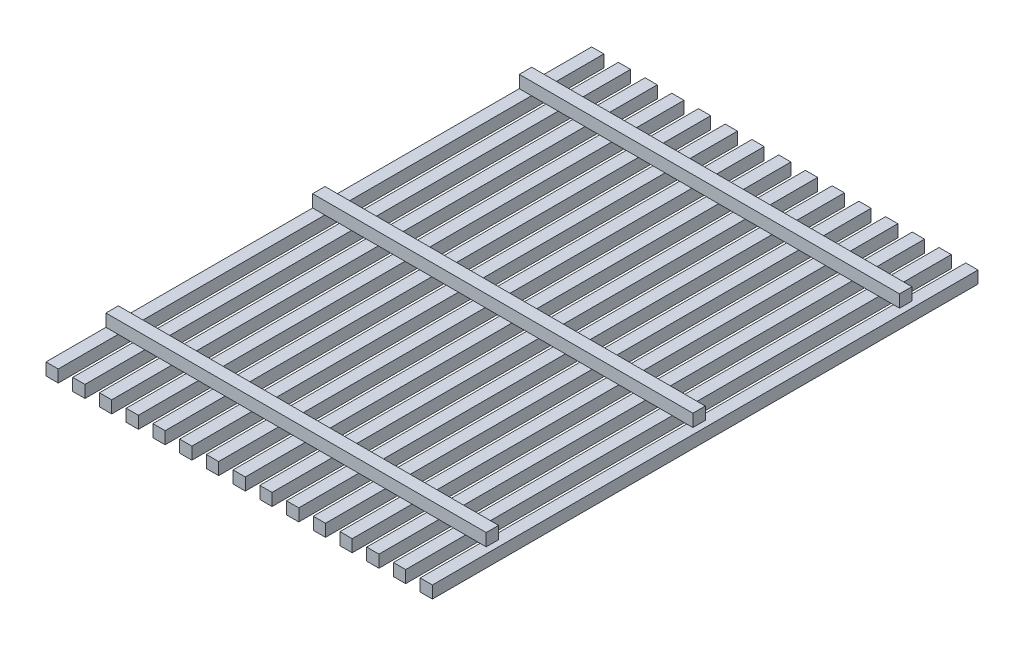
ISO-10303-21;
HEADER;
FILE_DESCRIPTION(('STEP AP214'),'2;1');
FILE_NAME('part.step','',(''),(''),'','','');
FILE_SCHEMA(('AUTOMOTIVE_DESIGN { 1 0 10303 214 1 1 1 1 }'));
ENDSEC;
DATA;
#1=APPLICATION_CONTEXT('core data for automotive mechanical design processes');
#2=APPLICATION_PROTOCOL_DEFINITION('international standard','automotive_design',2000,#1);
#3=PRODUCT_CONTEXT('',#1,'mechanical');
#4=PRODUCT('Part','Part','',(#3));
#5=PRODUCT_RELATED_PRODUCT_CATEGORY('part','',(#4));
#6=PRODUCT_DEFINITION_FORMATION('','',#4);
#7=PRODUCT_DEFINITION_CONTEXT('part definition',#1,'design');
#8=PRODUCT_DEFINITION('design','',#6,#7);
#9=PRODUCT_DEFINITION_SHAPE('','',#8);
#10=(LENGTH_UNIT() NAMED_UNIT(*) SI_UNIT(.MILLI.,.METRE.));
#11=(NAMED_UNIT(*) PLANE_ANGLE_UNIT() SI_UNIT($,.RADIAN.));
#12=(NAMED_UNIT(*) SI_UNIT($,.STERADIAN.) SOLID_ANGLE_UNIT());
#13=UNCERTAINTY_MEASURE_WITH_UNIT(LENGTH_MEASURE(1.E-05),#10,'distance_accuracy_value','');
#14=(GEOMETRIC_REPRESENTATION_CONTEXT(3) GLOBAL_UNCERTAINTY_ASSIGNED_CONTEXT((#13)) GLOBAL_UNIT_ASSIGNED_CONTEXT((#10,
#11,#12)) REPRESENTATION_CONTEXT('',''));
#15=CARTESIAN_POINT('',(0.,0.,0.));
#16=DIRECTION('',(0.,0.,1.));
#17=DIRECTION('',(1.,0.,0.));
#18=AXIS2_PLACEMENT_3D('',#15,#16,#17);
#19=CARTESIAN_POINT('',(-146.05,0.,-209.55));
#20=DIRECTION('',(0.,-1.,0.));
#21=DIRECTION('',(1.,0.,0.));
#22=AXIS2_PLACEMENT_3D('',#19,#20,#21);
#23=PLANE('',#22);
#24=DIRECTION('',(-1.,0.,0.));
#25=VECTOR('',#24,1.);
#26=CARTESIAN_POINT('',(146.05,0.,163.5125));
#27=LINE('',#26,#25);
#28=CARTESIAN_POINT('',(-136.652,0.,163.5125));
#29=VERTEX_POINT('',#28);
#30=CARTESIAN_POINT('',(-146.05,0.,163.5125));
#31=VERTEX_POINT('',#30);
#32=EDGE_CURVE('E1027',#29,#31,#27,.T.);
#33=ORIENTED_EDGE('',*,*,#32,.T.);
#34=DIRECTION('',(0.,0.,1.));
#35=VECTOR('',#34,1.);
#36=CARTESIAN_POINT('',(-146.05,0.,-209.55));
#37=LINE('',#36,#35);
#38=CARTESIAN_POINT('',(-146.05,0.,209.55));
#39=VERTEX_POINT('',#38);
#40=EDGE_CURVE('E44',#31,#39,#37,.T.);
#41=ORIENTED_EDGE('',*,*,#40,.T.);
#42=DIRECTION('',(1.,0.,0.));
#43=VECTOR('',#42,1.);
#44=CARTESIAN_POINT('',(-146.05,0.,209.55));
#45=LINE('',#44,#43);
#46=CARTESIAN_POINT('',(-136.652,0.,209.55));
#47=VERTEX_POINT('',#46);
#48=EDGE_CURVE('E2271',#39,#47,#45,.T.);
#49=ORIENTED_EDGE('',*,*,#48,.T.);
#50=DIRECTION('',(0.,0.,1.));
#51=VECTOR('',#50,1.);
#52=CARTESIAN_POINT('',(-136.652,0.,-209.55));
#53=LINE('',#52,#51);
#54=EDGE_CURVE('E2252',#29,#47,#53,.T.);
#55=ORIENTED_EDGE('',*,*,#54,.F.);
#56=EDGE_LOOP('',(#33,#41,#49,#55));
#57=FACE_BOUND('',#56,.T.);
#58=ADVANCED_FACE('F40',(#57),#23,.F.);
#59=DIRECTION('',(-1.,0.,0.));
#60=VECTOR('',#59,1.);
#61=CARTESIAN_POINT('',(146.05,0.,153.9875));
#62=LINE('',#61,#60);
#63=CARTESIAN_POINT('',(-136.652,0.,153.9875));
#64=VERTEX_POINT('',#63);
#65=CARTESIAN_POINT('',(-146.05,0.,153.9875));
#66=VERTEX_POINT('',#65);
#67=EDGE_CURVE('E1010',#64,#66,#62,.T.);
#68=ORIENTED_EDGE('',*,*,#67,.F.);
#69=CARTESIAN_POINT('',(-136.652,0.,4.76250000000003));
#70=VERTEX_POINT('',#69);
#71=EDGE_CURVE('E2059',#70,#64,#53,.T.);
#72=ORIENTED_EDGE('',*,*,#71,.F.);
#73=DIRECTION('',(-1.,0.,0.));
#74=VECTOR('',#73,1.);
#75=CARTESIAN_POINT('',(146.05,0.,4.76250000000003));
#76=LINE('',#75,#74);
#77=CARTESIAN_POINT('',(-146.05,0.,4.76250000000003));
#78=VERTEX_POINT('',#77);
#79=EDGE_CURVE('E1108',#70,#78,#76,.T.);
#80=ORIENTED_EDGE('',*,*,#79,.T.);
#81=EDGE_CURVE('E1737',#78,#66,#37,.T.);
#82=ORIENTED_EDGE('',*,*,#81,.T.);
#83=EDGE_LOOP('',(#68,#72,#80,#82));
#84=FACE_BOUND('',#83,.T.);
#85=ADVANCED_FACE('F2057',(#84),#23,.F.);
#86=CARTESIAN_POINT('',(-125.521357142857,0.,-209.55));
#87=DIRECTION('',(0.,-1.,0.));
#88=DIRECTION('',(1.,0.,0.));
#89=AXIS2_PLACEMENT_3D('',#86,#87,#88);
#90=PLANE('',#89);
#91=CARTESIAN_POINT('',(-116.123357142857,0.,163.5125));
#92=VERTEX_POINT('',#91);
#93=CARTESIAN_POINT('',(-125.521357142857,0.,163.5125));
#94=VERTEX_POINT('',#93);
#95=EDGE_CURVE('E3471',#92,#94,#27,.T.);
#96=ORIENTED_EDGE('',*,*,#95,.T.);
#97=DIRECTION('',(0.,0.,1.));
#98=VECTOR('',#97,1.);
#99=CARTESIAN_POINT('',(-125.521357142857,0.,-209.55));
#100=LINE('',#99,#98);
#101=CARTESIAN_POINT('',(-125.521357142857,0.,209.55));
#102=VERTEX_POINT('',#101);
#103=EDGE_CURVE('E1691',#94,#102,#100,.T.);
#104=ORIENTED_EDGE('',*,*,#103,.T.);
#105=DIRECTION('',(1.,0.,0.));
#106=VECTOR('',#105,1.);
#107=CARTESIAN_POINT('',(-125.521357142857,0.,209.55));
#108=LINE('',#107,#106);
#109=CARTESIAN_POINT('',(-116.123357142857,0.,209.55));
#110=VERTEX_POINT('',#109);
#111=EDGE_CURVE('E1676',#102,#110,#108,.T.);
#112=ORIENTED_EDGE('',*,*,#111,.T.);
#113=DIRECTION('',(0.,0.,1.));
#114=VECTOR('',#113,1.);
#115=CARTESIAN_POINT('',(-116.123357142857,0.,-209.55));
#116=LINE('',#115,#114);
#117=EDGE_CURVE('E1687',#92,#110,#116,.T.);
#118=ORIENTED_EDGE('',*,*,#117,.F.);
#119=EDGE_LOOP('',(#96,#104,#112,#118));
#120=FACE_BOUND('',#119,.T.);
#121=ADVANCED_FACE('F2216',(#120),#90,.F.);
#122=CARTESIAN_POINT('',(-116.123357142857,0.,153.9875));
#123=VERTEX_POINT('',#122);
#124=CARTESIAN_POINT('',(-125.521357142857,0.,153.9875));
#125=VERTEX_POINT('',#124);
#126=EDGE_CURVE('E2044',#123,#125,#62,.T.);
#127=ORIENTED_EDGE('',*,*,#126,.F.);
#128=CARTESIAN_POINT('',(-116.123357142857,0.,4.76250000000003));
#129=VERTEX_POINT('',#128);
#130=EDGE_CURVE('E3513',#129,#123,#116,.T.);
#131=ORIENTED_EDGE('',*,*,#130,.F.);
#132=CARTESIAN_POINT('',(-125.521357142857,0.,4.76250000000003));
#133=VERTEX_POINT('',#132);
#134=EDGE_CURVE('E2064',#129,#133,#76,.T.);
#135=ORIENTED_EDGE('',*,*,#134,.T.);
#136=EDGE_CURVE('E3525',#133,#125,#100,.T.);
#137=ORIENTED_EDGE('',*,*,#136,.T.);
#138=EDGE_LOOP('',(#127,#131,#135,#137));
#139=FACE_BOUND('',#138,.T.);
#140=ADVANCED_FACE('F2230',(#139),#90,.F.);
#141=CARTESIAN_POINT('',(-104.992714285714,0.,-209.55));
#142=DIRECTION('',(0.,-1.,0.));
#143=DIRECTION('',(1.,0.,0.));
#144=AXIS2_PLACEMENT_3D('',#141,#142,#143);
#145=PLANE('',#144);
#146=CARTESIAN_POINT('',(-95.5947142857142,0.,163.5125));
#147=VERTEX_POINT('',#146);
#148=CARTESIAN_POINT('',(-104.992714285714,0.,163.5125));
#149=VERTEX_POINT('',#148);
#150=EDGE_CURVE('E3463',#147,#149,#27,.T.);
#151=ORIENTED_EDGE('',*,*,#150,.T.);
#152=DIRECTION('',(0.,0.,1.));
#153=VECTOR('',#152,1.);
#154=CARTESIAN_POINT('',(-104.992714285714,0.,-209.55));
#155=LINE('',#154,#153);
#156=CARTESIAN_POINT('',(-104.992714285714,0.,209.55));
#157=VERTEX_POINT('',#156);
#158=EDGE_CURVE('E1653',#149,#157,#155,.T.);
#159=ORIENTED_EDGE('',*,*,#158,.T.);
#160=DIRECTION('',(1.,0.,0.));
#161=VECTOR('',#160,1.);
#162=CARTESIAN_POINT('',(-104.992714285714,0.,209.55));
#163=LINE('',#162,#161);
#164=CARTESIAN_POINT('',(-95.5947142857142,0.,209.55));
#165=VERTEX_POINT('',#164);
#166=EDGE_CURVE('E1638',#157,#165,#163,.T.);
#167=ORIENTED_EDGE('',*,*,#166,.T.);
#168=DIRECTION('',(0.,0.,1.));
#169=VECTOR('',#168,1.);
#170=CARTESIAN_POINT('',(-95.5947142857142,0.,-209.55));
#171=LINE('',#170,#169);
#172=EDGE_CURVE('E1649',#147,#165,#171,.T.);
#173=ORIENTED_EDGE('',*,*,#172,.F.);
#174=EDGE_LOOP('',(#151,#159,#167,#173));
#175=FACE_BOUND('',#174,.T.);
#176=ADVANCED_FACE('F2699',(#175),#145,.F.);
#177=CARTESIAN_POINT('',(-95.5947142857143,0.,153.9875));
#178=VERTEX_POINT('',#177);
#179=CARTESIAN_POINT('',(-104.992714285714,0.,153.9875));
#180=VERTEX_POINT('',#179);
#181=EDGE_CURVE('E2038',#178,#180,#62,.T.);
#182=ORIENTED_EDGE('',*,*,#181,.F.);
#183=CARTESIAN_POINT('',(-95.5947142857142,0.,4.76250000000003));
#184=VERTEX_POINT('',#183);
#185=EDGE_CURVE('E3544',#184,#178,#171,.T.);
#186=ORIENTED_EDGE('',*,*,#185,.F.);
#187=CARTESIAN_POINT('',(-104.992714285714,0.,4.76250000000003));
#188=VERTEX_POINT('',#187);
#189=EDGE_CURVE('E2073',#184,#188,#76,.T.);
#190=ORIENTED_EDGE('',*,*,#189,.T.);
#191=EDGE_CURVE('E3530',#188,#180,#155,.T.);
#192=ORIENTED_EDGE('',*,*,#191,.T.);
#193=EDGE_LOOP('',(#182,#186,#190,#192));
#194=FACE_BOUND('',#193,.T.);
#195=ADVANCED_FACE('F3650',(#194),#145,.F.);
#196=CARTESIAN_POINT('',(-84.4640714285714,0.,-209.55));
#197=DIRECTION('',(0.,-1.,0.));
#198=DIRECTION('',(1.,0.,0.));
#199=AXIS2_PLACEMENT_3D('',#196,#197,#198);
#200=PLANE('',#199);
#201=CARTESIAN_POINT('',(-75.0660714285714,0.,163.5125));
#202=VERTEX_POINT('',#201);
#203=CARTESIAN_POINT('',(-84.4640714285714,0.,163.5125));
#204=VERTEX_POINT('',#203);
#205=EDGE_CURVE('E3455',#202,#204,#27,.T.);
#206=ORIENTED_EDGE('',*,*,#205,.T.);
#207=DIRECTION('',(0.,0.,1.));
#208=VECTOR('',#207,1.);
#209=CARTESIAN_POINT('',(-84.4640714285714,0.,-209.55));
#210=LINE('',#209,#208);
#211=CARTESIAN_POINT('',(-84.4640714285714,0.,209.55));
#212=VERTEX_POINT('',#211);
#213=EDGE_CURVE('E1615',#204,#212,#210,.T.);
#214=ORIENTED_EDGE('',*,*,#213,.T.);
#215=DIRECTION('',(1.,0.,0.));
#216=VECTOR('',#215,1.);
#217=CARTESIAN_POINT('',(-84.4640714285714,0.,209.55));
#218=LINE('',#217,#216);
#219=CARTESIAN_POINT('',(-75.0660714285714,0.,209.55));
#220=VERTEX_POINT('',#219);
#221=EDGE_CURVE('E1600',#212,#220,#218,.T.);
#222=ORIENTED_EDGE('',*,*,#221,.T.);
#223=DIRECTION('',(0.,0.,1.));
#224=VECTOR('',#223,1.);
#225=CARTESIAN_POINT('',(-75.0660714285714,0.,-209.55));
#226=LINE('',#225,#224);
#227=EDGE_CURVE('E1611',#202,#220,#226,.T.);
#228=ORIENTED_EDGE('',*,*,#227,.F.);
#229=EDGE_LOOP('',(#206,#214,#222,#228));
#230=FACE_BOUND('',#229,.T.);
#231=ADVANCED_FACE('F2673',(#230),#200,.F.);
#232=CARTESIAN_POINT('',(-75.0660714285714,0.,153.9875));
#233=VERTEX_POINT('',#232);
#234=CARTESIAN_POINT('',(-84.4640714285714,0.,153.9875));
#235=VERTEX_POINT('',#234);
#236=EDGE_CURVE('E2032',#233,#235,#62,.T.);
#237=ORIENTED_EDGE('',*,*,#236,.F.);
#238=CARTESIAN_POINT('',(-75.0660714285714,0.,4.76250000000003));
#239=VERTEX_POINT('',#238);
#240=EDGE_CURVE('E3641',#239,#233,#226,.T.);
#241=ORIENTED_EDGE('',*,*,#240,.F.);
#242=CARTESIAN_POINT('',(-84.4640714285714,0.,4.76250000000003));
#243=VERTEX_POINT('',#242);
#244=EDGE_CURVE('E2083',#239,#243,#76,.T.);
#245=ORIENTED_EDGE('',*,*,#244,.T.);
#246=EDGE_CURVE('E3565',#243,#235,#210,.T.);
#247=ORIENTED_EDGE('',*,*,#246,.T.);
#248=EDGE_LOOP('',(#237,#241,#245,#247));
#249=FACE_BOUND('',#248,.T.);
#250=ADVANCED_FACE('F3635',(#249),#200,.F.);
#251=CARTESIAN_POINT('',(-63.9354285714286,0.,-209.55));
#252=DIRECTION('',(0.,-1.,0.));
#253=DIRECTION('',(1.,0.,0.));
#254=AXIS2_PLACEMENT_3D('',#251,#252,#253);
#255=PLANE('',#254);
#256=CARTESIAN_POINT('',(-54.5374285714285,0.,163.5125));
#257=VERTEX_POINT('',#256);
#258=CARTESIAN_POINT('',(-63.9354285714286,0.,163.5125));
#259=VERTEX_POINT('',#258);
#260=EDGE_CURVE('E3447',#257,#259,#27,.T.);
#261=ORIENTED_EDGE('',*,*,#260,.T.);
#262=DIRECTION('',(0.,0.,1.));
#263=VECTOR('',#262,1.);
#264=CARTESIAN_POINT('',(-63.9354285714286,0.,-209.55));
#265=LINE('',#264,#263);
#266=CARTESIAN_POINT('',(-63.9354285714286,0.,209.55));
#267=VERTEX_POINT('',#266);
#268=EDGE_CURVE('E1577',#259,#267,#265,.T.);
#269=ORIENTED_EDGE('',*,*,#268,.T.);
#270=DIRECTION('',(1.,0.,0.));
#271=VECTOR('',#270,1.);
#272=CARTESIAN_POINT('',(-63.9354285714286,0.,209.55));
#273=LINE('',#272,#271);
#274=CARTESIAN_POINT('',(-54.5374285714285,0.,209.55));
#275=VERTEX_POINT('',#274);
#276=EDGE_CURVE('E1562',#267,#275,#273,.T.);
#277=ORIENTED_EDGE('',*,*,#276,.T.);
#278=DIRECTION('',(0.,0.,1.));
#279=VECTOR('',#278,1.);
#280=CARTESIAN_POINT('',(-54.5374285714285,0.,-209.55));
#281=LINE('',#280,#279);
#282=EDGE_CURVE('E1573',#257,#275,#281,.T.);
#283=ORIENTED_EDGE('',*,*,#282,.F.);
#284=EDGE_LOOP('',(#261,#269,#277,#283));
#285=FACE_BOUND('',#284,.T.);
#286=ADVANCED_FACE('F2647',(#285),#255,.F.);
#287=CARTESIAN_POINT('',(-54.5374285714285,0.,153.9875));
#288=VERTEX_POINT('',#287);
#289=CARTESIAN_POINT('',(-63.9354285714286,0.,153.9875));
#290=VERTEX_POINT('',#289);
#291=EDGE_CURVE('E2026',#288,#290,#62,.T.);
#292=ORIENTED_EDGE('',*,*,#291,.F.);
#293=CARTESIAN_POINT('',(-54.5374285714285,0.,4.76250000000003));
#294=VERTEX_POINT('',#293);
#295=EDGE_CURVE('E3587',#294,#288,#281,.T.);
#296=ORIENTED_EDGE('',*,*,#295,.F.);
#297=CARTESIAN_POINT('',(-63.9354285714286,0.,4.76250000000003));
#298=VERTEX_POINT('',#297);
#299=EDGE_CURVE('E2093',#294,#298,#76,.T.);
#300=ORIENTED_EDGE('',*,*,#299,.T.);
#301=EDGE_CURVE('E3575',#298,#290,#265,.T.);
#302=ORIENTED_EDGE('',*,*,#301,.T.);
#303=EDGE_LOOP('',(#292,#296,#300,#302));
#304=FACE_BOUND('',#303,.T.);
#305=ADVANCED_FACE('F3625',(#304),#255,.F.);
#306=CARTESIAN_POINT('',(-43.4067857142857,0.,-209.55));
#307=DIRECTION('',(0.,-1.,0.));
#308=DIRECTION('',(1.,0.,0.));
#309=AXIS2_PLACEMENT_3D('',#306,#307,#308);
#310=PLANE('',#309);
#311=CARTESIAN_POINT('',(-34.0087857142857,0.,163.5125));
#312=VERTEX_POINT('',#311);
#313=CARTESIAN_POINT('',(-43.4067857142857,0.,163.5125));
#314=VERTEX_POINT('',#313);
#315=EDGE_CURVE('E3439',#312,#314,#27,.T.);
#316=ORIENTED_EDGE('',*,*,#315,.T.);
#317=DIRECTION('',(0.,0.,1.));
#318=VECTOR('',#317,1.);
#319=CARTESIAN_POINT('',(-43.4067857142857,0.,-209.55));
#320=LINE('',#319,#318);
#321=CARTESIAN_POINT('',(-43.4067857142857,0.,209.55));
#322=VERTEX_POINT('',#321);
#323=EDGE_CURVE('E1539',#314,#322,#320,.T.);
#324=ORIENTED_EDGE('',*,*,#323,.T.);
#325=DIRECTION('',(1.,0.,0.));
#326=VECTOR('',#325,1.);
#327=CARTESIAN_POINT('',(-43.4067857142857,0.,209.55));
#328=LINE('',#327,#326);
#329=CARTESIAN_POINT('',(-34.0087857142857,0.,209.55));
#330=VERTEX_POINT('',#329);
#331=EDGE_CURVE('E1524',#322,#330,#328,.T.);
#332=ORIENTED_EDGE('',*,*,#331,.T.);
#333=DIRECTION('',(0.,0.,1.));
#334=VECTOR('',#333,1.);
#335=CARTESIAN_POINT('',(-34.0087857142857,0.,-209.55));
#336=LINE('',#335,#334);
#337=EDGE_CURVE('E1535',#312,#330,#336,.T.);
#338=ORIENTED_EDGE('',*,*,#337,.F.);
#339=EDGE_LOOP('',(#316,#324,#332,#338));
#340=FACE_BOUND('',#339,.T.);
#341=ADVANCED_FACE('F2621',(#340),#310,.F.);
#342=CARTESIAN_POINT('',(-34.0087857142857,0.,153.9875));
#343=VERTEX_POINT('',#342);
#344=CARTESIAN_POINT('',(-43.4067857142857,0.,153.9875));
#345=VERTEX_POINT('',#344);
#346=EDGE_CURVE('E2020',#343,#345,#62,.T.);
#347=ORIENTED_EDGE('',*,*,#346,.F.);
#348=CARTESIAN_POINT('',(-34.0087857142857,0.,4.76250000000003));
#349=VERTEX_POINT('',#348);
#350=EDGE_CURVE('E3601',#349,#343,#336,.T.);
#351=ORIENTED_EDGE('',*,*,#350,.F.);
#352=CARTESIAN_POINT('',(-43.4067857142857,0.,4.76250000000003));
#353=VERTEX_POINT('',#352);
#354=EDGE_CURVE('E2103',#349,#353,#76,.T.);
#355=ORIENTED_EDGE('',*,*,#354,.T.);
#356=EDGE_CURVE('E3608',#353,#345,#320,.T.);
#357=ORIENTED_EDGE('',*,*,#356,.T.);
#358=EDGE_LOOP('',(#347,#351,#355,#357));
#359=FACE_BOUND('',#358,.T.);
#360=ADVANCED_FACE('F3618',(#359),#310,.F.);
#361=CARTESIAN_POINT('',(-22.8781428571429,0.,-209.55));
#362=DIRECTION('',(0.,-1.,0.));
#363=DIRECTION('',(1.,0.,0.));
#364=AXIS2_PLACEMENT_3D('',#361,#362,#363);
#365=PLANE('',#364);
#366=CARTESIAN_POINT('',(-13.4801428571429,0.,163.5125));
#367=VERTEX_POINT('',#366);
#368=CARTESIAN_POINT('',(-22.8781428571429,0.,163.5125));
#369=VERTEX_POINT('',#368);
#370=EDGE_CURVE('E3431',#367,#369,#27,.T.);
#371=ORIENTED_EDGE('',*,*,#370,.T.);
#372=DIRECTION('',(0.,0.,1.));
#373=VECTOR('',#372,1.);
#374=CARTESIAN_POINT('',(-22.8781428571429,0.,-209.55));
#375=LINE('',#374,#373);
#376=CARTESIAN_POINT('',(-22.8781428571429,0.,209.55));
#377=VERTEX_POINT('',#376);
#378=EDGE_CURVE('E1501',#369,#377,#375,.T.);
#379=ORIENTED_EDGE('',*,*,#378,.T.);
#380=DIRECTION('',(1.,0.,0.));
#381=VECTOR('',#380,1.);
#382=CARTESIAN_POINT('',(-22.8781428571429,0.,209.55));
#383=LINE('',#382,#381);
#384=CARTESIAN_POINT('',(-13.4801428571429,0.,209.55));
#385=VERTEX_POINT('',#384);
#386=EDGE_CURVE('E1486',#377,#385,#383,.T.);
#387=ORIENTED_EDGE('',*,*,#386,.T.);
#388=DIRECTION('',(0.,0.,1.));
#389=VECTOR('',#388,1.);
#390=CARTESIAN_POINT('',(-13.4801428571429,0.,-209.55));
#391=LINE('',#390,#389);
#392=EDGE_CURVE('E1497',#367,#385,#391,.T.);
#393=ORIENTED_EDGE('',*,*,#392,.F.);
#394=EDGE_LOOP('',(#371,#379,#387,#393));
#395=FACE_BOUND('',#394,.T.);
#396=ADVANCED_FACE('F2595',(#395),#365,.F.);
#397=CARTESIAN_POINT('',(-13.4801428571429,0.,153.9875));
#398=VERTEX_POINT('',#397);
#399=CARTESIAN_POINT('',(-22.8781428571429,0.,153.9875));
#400=VERTEX_POINT('',#399);
#401=EDGE_CURVE('E2014',#398,#400,#62,.T.);
#402=ORIENTED_EDGE('',*,*,#401,.F.);
#403=CARTESIAN_POINT('',(-13.4801428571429,0.,4.76250000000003));
#404=VERTEX_POINT('',#403);
#405=EDGE_CURVE('E3830',#404,#398,#391,.T.);
#406=ORIENTED_EDGE('',*,*,#405,.F.);
#407=CARTESIAN_POINT('',(-22.8781428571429,0.,4.76250000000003));
#408=VERTEX_POINT('',#407);
#409=EDGE_CURVE('E2113',#404,#408,#76,.T.);
#410=ORIENTED_EDGE('',*,*,#409,.T.);
#411=EDGE_CURVE('E3837',#408,#400,#375,.T.);
#412=ORIENTED_EDGE('',*,*,#411,.T.);
#413=EDGE_LOOP('',(#402,#406,#410,#412));
#414=FACE_BOUND('',#413,.T.);
#415=ADVANCED_FACE('F3624',(#414),#365,.F.);
#416=CARTESIAN_POINT('',(-2.34950000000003,0.,-209.55));
#417=DIRECTION('',(0.,-1.,0.));
#418=DIRECTION('',(1.,0.,0.));
#419=AXIS2_PLACEMENT_3D('',#416,#417,#418);
#420=PLANE('',#419);
#421=CARTESIAN_POINT('',(7.04850000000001,0.,163.5125));
#422=VERTEX_POINT('',#421);
#423=CARTESIAN_POINT('',(-2.34950000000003,0.,163.5125));
#424=VERTEX_POINT('',#423);
#425=EDGE_CURVE('E3423',#422,#424,#27,.T.);
#426=ORIENTED_EDGE('',*,*,#425,.T.);
#427=DIRECTION('',(0.,0.,1.));
#428=VECTOR('',#427,1.);
#429=CARTESIAN_POINT('',(-2.34950000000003,0.,-209.55));
#430=LINE('',#429,#428);
#431=CARTESIAN_POINT('',(-2.34950000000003,0.,209.55));
#432=VERTEX_POINT('',#431);
#433=EDGE_CURVE('E1463',#424,#432,#430,.T.);
#434=ORIENTED_EDGE('',*,*,#433,.T.);
#435=DIRECTION('',(1.,0.,0.));
#436=VECTOR('',#435,1.);
#437=CARTESIAN_POINT('',(-2.34950000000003,0.,209.55));
#438=LINE('',#437,#436);
#439=CARTESIAN_POINT('',(7.04850000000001,0.,209.55));
#440=VERTEX_POINT('',#439);
#441=EDGE_CURVE('E1448',#432,#440,#438,.T.);
#442=ORIENTED_EDGE('',*,*,#441,.T.);
#443=DIRECTION('',(0.,0.,1.));
#444=VECTOR('',#443,1.);
#445=CARTESIAN_POINT('',(7.04850000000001,0.,-209.55));
#446=LINE('',#445,#444);
#447=EDGE_CURVE('E1459',#422,#440,#446,.T.);
#448=ORIENTED_EDGE('',*,*,#447,.F.);
#449=EDGE_LOOP('',(#426,#434,#442,#448));
#450=FACE_BOUND('',#449,.T.);
#451=ADVANCED_FACE('F2569',(#450),#420,.F.);
#452=CARTESIAN_POINT('',(7.04850000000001,0.,153.9875));
#453=VERTEX_POINT('',#452);
#454=CARTESIAN_POINT('',(-2.34950000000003,0.,153.9875));
#455=VERTEX_POINT('',#454);
#456=EDGE_CURVE('E2008',#453,#455,#62,.T.);
#457=ORIENTED_EDGE('',*,*,#456,.F.);
#458=CARTESIAN_POINT('',(7.04850000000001,0.,4.76250000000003));
#459=VERTEX_POINT('',#458);
#460=EDGE_CURVE('E3815',#459,#453,#446,.T.);
#461=ORIENTED_EDGE('',*,*,#460,.F.);
#462=CARTESIAN_POINT('',(-2.34950000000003,0.,4.76250000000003));
#463=VERTEX_POINT('',#462);
#464=EDGE_CURVE('E2123',#459,#463,#76,.T.);
#465=ORIENTED_EDGE('',*,*,#464,.T.);
#466=EDGE_CURVE('E3803',#463,#455,#430,.T.);
#467=ORIENTED_EDGE('',*,*,#466,.T.);
#468=EDGE_LOOP('',(#457,#461,#465,#467));
#469=FACE_BOUND('',#468,.T.);
#470=ADVANCED_FACE('F3681',(#469),#420,.F.);
#471=CARTESIAN_POINT('',(18.1791428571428,0.,-209.55));
#472=DIRECTION('',(0.,-1.,0.));
#473=DIRECTION('',(1.,0.,0.));
#474=AXIS2_PLACEMENT_3D('',#471,#472,#473);
#475=PLANE('',#474);
#476=CARTESIAN_POINT('',(27.5771428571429,0.,163.5125));
#477=VERTEX_POINT('',#476);
#478=CARTESIAN_POINT('',(18.1791428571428,0.,163.5125));
#479=VERTEX_POINT('',#478);
#480=EDGE_CURVE('E3416',#477,#479,#27,.T.);
#481=ORIENTED_EDGE('',*,*,#480,.T.);
#482=DIRECTION('',(0.,0.,1.));
#483=VECTOR('',#482,1.);
#484=CARTESIAN_POINT('',(18.1791428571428,0.,-209.55));
#485=LINE('',#484,#483);
#486=CARTESIAN_POINT('',(18.1791428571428,0.,209.55));
#487=VERTEX_POINT('',#486);
#488=EDGE_CURVE('E1425',#479,#487,#485,.T.);
#489=ORIENTED_EDGE('',*,*,#488,.T.);
#490=DIRECTION('',(1.,0.,0.));
#491=VECTOR('',#490,1.);
#492=CARTESIAN_POINT('',(18.1791428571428,0.,209.55));
#493=LINE('',#492,#491);
#494=CARTESIAN_POINT('',(27.5771428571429,0.,209.55));
#495=VERTEX_POINT('',#494);
#496=EDGE_CURVE('E1410',#487,#495,#493,.T.);
#497=ORIENTED_EDGE('',*,*,#496,.T.);
#498=DIRECTION('',(0.,0.,1.));
#499=VECTOR('',#498,1.);
#500=CARTESIAN_POINT('',(27.5771428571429,0.,-209.55));
#501=LINE('',#500,#499);
#502=EDGE_CURVE('E1421',#477,#495,#501,.T.);
#503=ORIENTED_EDGE('',*,*,#502,.F.);
#504=EDGE_LOOP('',(#481,#489,#497,#503));
#505=FACE_BOUND('',#504,.T.);
#506=ADVANCED_FACE('F2543',(#505),#475,.F.);
#507=CARTESIAN_POINT('',(27.5771428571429,0.,153.9875));
#508=VERTEX_POINT('',#507);
#509=CARTESIAN_POINT('',(18.1791428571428,0.,153.9875));
#510=VERTEX_POINT('',#509);
#511=EDGE_CURVE('E2002',#508,#510,#62,.T.);
#512=ORIENTED_EDGE('',*,*,#511,.F.);
#513=CARTESIAN_POINT('',(27.5771428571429,0.,4.76250000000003));
#514=VERTEX_POINT('',#513);
#515=EDGE_CURVE('E3858',#514,#508,#501,.T.);
#516=ORIENTED_EDGE('',*,*,#515,.F.);
#517=CARTESIAN_POINT('',(18.1791428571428,0.,4.76250000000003));
#518=VERTEX_POINT('',#517);
#519=EDGE_CURVE('E2133',#514,#518,#76,.T.);
#520=ORIENTED_EDGE('',*,*,#519,.T.);
#521=EDGE_CURVE('E3896',#518,#510,#485,.T.);
#522=ORIENTED_EDGE('',*,*,#521,.T.);
#523=EDGE_LOOP('',(#512,#516,#520,#522));
#524=FACE_BOUND('',#523,.T.);
#525=ADVANCED_FACE('F3687',(#524),#475,.F.);
#526=CARTESIAN_POINT('',(38.7077857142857,0.,-209.55));
#527=DIRECTION('',(0.,-1.,0.));
#528=DIRECTION('',(1.,0.,0.));
#529=AXIS2_PLACEMENT_3D('',#526,#527,#528);
#530=PLANE('',#529);
#531=CARTESIAN_POINT('',(48.1057857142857,0.,163.5125));
#532=VERTEX_POINT('',#531);
#533=CARTESIAN_POINT('',(38.7077857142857,0.,163.5125));
#534=VERTEX_POINT('',#533);
#535=EDGE_CURVE('E3411',#532,#534,#27,.T.);
#536=ORIENTED_EDGE('',*,*,#535,.T.);
#537=DIRECTION('',(0.,0.,1.));
#538=VECTOR('',#537,1.);
#539=CARTESIAN_POINT('',(38.7077857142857,0.,-209.55));
#540=LINE('',#539,#538);
#541=CARTESIAN_POINT('',(38.7077857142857,0.,209.55));
#542=VERTEX_POINT('',#541);
#543=EDGE_CURVE('E1387',#534,#542,#540,.T.);
#544=ORIENTED_EDGE('',*,*,#543,.T.);
#545=DIRECTION('',(1.,0.,0.));
#546=VECTOR('',#545,1.);
#547=CARTESIAN_POINT('',(38.7077857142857,0.,209.55));
#548=LINE('',#547,#546);
#549=CARTESIAN_POINT('',(48.1057857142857,0.,209.55));
#550=VERTEX_POINT('',#549);
#551=EDGE_CURVE('E1372',#542,#550,#548,.T.);
#552=ORIENTED_EDGE('',*,*,#551,.T.);
#553=DIRECTION('',(0.,0.,1.));
#554=VECTOR('',#553,1.);
#555=CARTESIAN_POINT('',(48.1057857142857,0.,-209.55));
#556=LINE('',#555,#554);
#557=EDGE_CURVE('E1383',#532,#550,#556,.T.);
#558=ORIENTED_EDGE('',*,*,#557,.F.);
#559=EDGE_LOOP('',(#536,#544,#552,#558));
#560=FACE_BOUND('',#559,.T.);
#561=ADVANCED_FACE('F2517',(#560),#530,.F.);
#562=CARTESIAN_POINT('',(48.1057857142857,0.,153.9875));
#563=VERTEX_POINT('',#562);
#564=CARTESIAN_POINT('',(38.7077857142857,0.,153.9875));
#565=VERTEX_POINT('',#564);
#566=EDGE_CURVE('E1996',#563,#565,#62,.T.);
#567=ORIENTED_EDGE('',*,*,#566,.F.);
#568=CARTESIAN_POINT('',(48.1057857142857,0.,4.76250000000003));
#569=VERTEX_POINT('',#568);
#570=EDGE_CURVE('E3883',#569,#563,#556,.T.);
#571=ORIENTED_EDGE('',*,*,#570,.F.);
#572=CARTESIAN_POINT('',(38.7077857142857,0.,4.76250000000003));
#573=VERTEX_POINT('',#572);
#574=EDGE_CURVE('E2143',#569,#573,#76,.T.);
#575=ORIENTED_EDGE('',*,*,#574,.T.);
#576=EDGE_CURVE('E3868',#573,#565,#540,.T.);
#577=ORIENTED_EDGE('',*,*,#576,.T.);
#578=EDGE_LOOP('',(#567,#571,#575,#577));
#579=FACE_BOUND('',#578,.T.);
#580=ADVANCED_FACE('F3694',(#579),#530,.F.);
#581=CARTESIAN_POINT('',(59.2364285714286,0.,-209.55));
#582=DIRECTION('',(0.,-1.,0.));
#583=DIRECTION('',(1.,0.,0.));
#584=AXIS2_PLACEMENT_3D('',#581,#582,#583);
#585=PLANE('',#584);
#586=CARTESIAN_POINT('',(68.6344285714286,0.,163.5125));
#587=VERTEX_POINT('',#586);
#588=CARTESIAN_POINT('',(59.2364285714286,0.,163.5125));
#589=VERTEX_POINT('',#588);
#590=EDGE_CURVE('E3400',#587,#589,#27,.T.);
#591=ORIENTED_EDGE('',*,*,#590,.T.);
#592=DIRECTION('',(0.,0.,1.));
#593=VECTOR('',#592,1.);
#594=CARTESIAN_POINT('',(59.2364285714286,0.,-209.55));
#595=LINE('',#594,#593);
#596=CARTESIAN_POINT('',(59.2364285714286,0.,209.55));
#597=VERTEX_POINT('',#596);
#598=EDGE_CURVE('E1349',#589,#597,#595,.T.);
#599=ORIENTED_EDGE('',*,*,#598,.T.);
#600=DIRECTION('',(1.,0.,0.));
#601=VECTOR('',#600,1.);
#602=CARTESIAN_POINT('',(59.2364285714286,0.,209.55));
#603=LINE('',#602,#601);
#604=CARTESIAN_POINT('',(68.6344285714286,0.,209.55));
#605=VERTEX_POINT('',#604);
#606=EDGE_CURVE('E1334',#597,#605,#603,.T.);
#607=ORIENTED_EDGE('',*,*,#606,.T.);
#608=DIRECTION('',(0.,0.,1.));
#609=VECTOR('',#608,1.);
#610=CARTESIAN_POINT('',(68.6344285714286,0.,-209.55));
#611=LINE('',#610,#609);
#612=EDGE_CURVE('E1345',#587,#605,#611,.T.);
#613=ORIENTED_EDGE('',*,*,#612,.F.);
#614=EDGE_LOOP('',(#591,#599,#607,#613));
#615=FACE_BOUND('',#614,.T.);
#616=ADVANCED_FACE('F2491',(#615),#585,.F.);
#617=CARTESIAN_POINT('',(68.6344285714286,0.,153.9875));
#618=VERTEX_POINT('',#617);
#619=CARTESIAN_POINT('',(59.2364285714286,0.,153.9875));
#620=VERTEX_POINT('',#619);
#621=EDGE_CURVE('E1990',#618,#620,#62,.T.);
#622=ORIENTED_EDGE('',*,*,#621,.F.);
#623=CARTESIAN_POINT('',(68.6344285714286,0.,4.76250000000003));
#624=VERTEX_POINT('',#623);
#625=EDGE_CURVE('E3381',#624,#618,#611,.T.);
#626=ORIENTED_EDGE('',*,*,#625,.F.);
#627=CARTESIAN_POINT('',(59.2364285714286,0.,4.76250000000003));
#628=VERTEX_POINT('',#627);
#629=EDGE_CURVE('E2153',#624,#628,#76,.T.);
#630=ORIENTED_EDGE('',*,*,#629,.T.);
#631=EDGE_CURVE('E3394',#628,#620,#595,.T.);
#632=ORIENTED_EDGE('',*,*,#631,.T.);
#633=EDGE_LOOP('',(#622,#626,#630,#632));
#634=FACE_BOUND('',#633,.T.);
#635=ADVANCED_FACE('F3700',(#634),#585,.F.);
#636=CARTESIAN_POINT('',(79.7650714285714,0.,-209.55));
#637=DIRECTION('',(0.,-1.,0.));
#638=DIRECTION('',(1.,0.,0.));
#639=AXIS2_PLACEMENT_3D('',#636,#637,#638);
#640=PLANE('',#639);
#641=CARTESIAN_POINT('',(89.1630714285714,0.,163.5125));
#642=VERTEX_POINT('',#641);
#643=CARTESIAN_POINT('',(79.7650714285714,0.,163.5125));
#644=VERTEX_POINT('',#643);
#645=EDGE_CURVE('E3343',#642,#644,#27,.T.);
#646=ORIENTED_EDGE('',*,*,#645,.T.);
#647=DIRECTION('',(0.,0.,1.));
#648=VECTOR('',#647,1.);
#649=CARTESIAN_POINT('',(79.7650714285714,0.,-209.55));
#650=LINE('',#649,#648);
#651=CARTESIAN_POINT('',(79.7650714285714,0.,209.55));
#652=VERTEX_POINT('',#651);
#653=EDGE_CURVE('E1311',#644,#652,#650,.T.);
#654=ORIENTED_EDGE('',*,*,#653,.T.);
#655=DIRECTION('',(1.,0.,0.));
#656=VECTOR('',#655,1.);
#657=CARTESIAN_POINT('',(79.7650714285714,0.,209.55));
#658=LINE('',#657,#656);
#659=CARTESIAN_POINT('',(89.1630714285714,0.,209.55));
#660=VERTEX_POINT('',#659);
#661=EDGE_CURVE('E1296',#652,#660,#658,.T.);
#662=ORIENTED_EDGE('',*,*,#661,.T.);
#663=DIRECTION('',(0.,0.,1.));
#664=VECTOR('',#663,1.);
#665=CARTESIAN_POINT('',(89.1630714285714,0.,-209.55));
#666=LINE('',#665,#664);
#667=EDGE_CURVE('E1307',#642,#660,#666,.T.);
#668=ORIENTED_EDGE('',*,*,#667,.F.);
#669=EDGE_LOOP('',(#646,#654,#662,#668));
#670=FACE_BOUND('',#669,.T.);
#671=ADVANCED_FACE('F2465',(#670),#640,.F.);
#672=CARTESIAN_POINT('',(89.1630714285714,0.,153.9875));
#673=VERTEX_POINT('',#672);
#674=CARTESIAN_POINT('',(79.7650714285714,0.,153.9875));
#675=VERTEX_POINT('',#674);
#676=EDGE_CURVE('E1984',#673,#675,#62,.T.);
#677=ORIENTED_EDGE('',*,*,#676,.F.);
#678=CARTESIAN_POINT('',(89.1630714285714,0.,4.76250000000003));
#679=VERTEX_POINT('',#678);
#680=EDGE_CURVE('E3353',#679,#673,#666,.T.);
#681=ORIENTED_EDGE('',*,*,#680,.F.);
#682=CARTESIAN_POINT('',(79.7650714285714,0.,4.76250000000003));
#683=VERTEX_POINT('',#682);
#684=EDGE_CURVE('E2163',#679,#683,#76,.T.);
#685=ORIENTED_EDGE('',*,*,#684,.T.);
#686=EDGE_CURVE('E3371',#683,#675,#650,.T.);
#687=ORIENTED_EDGE('',*,*,#686,.T.);
#688=EDGE_LOOP('',(#677,#681,#685,#687));
#689=FACE_BOUND('',#688,.T.);
#690=ADVANCED_FACE('F3706',(#689),#640,.F.);
#691=CARTESIAN_POINT('',(100.293714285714,0.,-209.55));
#692=DIRECTION('',(0.,-1.,0.));
#693=DIRECTION('',(1.,0.,0.));
#694=AXIS2_PLACEMENT_3D('',#691,#692,#693);
#695=PLANE('',#694);
#696=CARTESIAN_POINT('',(109.691714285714,0.,163.5125));
#697=VERTEX_POINT('',#696);
#698=CARTESIAN_POINT('',(100.293714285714,0.,163.5125));
#699=VERTEX_POINT('',#698);
#700=EDGE_CURVE('E1937',#697,#699,#27,.T.);
#701=ORIENTED_EDGE('',*,*,#700,.T.);
#702=DIRECTION('',(0.,0.,1.));
#703=VECTOR('',#702,1.);
#704=CARTESIAN_POINT('',(100.293714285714,0.,-209.55));
#705=LINE('',#704,#703);
#706=CARTESIAN_POINT('',(100.293714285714,0.,209.55));
#707=VERTEX_POINT('',#706);
#708=EDGE_CURVE('E1273',#699,#707,#705,.T.);
#709=ORIENTED_EDGE('',*,*,#708,.T.);
#710=DIRECTION('',(1.,0.,0.));
#711=VECTOR('',#710,1.);
#712=CARTESIAN_POINT('',(100.293714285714,0.,209.55));
#713=LINE('',#712,#711);
#714=CARTESIAN_POINT('',(109.691714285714,0.,209.55));
#715=VERTEX_POINT('',#714);
#716=EDGE_CURVE('E1258',#707,#715,#713,.T.);
#717=ORIENTED_EDGE('',*,*,#716,.T.);
#718=DIRECTION('',(0.,0.,1.));
#719=VECTOR('',#718,1.);
#720=CARTESIAN_POINT('',(109.691714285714,0.,-209.55));
#721=LINE('',#720,#719);
#722=EDGE_CURVE('E1269',#697,#715,#721,.T.);
#723=ORIENTED_EDGE('',*,*,#722,.F.);
#724=EDGE_LOOP('',(#701,#709,#717,#723));
#725=FACE_BOUND('',#724,.T.);
#726=ADVANCED_FACE('F2414',(#725),#695,.F.);
#727=CARTESIAN_POINT('',(109.691714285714,0.,153.9875));
#728=VERTEX_POINT('',#727);
#729=CARTESIAN_POINT('',(100.293714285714,0.,153.9875));
#730=VERTEX_POINT('',#729);
#731=EDGE_CURVE('E1978',#728,#730,#62,.T.);
#732=ORIENTED_EDGE('',*,*,#731,.F.);
#733=CARTESIAN_POINT('',(109.691714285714,0.,4.76250000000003));
#734=VERTEX_POINT('',#733);
#735=EDGE_CURVE('E2188',#734,#728,#721,.T.);
#736=ORIENTED_EDGE('',*,*,#735,.F.);
#737=CARTESIAN_POINT('',(100.293714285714,0.,4.76250000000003));
#738=VERTEX_POINT('',#737);
#739=EDGE_CURVE('E2173',#734,#738,#76,.T.);
#740=ORIENTED_EDGE('',*,*,#739,.T.);
#741=EDGE_CURVE('E2410',#738,#730,#705,.T.);
#742=ORIENTED_EDGE('',*,*,#741,.T.);
#743=EDGE_LOOP('',(#732,#736,#740,#742));
#744=FACE_BOUND('',#743,.T.);
#745=ADVANCED_FACE('F2190',(#744),#695,.F.);
#746=CARTESIAN_POINT('',(120.822357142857,0.,-209.55));
#747=DIRECTION('',(0.,-1.,0.));
#748=DIRECTION('',(1.,0.,0.));
#749=AXIS2_PLACEMENT_3D('',#746,#747,#748);
#750=PLANE('',#749);
#751=CARTESIAN_POINT('',(130.220357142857,0.,163.5125));
#752=VERTEX_POINT('',#751);
#753=CARTESIAN_POINT('',(120.822357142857,0.,163.5125));
#754=VERTEX_POINT('',#753);
#755=EDGE_CURVE('E1934',#752,#754,#27,.T.);
#756=ORIENTED_EDGE('',*,*,#755,.T.);
#757=DIRECTION('',(0.,0.,1.));
#758=VECTOR('',#757,1.);
#759=CARTESIAN_POINT('',(120.822357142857,0.,-209.55));
#760=LINE('',#759,#758);
#761=CARTESIAN_POINT('',(120.822357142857,0.,209.55));
#762=VERTEX_POINT('',#761);
#763=EDGE_CURVE('E1235',#754,#762,#760,.T.);
#764=ORIENTED_EDGE('',*,*,#763,.T.);
#765=DIRECTION('',(1.,0.,0.));
#766=VECTOR('',#765,1.);
#767=CARTESIAN_POINT('',(120.822357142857,0.,209.55));
#768=LINE('',#767,#766);
#769=CARTESIAN_POINT('',(130.220357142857,0.,209.55));
#770=VERTEX_POINT('',#769);
#771=EDGE_CURVE('E1220',#762,#770,#768,.T.);
#772=ORIENTED_EDGE('',*,*,#771,.T.);
#773=DIRECTION('',(0.,0.,1.));
#774=VECTOR('',#773,1.);
#775=CARTESIAN_POINT('',(130.220357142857,0.,-209.55));
#776=LINE('',#775,#774);
#777=EDGE_CURVE('E1231',#752,#770,#776,.T.);
#778=ORIENTED_EDGE('',*,*,#777,.F.);
#779=EDGE_LOOP('',(#756,#764,#772,#778));
#780=FACE_BOUND('',#779,.T.);
#781=ADVANCED_FACE('F1881',(#780),#750,.F.);
#782=CARTESIAN_POINT('',(130.220357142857,0.,153.9875));
#783=VERTEX_POINT('',#782);
#784=CARTESIAN_POINT('',(120.822357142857,0.,153.9875));
#785=VERTEX_POINT('',#784);
#786=EDGE_CURVE('E1919',#783,#785,#62,.T.);
#787=ORIENTED_EDGE('',*,*,#786,.F.);
#788=CARTESIAN_POINT('',(130.220357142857,0.,4.76250000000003));
#789=VERTEX_POINT('',#788);
#790=EDGE_CURVE('E1872',#789,#783,#776,.T.);
#791=ORIENTED_EDGE('',*,*,#790,.F.);
#792=CARTESIAN_POINT('',(120.822357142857,0.,4.76250000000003));
#793=VERTEX_POINT('',#792);
#794=EDGE_CURVE('E1921',#789,#793,#76,.T.);
#795=ORIENTED_EDGE('',*,*,#794,.T.);
#796=EDGE_CURVE('E1911',#793,#785,#760,.T.);
#797=ORIENTED_EDGE('',*,*,#796,.T.);
#798=EDGE_LOOP('',(#787,#791,#795,#797));
#799=FACE_BOUND('',#798,.T.);
#800=ADVANCED_FACE('F1917',(#799),#750,.F.);
#801=CARTESIAN_POINT('',(141.351,0.,-209.55));
#802=DIRECTION('',(0.,-1.,0.));
#803=DIRECTION('',(1.,0.,0.));
#804=AXIS2_PLACEMENT_3D('',#801,#802,#803);
#805=PLANE('',#804);
#806=CARTESIAN_POINT('',(146.05,0.,163.5125));
#807=VERTEX_POINT('',#806);
#808=CARTESIAN_POINT('',(141.351,0.,163.5125));
#809=VERTEX_POINT('',#808);
#810=EDGE_CURVE('E1029',#807,#809,#27,.T.);
#811=ORIENTED_EDGE('',*,*,#810,.T.);
#812=DIRECTION('',(0.,0.,1.));
#813=VECTOR('',#812,1.);
#814=CARTESIAN_POINT('',(141.351,0.,-209.55));
#815=LINE('',#814,#813);
#816=CARTESIAN_POINT('',(141.351,0.,209.55));
#817=VERTEX_POINT('',#816);
#818=EDGE_CURVE('E1201',#809,#817,#815,.T.);
#819=ORIENTED_EDGE('',*,*,#818,.T.);
#820=DIRECTION('',(1.,0.,0.));
#821=VECTOR('',#820,1.);
#822=CARTESIAN_POINT('',(141.351,0.,209.55));
#823=LINE('',#822,#821);
#824=CARTESIAN_POINT('',(150.749,0.,209.55));
#825=VERTEX_POINT('',#824);
#826=EDGE_CURVE('E1188',#817,#825,#823,.T.);
#827=ORIENTED_EDGE('',*,*,#826,.T.);
#828=DIRECTION('',(0.,0.,1.));
#829=VECTOR('',#828,1.);
#830=CARTESIAN_POINT('',(150.749,0.,-209.55));
#831=LINE('',#830,#829);
#832=CARTESIAN_POINT('',(150.749,0.,-209.55));
#833=VERTEX_POINT('',#832);
#834=EDGE_CURVE('E1198',#833,#825,#831,.T.);
#835=ORIENTED_EDGE('',*,*,#834,.F.);
#836=DIRECTION('',(1.,0.,0.));
#837=VECTOR('',#836,1.);
#838=CARTESIAN_POINT('',(141.351,0.,-209.55));
#839=LINE('',#838,#837);
#840=CARTESIAN_POINT('',(141.351,0.,-209.55));
#841=VERTEX_POINT('',#840);
#842=EDGE_CURVE('E1178',#841,#833,#839,.T.);
#843=ORIENTED_EDGE('',*,*,#842,.F.);
#844=CARTESIAN_POINT('',(141.351,0.,-163.5125));
#845=VERTEX_POINT('',#844);
#846=EDGE_CURVE('E1202',#841,#845,#815,.T.);
#847=ORIENTED_EDGE('',*,*,#846,.T.);
#848=DIRECTION('',(-1.,0.,0.));
#849=VECTOR('',#848,1.);
#850=CARTESIAN_POINT('',(146.05,0.,-163.5125));
#851=LINE('',#850,#849);
#852=CARTESIAN_POINT('',(146.05,0.,-163.5125));
#853=VERTEX_POINT('',#852);
#854=EDGE_CURVE('E1713',#853,#845,#851,.T.);
#855=ORIENTED_EDGE('',*,*,#854,.F.);
#856=DIRECTION('',(0.,0.,-1.));
#857=VECTOR('',#856,1.);
#858=CARTESIAN_POINT('',(146.05,0.,-163.5125));
#859=LINE('',#858,#857);
#860=CARTESIAN_POINT('',(146.05,0.,-153.9875));
#861=VERTEX_POINT('',#860);
#862=EDGE_CURVE('E1707',#861,#853,#859,.T.);
#863=ORIENTED_EDGE('',*,*,#862,.F.);
#864=DIRECTION('',(-1.,0.,0.));
#865=VECTOR('',#864,1.);
#866=CARTESIAN_POINT('',(146.05,0.,-153.9875));
#867=LINE('',#866,#865);
#868=CARTESIAN_POINT('',(141.351,0.,-153.9875));
#869=VERTEX_POINT('',#868);
#870=EDGE_CURVE('E1720',#861,#869,#867,.T.);
#871=ORIENTED_EDGE('',*,*,#870,.T.);
#872=CARTESIAN_POINT('',(141.351,0.,-4.76249999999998));
#873=VERTEX_POINT('',#872);
#874=EDGE_CURVE('E1971',#869,#873,#815,.T.);
#875=ORIENTED_EDGE('',*,*,#874,.T.);
#876=DIRECTION('',(-1.,0.,0.));
#877=VECTOR('',#876,1.);
#878=CARTESIAN_POINT('',(146.05,0.,-4.76249999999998));
#879=LINE('',#878,#877);
#880=CARTESIAN_POINT('',(146.05,0.,-4.76249999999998));
#881=VERTEX_POINT('',#880);
#882=EDGE_CURVE('E1105',#881,#873,#879,.T.);
#883=ORIENTED_EDGE('',*,*,#882,.F.);
#884=DIRECTION('',(0.,0.,-1.));
#885=VECTOR('',#884,1.);
#886=CARTESIAN_POINT('',(146.05,0.,-4.76249999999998));
#887=LINE('',#886,#885);
#888=CARTESIAN_POINT('',(146.05,0.,4.76250000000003));
#889=VERTEX_POINT('',#888);
#890=EDGE_CURVE('E1096',#889,#881,#887,.T.);
#891=ORIENTED_EDGE('',*,*,#890,.F.);
#892=CARTESIAN_POINT('',(141.351,0.,4.76250000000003));
#893=VERTEX_POINT('',#892);
#894=EDGE_CURVE('E1110',#889,#893,#76,.T.);
#895=ORIENTED_EDGE('',*,*,#894,.T.);
#896=CARTESIAN_POINT('',(141.351,0.,153.9875));
#897=VERTEX_POINT('',#896);
#898=EDGE_CURVE('E1975',#893,#897,#815,.T.);
#899=ORIENTED_EDGE('',*,*,#898,.T.);
#900=CARTESIAN_POINT('',(146.05,0.,153.9875));
#901=VERTEX_POINT('',#900);
#902=EDGE_CURVE('E63',#901,#897,#62,.T.);
#903=ORIENTED_EDGE('',*,*,#902,.F.);
#904=DIRECTION('',(0.,0.,-1.));
#905=VECTOR('',#904,1.);
#906=CARTESIAN_POINT('',(146.05,0.,163.5125));
#907=LINE('',#906,#905);
#908=EDGE_CURVE('E58',#807,#901,#907,.T.);
#909=ORIENTED_EDGE('',*,*,#908,.F.);
#910=EDGE_LOOP('',(#811,#819,#827,#835,#843,#847,#855,#863,#871,#875,#883,#891,#895,#899,#903,#909));
#911=FACE_BOUND('',#910,.T.);
#912=ADVANCED_FACE('F1946',(#911),#805,.F.);
#913=CARTESIAN_POINT('',(-136.652,0.,-4.76249999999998));
#914=VERTEX_POINT('',#913);
#915=CARTESIAN_POINT('',(-146.05,0.,-4.76249999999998));
#916=VERTEX_POINT('',#915);
#917=EDGE_CURVE('E1099',#914,#916,#879,.T.);
#918=ORIENTED_EDGE('',*,*,#917,.F.);
#919=CARTESIAN_POINT('',(-136.652,0.,-153.9875));
#920=VERTEX_POINT('',#919);
#921=EDGE_CURVE('E1762',#920,#914,#53,.T.);
#922=ORIENTED_EDGE('',*,*,#921,.F.);
#923=CARTESIAN_POINT('',(-146.05,0.,-153.9875));
#924=VERTEX_POINT('',#923);
#925=EDGE_CURVE('E1727',#920,#924,#867,.T.);
#926=ORIENTED_EDGE('',*,*,#925,.T.);
#927=EDGE_CURVE('E1739',#924,#916,#37,.T.);
#928=ORIENTED_EDGE('',*,*,#927,.T.);
#929=EDGE_LOOP('',(#918,#922,#926,#928));
#930=FACE_BOUND('',#929,.T.);
#931=ADVANCED_FACE('F1760',(#930),#23,.F.);
#932=CARTESIAN_POINT('',(-116.123357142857,0.,-4.76249999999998));
#933=VERTEX_POINT('',#932);
#934=CARTESIAN_POINT('',(-125.521357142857,0.,-4.76249999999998));
#935=VERTEX_POINT('',#934);
#936=EDGE_CURVE('E1778',#933,#935,#879,.T.);
#937=ORIENTED_EDGE('',*,*,#936,.F.);
#938=CARTESIAN_POINT('',(-116.123357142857,0.,-153.9875));
#939=VERTEX_POINT('',#938);
#940=EDGE_CURVE('E1692',#939,#933,#116,.T.);
#941=ORIENTED_EDGE('',*,*,#940,.F.);
#942=CARTESIAN_POINT('',(-125.521357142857,0.,-153.9875));
#943=VERTEX_POINT('',#942);
#944=EDGE_CURVE('E2288',#939,#943,#867,.T.);
#945=ORIENTED_EDGE('',*,*,#944,.T.);
#946=EDGE_CURVE('E1697',#943,#935,#100,.T.);
#947=ORIENTED_EDGE('',*,*,#946,.T.);
#948=EDGE_LOOP('',(#937,#941,#945,#947));
#949=FACE_BOUND('',#948,.T.);
#950=ADVANCED_FACE('F2221',(#949),#90,.F.);
#951=CARTESIAN_POINT('',(-95.5947142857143,0.,-4.76249999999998));
#952=VERTEX_POINT('',#951);
#953=CARTESIAN_POINT('',(-104.992714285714,0.,-4.76249999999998));
#954=VERTEX_POINT('',#953);
#955=EDGE_CURVE('E1783',#952,#954,#879,.T.);
#956=ORIENTED_EDGE('',*,*,#955,.F.);
#957=CARTESIAN_POINT('',(-95.5947142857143,0.,-153.9875));
#958=VERTEX_POINT('',#957);
#959=EDGE_CURVE('E3545',#958,#952,#171,.T.);
#960=ORIENTED_EDGE('',*,*,#959,.F.);
#961=CARTESIAN_POINT('',(-104.992714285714,0.,-153.9875));
#962=VERTEX_POINT('',#961);
#963=EDGE_CURVE('E2298',#958,#962,#867,.T.);
#964=ORIENTED_EDGE('',*,*,#963,.T.);
#965=EDGE_CURVE('E3529',#962,#954,#155,.T.);
#966=ORIENTED_EDGE('',*,*,#965,.T.);
#967=EDGE_LOOP('',(#956,#960,#964,#966));
#968=FACE_BOUND('',#967,.T.);
#969=ADVANCED_FACE('F2226',(#968),#145,.F.);
#970=CARTESIAN_POINT('',(-75.0660714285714,0.,-4.76249999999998));
#971=VERTEX_POINT('',#970);
#972=CARTESIAN_POINT('',(-84.4640714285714,0.,-4.76249999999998));
#973=VERTEX_POINT('',#972);
#974=EDGE_CURVE('E1789',#971,#973,#879,.T.);
#975=ORIENTED_EDGE('',*,*,#974,.F.);
#976=CARTESIAN_POINT('',(-75.0660714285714,0.,-153.9875));
#977=VERTEX_POINT('',#976);
#978=EDGE_CURVE('E3569',#977,#971,#226,.T.);
#979=ORIENTED_EDGE('',*,*,#978,.F.);
#980=CARTESIAN_POINT('',(-84.4640714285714,0.,-153.9875));
#981=VERTEX_POINT('',#980);
#982=EDGE_CURVE('E2299',#977,#981,#867,.T.);
#983=ORIENTED_EDGE('',*,*,#982,.T.);
#984=EDGE_CURVE('E3556',#981,#973,#210,.T.);
#985=ORIENTED_EDGE('',*,*,#984,.T.);
#986=EDGE_LOOP('',(#975,#979,#983,#985));
#987=FACE_BOUND('',#986,.T.);
#988=ADVANCED_FACE('F2674',(#987),#200,.F.);
#989=CARTESIAN_POINT('',(-54.5374285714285,0.,-4.76249999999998));
#990=VERTEX_POINT('',#989);
#991=CARTESIAN_POINT('',(-63.9354285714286,0.,-4.76249999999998));
#992=VERTEX_POINT('',#991);
#993=EDGE_CURVE('E1795',#990,#992,#879,.T.);
#994=ORIENTED_EDGE('',*,*,#993,.F.);
#995=CARTESIAN_POINT('',(-54.5374285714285,0.,-153.9875));
#996=VERTEX_POINT('',#995);
#997=EDGE_CURVE('E3588',#996,#990,#281,.T.);
#998=ORIENTED_EDGE('',*,*,#997,.F.);
#999=CARTESIAN_POINT('',(-63.9354285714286,0.,-153.9875));
#1000=VERTEX_POINT('',#999);
#1001=EDGE_CURVE('E2307',#996,#1000,#867,.T.);
#1002=ORIENTED_EDGE('',*,*,#1001,.T.);
#1003=EDGE_CURVE('E3574',#1000,#992,#265,.T.);
#1004=ORIENTED_EDGE('',*,*,#1003,.T.);
#1005=EDGE_LOOP('',(#994,#998,#1002,#1004));
#1006=FACE_BOUND('',#1005,.T.);
#1007=ADVANCED_FACE('F2648',(#1006),#255,.F.);
#1008=CARTESIAN_POINT('',(-34.0087857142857,0.,-4.76249999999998));
#1009=VERTEX_POINT('',#1008);
#1010=CARTESIAN_POINT('',(-43.4067857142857,0.,-4.76249999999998));
#1011=VERTEX_POINT('',#1010);
#1012=EDGE_CURVE('E1801',#1009,#1011,#879,.T.);
#1013=ORIENTED_EDGE('',*,*,#1012,.F.);
#1014=CARTESIAN_POINT('',(-34.0087857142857,0.,-153.9875));
#1015=VERTEX_POINT('',#1014);
#1016=EDGE_CURVE('E3598',#1015,#1009,#336,.T.);
#1017=ORIENTED_EDGE('',*,*,#1016,.F.);
#1018=CARTESIAN_POINT('',(-43.4067857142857,0.,-153.9875));
#1019=VERTEX_POINT('',#1018);
#1020=EDGE_CURVE('E2320',#1015,#1019,#867,.T.);
#1021=ORIENTED_EDGE('',*,*,#1020,.T.);
#1022=EDGE_CURVE('E3607',#1019,#1011,#320,.T.);
#1023=ORIENTED_EDGE('',*,*,#1022,.T.);
#1024=EDGE_LOOP('',(#1013,#1017,#1021,#1023));
#1025=FACE_BOUND('',#1024,.T.);
#1026=ADVANCED_FACE('F2622',(#1025),#310,.F.);
#1027=CARTESIAN_POINT('',(-13.4801428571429,0.,-4.76249999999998));
#1028=VERTEX_POINT('',#1027);
#1029=CARTESIAN_POINT('',(-22.8781428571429,0.,-4.76249999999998));
#1030=VERTEX_POINT('',#1029);
#1031=EDGE_CURVE('E1807',#1028,#1030,#879,.T.);
#1032=ORIENTED_EDGE('',*,*,#1031,.F.);
#1033=CARTESIAN_POINT('',(-13.4801428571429,0.,-153.9875));
#1034=VERTEX_POINT('',#1033);
#1035=EDGE_CURVE('E3827',#1034,#1028,#391,.T.);
#1036=ORIENTED_EDGE('',*,*,#1035,.F.);
#1037=CARTESIAN_POINT('',(-22.8781428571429,0.,-153.9875));
#1038=VERTEX_POINT('',#1037);
#1039=EDGE_CURVE('E2321',#1034,#1038,#867,.T.);
#1040=ORIENTED_EDGE('',*,*,#1039,.T.);
#1041=EDGE_CURVE('E3836',#1038,#1030,#375,.T.);
#1042=ORIENTED_EDGE('',*,*,#1041,.T.);
#1043=EDGE_LOOP('',(#1032,#1036,#1040,#1042));
#1044=FACE_BOUND('',#1043,.T.);
#1045=ADVANCED_FACE('F2596',(#1044),#365,.F.);
#1046=CARTESIAN_POINT('',(7.04850000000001,0.,-4.76249999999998));
#1047=VERTEX_POINT('',#1046);
#1048=CARTESIAN_POINT('',(-2.34950000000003,0.,-4.76249999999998));
#1049=VERTEX_POINT('',#1048);
#1050=EDGE_CURVE('E1813',#1047,#1049,#879,.T.);
#1051=ORIENTED_EDGE('',*,*,#1050,.F.);
#1052=CARTESIAN_POINT('',(7.04850000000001,0.,-153.9875));
#1053=VERTEX_POINT('',#1052);
#1054=EDGE_CURVE('E3816',#1053,#1047,#446,.T.);
#1055=ORIENTED_EDGE('',*,*,#1054,.F.);
#1056=CARTESIAN_POINT('',(-2.34950000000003,0.,-153.9875));
#1057=VERTEX_POINT('',#1056);
#1058=EDGE_CURVE('E2333',#1053,#1057,#867,.T.);
#1059=ORIENTED_EDGE('',*,*,#1058,.T.);
#1060=EDGE_CURVE('E3802',#1057,#1049,#430,.T.);
#1061=ORIENTED_EDGE('',*,*,#1060,.T.);
#1062=EDGE_LOOP('',(#1051,#1055,#1059,#1061));
#1063=FACE_BOUND('',#1062,.T.);
#1064=ADVANCED_FACE('F2570',(#1063),#420,.F.);
#1065=CARTESIAN_POINT('',(27.5771428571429,0.,-4.76249999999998));
#1066=VERTEX_POINT('',#1065);
#1067=CARTESIAN_POINT('',(18.1791428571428,0.,-4.76249999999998));
#1068=VERTEX_POINT('',#1067);
#1069=EDGE_CURVE('E1819',#1066,#1068,#879,.T.);
#1070=ORIENTED_EDGE('',*,*,#1069,.F.);
#1071=CARTESIAN_POINT('',(27.5771428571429,0.,-153.9875));
#1072=VERTEX_POINT('',#1071);
#1073=EDGE_CURVE('E3861',#1072,#1066,#501,.T.);
#1074=ORIENTED_EDGE('',*,*,#1073,.F.);
#1075=CARTESIAN_POINT('',(18.1791428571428,0.,-153.9875));
#1076=VERTEX_POINT('',#1075);
#1077=EDGE_CURVE('E2346',#1072,#1076,#867,.T.);
#1078=ORIENTED_EDGE('',*,*,#1077,.T.);
#1079=EDGE_CURVE('E3895',#1076,#1068,#485,.T.);
#1080=ORIENTED_EDGE('',*,*,#1079,.T.);
#1081=EDGE_LOOP('',(#1070,#1074,#1078,#1080));
#1082=FACE_BOUND('',#1081,.T.);
#1083=ADVANCED_FACE('F2544',(#1082),#475,.F.);
#1084=CARTESIAN_POINT('',(48.1057857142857,0.,-4.76249999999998));
#1085=VERTEX_POINT('',#1084);
#1086=CARTESIAN_POINT('',(38.7077857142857,0.,-4.76249999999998));
#1087=VERTEX_POINT('',#1086);
#1088=EDGE_CURVE('E1825',#1085,#1087,#879,.T.);
#1089=ORIENTED_EDGE('',*,*,#1088,.F.);
#1090=CARTESIAN_POINT('',(48.1057857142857,0.,-153.9875));
#1091=VERTEX_POINT('',#1090);
#1092=EDGE_CURVE('E3884',#1091,#1085,#556,.T.);
#1093=ORIENTED_EDGE('',*,*,#1092,.F.);
#1094=CARTESIAN_POINT('',(38.7077857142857,0.,-153.9875));
#1095=VERTEX_POINT('',#1094);
#1096=EDGE_CURVE('E2347',#1091,#1095,#867,.T.);
#1097=ORIENTED_EDGE('',*,*,#1096,.T.);
#1098=EDGE_CURVE('E3867',#1095,#1087,#540,.T.);
#1099=ORIENTED_EDGE('',*,*,#1098,.T.);
#1100=EDGE_LOOP('',(#1089,#1093,#1097,#1099));
#1101=FACE_BOUND('',#1100,.T.);
#1102=ADVANCED_FACE('F2518',(#1101),#530,.F.);
#1103=CARTESIAN_POINT('',(68.6344285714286,0.,-4.76249999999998));
#1104=VERTEX_POINT('',#1103);
#1105=CARTESIAN_POINT('',(59.2364285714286,0.,-4.76249999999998));
#1106=VERTEX_POINT('',#1105);
#1107=EDGE_CURVE('E1831',#1104,#1106,#879,.T.);
#1108=ORIENTED_EDGE('',*,*,#1107,.F.);
#1109=CARTESIAN_POINT('',(68.6344285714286,0.,-153.9875));
#1110=VERTEX_POINT('',#1109);
#1111=EDGE_CURVE('E3383',#1110,#1104,#611,.T.);
#1112=ORIENTED_EDGE('',*,*,#1111,.F.);
#1113=CARTESIAN_POINT('',(59.2364285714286,0.,-153.9875));
#1114=VERTEX_POINT('',#1113);
#1115=EDGE_CURVE('E2359',#1110,#1114,#867,.T.);
#1116=ORIENTED_EDGE('',*,*,#1115,.T.);
#1117=EDGE_CURVE('E3393',#1114,#1106,#595,.T.);
#1118=ORIENTED_EDGE('',*,*,#1117,.T.);
#1119=EDGE_LOOP('',(#1108,#1112,#1116,#1118));
#1120=FACE_BOUND('',#1119,.T.);
#1121=ADVANCED_FACE('F2492',(#1120),#585,.F.);
#1122=CARTESIAN_POINT('',(89.1630714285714,0.,-4.76249999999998));
#1123=VERTEX_POINT('',#1122);
#1124=CARTESIAN_POINT('',(79.7650714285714,0.,-4.76249999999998));
#1125=VERTEX_POINT('',#1124);
#1126=EDGE_CURVE('E1837',#1123,#1125,#879,.T.);
#1127=ORIENTED_EDGE('',*,*,#1126,.F.);
#1128=CARTESIAN_POINT('',(89.1630714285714,0.,-153.9875));
#1129=VERTEX_POINT('',#1128);
#1130=EDGE_CURVE('E3357',#1129,#1123,#666,.T.);
#1131=ORIENTED_EDGE('',*,*,#1130,.F.);
#1132=CARTESIAN_POINT('',(79.7650714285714,0.,-153.9875));
#1133=VERTEX_POINT('',#1132);
#1134=EDGE_CURVE('E2372',#1129,#1133,#867,.T.);
#1135=ORIENTED_EDGE('',*,*,#1134,.T.);
#1136=EDGE_CURVE('E3369',#1133,#1125,#650,.T.);
#1137=ORIENTED_EDGE('',*,*,#1136,.T.);
#1138=EDGE_LOOP('',(#1127,#1131,#1135,#1137));
#1139=FACE_BOUND('',#1138,.T.);
#1140=ADVANCED_FACE('F2466',(#1139),#640,.F.);
#1141=CARTESIAN_POINT('',(109.691714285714,0.,-4.76249999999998));
#1142=VERTEX_POINT('',#1141);
#1143=CARTESIAN_POINT('',(100.293714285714,0.,-4.76249999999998));
#1144=VERTEX_POINT('',#1143);
#1145=EDGE_CURVE('E1843',#1142,#1144,#879,.T.);
#1146=ORIENTED_EDGE('',*,*,#1145,.F.);
#1147=CARTESIAN_POINT('',(109.691714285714,0.,-153.9875));
#1148=VERTEX_POINT('',#1147);
#1149=EDGE_CURVE('E2193',#1148,#1142,#721,.T.);
#1150=ORIENTED_EDGE('',*,*,#1149,.F.);
#1151=CARTESIAN_POINT('',(100.293714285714,0.,-153.9875));
#1152=VERTEX_POINT('',#1151);
#1153=EDGE_CURVE('E2373',#1148,#1152,#867,.T.);
#1154=ORIENTED_EDGE('',*,*,#1153,.T.);
#1155=EDGE_CURVE('E2409',#1152,#1144,#705,.T.);
#1156=ORIENTED_EDGE('',*,*,#1155,.T.);
#1157=EDGE_LOOP('',(#1146,#1150,#1154,#1156));
#1158=FACE_BOUND('',#1157,.T.);
#1159=ADVANCED_FACE('F2396',(#1158),#695,.F.);
#1160=CARTESIAN_POINT('',(130.220357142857,0.,-4.76249999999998));
#1161=VERTEX_POINT('',#1160);
#1162=CARTESIAN_POINT('',(120.822357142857,0.,-4.76249999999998));
#1163=VERTEX_POINT('',#1162);
#1164=EDGE_CURVE('E1849',#1161,#1163,#879,.T.);
#1165=ORIENTED_EDGE('',*,*,#1164,.F.);
#1166=CARTESIAN_POINT('',(130.220357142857,0.,-153.9875));
#1167=VERTEX_POINT('',#1166);
#1168=EDGE_CURVE('E1863',#1167,#1161,#776,.T.);
#1169=ORIENTED_EDGE('',*,*,#1168,.F.);
#1170=CARTESIAN_POINT('',(120.822357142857,0.,-153.9875));
#1171=VERTEX_POINT('',#1170);
#1172=EDGE_CURVE('E2290',#1167,#1171,#867,.T.);
#1173=ORIENTED_EDGE('',*,*,#1172,.T.);
#1174=EDGE_CURVE('E1866',#1171,#1163,#760,.T.);
#1175=ORIENTED_EDGE('',*,*,#1174,.T.);
#1176=EDGE_LOOP('',(#1165,#1169,#1173,#1175));
#1177=FACE_BOUND('',#1176,.T.);
#1178=ADVANCED_FACE('F1861',(#1177),#750,.F.);
#1179=CARTESIAN_POINT('',(146.05,0.,-163.5125));
#1180=DIRECTION('',(0.,1.,0.));
#1181=DIRECTION('',(0.,0.,1.));
#1182=AXIS2_PLACEMENT_3D('',#1179,#1180,#1181);
#1183=PLANE('',#1182);
#1184=EDGE_CURVE('E1206',#845,#869,#815,.T.);
#1185=ORIENTED_EDGE('',*,*,#1184,.T.);
#1186=EDGE_CURVE('E2287',#869,#1167,#867,.T.);
#1187=ORIENTED_EDGE('',*,*,#1186,.T.);
#1188=CARTESIAN_POINT('',(130.220357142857,0.,-163.5125));
#1189=VERTEX_POINT('',#1188);
#1190=EDGE_CURVE('E1236',#1189,#1167,#776,.T.);
#1191=ORIENTED_EDGE('',*,*,#1190,.F.);
#1192=EDGE_CURVE('E1718',#845,#1189,#851,.T.);
#1193=ORIENTED_EDGE('',*,*,#1192,.F.);
#1194=EDGE_LOOP('',(#1185,#1187,#1191,#1193));
#1195=FACE_BOUND('',#1194,.T.);
#1196=ADVANCED_FACE('F2242',(#1195),#1183,.F.);
#1197=CARTESIAN_POINT('',(120.822357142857,0.,-163.5125));
#1198=VERTEX_POINT('',#1197);
#1199=EDGE_CURVE('E1241',#1198,#1171,#760,.T.);
#1200=ORIENTED_EDGE('',*,*,#1199,.T.);
#1201=EDGE_CURVE('E2291',#1171,#1148,#867,.T.);
#1202=ORIENTED_EDGE('',*,*,#1201,.T.);
#1203=CARTESIAN_POINT('',(109.691714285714,0.,-163.5125));
#1204=VERTEX_POINT('',#1203);
#1205=EDGE_CURVE('E1274',#1204,#1148,#721,.T.);
#1206=ORIENTED_EDGE('',*,*,#1205,.F.);
#1207=EDGE_CURVE('E1906',#1198,#1204,#851,.T.);
#1208=ORIENTED_EDGE('',*,*,#1207,.F.);
#1209=EDGE_LOOP('',(#1200,#1202,#1206,#1208));
#1210=FACE_BOUND('',#1209,.T.);
#1211=ADVANCED_FACE('F2391',(#1210),#1183,.F.);
#1212=CARTESIAN_POINT('',(100.293714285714,0.,-163.5125));
#1213=VERTEX_POINT('',#1212);
#1214=EDGE_CURVE('E1279',#1213,#1152,#705,.T.);
#1215=ORIENTED_EDGE('',*,*,#1214,.T.);
#1216=EDGE_CURVE('E2379',#1152,#1129,#867,.T.);
#1217=ORIENTED_EDGE('',*,*,#1216,.T.);
#1218=CARTESIAN_POINT('',(89.1630714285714,0.,-163.5125));
#1219=VERTEX_POINT('',#1218);
#1220=EDGE_CURVE('E1312',#1219,#1129,#666,.T.);
#1221=ORIENTED_EDGE('',*,*,#1220,.F.);
#1222=EDGE_CURVE('E2405',#1213,#1219,#851,.T.);
#1223=ORIENTED_EDGE('',*,*,#1222,.F.);
#1224=EDGE_LOOP('',(#1215,#1217,#1221,#1223));
#1225=FACE_BOUND('',#1224,.T.);
#1226=ADVANCED_FACE('F3361',(#1225),#1183,.F.);
#1227=CARTESIAN_POINT('',(79.7650714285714,0.,-163.5125));
#1228=VERTEX_POINT('',#1227);
#1229=EDGE_CURVE('E1317',#1228,#1133,#650,.T.);
#1230=ORIENTED_EDGE('',*,*,#1229,.T.);
#1231=EDGE_CURVE('E2366',#1133,#1110,#867,.T.);
#1232=ORIENTED_EDGE('',*,*,#1231,.T.);
#1233=CARTESIAN_POINT('',(68.6344285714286,0.,-163.5125));
#1234=VERTEX_POINT('',#1233);
#1235=EDGE_CURVE('E1350',#1234,#1110,#611,.T.);
#1236=ORIENTED_EDGE('',*,*,#1235,.F.);
#1237=EDGE_CURVE('E3365',#1228,#1234,#851,.T.);
#1238=ORIENTED_EDGE('',*,*,#1237,.F.);
#1239=EDGE_LOOP('',(#1230,#1232,#1236,#1238));
#1240=FACE_BOUND('',#1239,.T.);
#1241=ADVANCED_FACE('F3387',(#1240),#1183,.F.);
#1242=CARTESIAN_POINT('',(59.2364285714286,0.,-163.5125));
#1243=VERTEX_POINT('',#1242);
#1244=EDGE_CURVE('E1355',#1243,#1114,#595,.T.);
#1245=ORIENTED_EDGE('',*,*,#1244,.T.);
#1246=EDGE_CURVE('E2364',#1114,#1091,#867,.T.);
#1247=ORIENTED_EDGE('',*,*,#1246,.T.);
#1248=CARTESIAN_POINT('',(48.1057857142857,0.,-163.5125));
#1249=VERTEX_POINT('',#1248);
#1250=EDGE_CURVE('E1388',#1249,#1091,#556,.T.);
#1251=ORIENTED_EDGE('',*,*,#1250,.F.);
#1252=EDGE_CURVE('E3391',#1243,#1249,#851,.T.);
#1253=ORIENTED_EDGE('',*,*,#1252,.F.);
#1254=EDGE_LOOP('',(#1245,#1247,#1251,#1253));
#1255=FACE_BOUND('',#1254,.T.);
#1256=ADVANCED_FACE('F3735',(#1255),#1183,.F.);
#1257=CARTESIAN_POINT('',(38.7077857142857,0.,-163.5125));
#1258=VERTEX_POINT('',#1257);
#1259=EDGE_CURVE('E1393',#1258,#1095,#540,.T.);
#1260=ORIENTED_EDGE('',*,*,#1259,.T.);
#1261=EDGE_CURVE('E2353',#1095,#1072,#867,.T.);
#1262=ORIENTED_EDGE('',*,*,#1261,.T.);
#1263=CARTESIAN_POINT('',(27.5771428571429,0.,-163.5125));
#1264=VERTEX_POINT('',#1263);
#1265=EDGE_CURVE('E1426',#1264,#1072,#501,.T.);
#1266=ORIENTED_EDGE('',*,*,#1265,.F.);
#1267=EDGE_CURVE('E3489',#1258,#1264,#851,.T.);
#1268=ORIENTED_EDGE('',*,*,#1267,.F.);
#1269=EDGE_LOOP('',(#1260,#1262,#1266,#1268));
#1270=FACE_BOUND('',#1269,.T.);
#1271=ADVANCED_FACE('F3741',(#1270),#1183,.F.);
#1272=CARTESIAN_POINT('',(18.1791428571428,0.,-163.5125));
#1273=VERTEX_POINT('',#1272);
#1274=EDGE_CURVE('E1431',#1273,#1076,#485,.T.);
#1275=ORIENTED_EDGE('',*,*,#1274,.T.);
#1276=EDGE_CURVE('E2340',#1076,#1053,#867,.T.);
#1277=ORIENTED_EDGE('',*,*,#1276,.T.);
#1278=CARTESIAN_POINT('',(7.04850000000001,0.,-163.5125));
#1279=VERTEX_POINT('',#1278);
#1280=EDGE_CURVE('E1464',#1279,#1053,#446,.T.);
#1281=ORIENTED_EDGE('',*,*,#1280,.F.);
#1282=EDGE_CURVE('E3490',#1273,#1279,#851,.T.);
#1283=ORIENTED_EDGE('',*,*,#1282,.F.);
#1284=EDGE_LOOP('',(#1275,#1277,#1281,#1283));
#1285=FACE_BOUND('',#1284,.T.);
#1286=ADVANCED_FACE('F3747',(#1285),#1183,.F.);
#1287=CARTESIAN_POINT('',(-2.34950000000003,0.,-163.5125));
#1288=VERTEX_POINT('',#1287);
#1289=EDGE_CURVE('E1469',#1288,#1057,#430,.T.);
#1290=ORIENTED_EDGE('',*,*,#1289,.T.);
#1291=EDGE_CURVE('E2338',#1057,#1034,#867,.T.);
#1292=ORIENTED_EDGE('',*,*,#1291,.T.);
#1293=CARTESIAN_POINT('',(-13.4801428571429,0.,-163.5125));
#1294=VERTEX_POINT('',#1293);
#1295=EDGE_CURVE('E1502',#1294,#1034,#391,.T.);
#1296=ORIENTED_EDGE('',*,*,#1295,.F.);
#1297=EDGE_CURVE('E3492',#1288,#1294,#851,.T.);
#1298=ORIENTED_EDGE('',*,*,#1297,.F.);
#1299=EDGE_LOOP('',(#1290,#1292,#1296,#1298));
#1300=FACE_BOUND('',#1299,.T.);
#1301=ADVANCED_FACE('F3753',(#1300),#1183,.F.);
#1302=CARTESIAN_POINT('',(-22.8781428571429,0.,-163.5125));
#1303=VERTEX_POINT('',#1302);
#1304=EDGE_CURVE('E1507',#1303,#1038,#375,.T.);
#1305=ORIENTED_EDGE('',*,*,#1304,.T.);
#1306=EDGE_CURVE('E2327',#1038,#1015,#867,.T.);
#1307=ORIENTED_EDGE('',*,*,#1306,.T.);
#1308=CARTESIAN_POINT('',(-34.0087857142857,0.,-163.5125));
#1309=VERTEX_POINT('',#1308);
#1310=EDGE_CURVE('E1540',#1309,#1015,#336,.T.);
#1311=ORIENTED_EDGE('',*,*,#1310,.F.);
#1312=EDGE_CURVE('E3495',#1303,#1309,#851,.T.);
#1313=ORIENTED_EDGE('',*,*,#1312,.F.);
#1314=EDGE_LOOP('',(#1305,#1307,#1311,#1313));
#1315=FACE_BOUND('',#1314,.T.);
#1316=ADVANCED_FACE('F3604',(#1315),#1183,.F.);
#1317=CARTESIAN_POINT('',(-43.4067857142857,0.,-163.5125));
#1318=VERTEX_POINT('',#1317);
#1319=EDGE_CURVE('E1545',#1318,#1019,#320,.T.);
#1320=ORIENTED_EDGE('',*,*,#1319,.T.);
#1321=EDGE_CURVE('E2314',#1019,#996,#867,.T.);
#1322=ORIENTED_EDGE('',*,*,#1321,.T.);
#1323=CARTESIAN_POINT('',(-54.5374285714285,0.,-163.5125));
#1324=VERTEX_POINT('',#1323);
#1325=EDGE_CURVE('E1578',#1324,#996,#281,.T.);
#1326=ORIENTED_EDGE('',*,*,#1325,.F.);
#1327=EDGE_CURVE('E3497',#1318,#1324,#851,.T.);
#1328=ORIENTED_EDGE('',*,*,#1327,.F.);
#1329=EDGE_LOOP('',(#1320,#1322,#1326,#1328));
#1330=FACE_BOUND('',#1329,.T.);
#1331=ADVANCED_FACE('F3595',(#1330),#1183,.F.);
#1332=CARTESIAN_POINT('',(-63.9354285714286,0.,-163.5125));
#1333=VERTEX_POINT('',#1332);
#1334=EDGE_CURVE('E1583',#1333,#1000,#265,.T.);
#1335=ORIENTED_EDGE('',*,*,#1334,.T.);
#1336=EDGE_CURVE('E2312',#1000,#977,#867,.T.);
#1337=ORIENTED_EDGE('',*,*,#1336,.T.);
#1338=CARTESIAN_POINT('',(-75.0660714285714,0.,-163.5125));
#1339=VERTEX_POINT('',#1338);
#1340=EDGE_CURVE('E1616',#1339,#977,#226,.T.);
#1341=ORIENTED_EDGE('',*,*,#1340,.F.);
#1342=EDGE_CURVE('E3499',#1333,#1339,#851,.T.);
#1343=ORIENTED_EDGE('',*,*,#1342,.F.);
#1344=EDGE_LOOP('',(#1335,#1337,#1341,#1343));
#1345=FACE_BOUND('',#1344,.T.);
#1346=ADVANCED_FACE('F3572',(#1345),#1183,.F.);
#1347=CARTESIAN_POINT('',(-84.4640714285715,0.,-163.5125));
#1348=VERTEX_POINT('',#1347);
#1349=EDGE_CURVE('E1621',#1348,#981,#210,.T.);
#1350=ORIENTED_EDGE('',*,*,#1349,.T.);
#1351=EDGE_CURVE('E2301',#981,#958,#867,.T.);
#1352=ORIENTED_EDGE('',*,*,#1351,.T.);
#1353=CARTESIAN_POINT('',(-95.5947142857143,0.,-163.5125));
#1354=VERTEX_POINT('',#1353);
#1355=EDGE_CURVE('E1654',#1354,#958,#171,.T.);
#1356=ORIENTED_EDGE('',*,*,#1355,.F.);
#1357=EDGE_CURVE('E3502',#1348,#1354,#851,.T.);
#1358=ORIENTED_EDGE('',*,*,#1357,.F.);
#1359=EDGE_LOOP('',(#1350,#1352,#1356,#1358));
#1360=FACE_BOUND('',#1359,.T.);
#1361=ADVANCED_FACE('F3549',(#1360),#1183,.F.);
#1362=CARTESIAN_POINT('',(-104.992714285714,0.,-163.5125));
#1363=VERTEX_POINT('',#1362);
#1364=EDGE_CURVE('E1659',#1363,#962,#155,.T.);
#1365=ORIENTED_EDGE('',*,*,#1364,.T.);
#1366=EDGE_CURVE('E2293',#962,#939,#867,.T.);
#1367=ORIENTED_EDGE('',*,*,#1366,.T.);
#1368=DIRECTION('',(0.,0.,1.));
#1369=VECTOR('',#1368,1.);
#1370=CARTESIAN_POINT('',(-116.123357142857,0.,-163.5125));
#1371=LINE('',#1370,#1369);
#1372=CARTESIAN_POINT('',(-116.123357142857,0.,-163.5125));
#1373=VERTEX_POINT('',#1372);
#1374=EDGE_CURVE('E50',#1373,#939,#1371,.T.);
#1375=ORIENTED_EDGE('',*,*,#1374,.F.);
#1376=EDGE_CURVE('E3504',#1363,#1373,#851,.T.);
#1377=ORIENTED_EDGE('',*,*,#1376,.F.);
#1378=EDGE_LOOP('',(#1365,#1367,#1375,#1377));
#1379=FACE_BOUND('',#1378,.T.);
#1380=ADVANCED_FACE('F2239',(#1379),#1183,.F.);
#1381=DIRECTION('',(0.,0.,-1.));
#1382=VECTOR('',#1381,1.);
#1383=CARTESIAN_POINT('',(-125.521357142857,0.,-163.5125));
#1384=LINE('',#1383,#1382);
#1385=CARTESIAN_POINT('',(-125.521357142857,0.,-163.5125));
#1386=VERTEX_POINT('',#1385);
#1387=EDGE_CURVE('E11',#943,#1386,#1384,.T.);
#1388=ORIENTED_EDGE('',*,*,#1387,.F.);
#1389=EDGE_CURVE('E1717',#943,#920,#867,.T.);
#1390=ORIENTED_EDGE('',*,*,#1389,.T.);
#1391=CARTESIAN_POINT('',(-136.652,0.,-163.5125));
#1392=VERTEX_POINT('',#1391);
#1393=EDGE_CURVE('E2249',#1392,#920,#53,.T.);
#1394=ORIENTED_EDGE('',*,*,#1393,.F.);
#1395=EDGE_CURVE('E1710',#1386,#1392,#851,.T.);
#1396=ORIENTED_EDGE('',*,*,#1395,.F.);
#1397=EDGE_LOOP('',(#1388,#1390,#1394,#1396));
#1398=FACE_BOUND('',#1397,.T.);
#1399=ADVANCED_FACE('F2233',(#1398),#1183,.F.);
#1400=CARTESIAN_POINT('',(-146.05,0.,-163.5125));
#1401=VERTEX_POINT('',#1400);
#1402=EDGE_CURVE('E1724',#1392,#1401,#851,.T.);
#1403=ORIENTED_EDGE('',*,*,#1402,.F.);
#1404=CARTESIAN_POINT('',(-136.652,0.,-209.55));
#1405=VERTEX_POINT('',#1404);
#1406=EDGE_CURVE('E1743',#1405,#1392,#53,.T.);
#1407=ORIENTED_EDGE('',*,*,#1406,.F.);
#1408=DIRECTION('',(1.,0.,0.));
#1409=VECTOR('',#1408,1.);
#1410=CARTESIAN_POINT('',(-146.05,0.,-209.55));
#1411=LINE('',#1410,#1409);
#1412=CARTESIAN_POINT('',(-146.05,0.,-209.55));
#1413=VERTEX_POINT('',#1412);
#1414=EDGE_CURVE('E2278',#1413,#1405,#1411,.T.);
#1415=ORIENTED_EDGE('',*,*,#1414,.F.);
#1416=EDGE_CURVE('E1745',#1413,#1401,#37,.T.);
#1417=ORIENTED_EDGE('',*,*,#1416,.T.);
#1418=EDGE_LOOP('',(#1403,#1407,#1415,#1417));
#1419=FACE_BOUND('',#1418,.T.);
#1420=ADVANCED_FACE('F2217',(#1419),#23,.F.);
#1421=CARTESIAN_POINT('',(-146.05,0.,-209.55));
#1422=DIRECTION('',(1.,0.,0.));
#1423=DIRECTION('',(0.,1.,0.));
#1424=AXIS2_PLACEMENT_3D('',#1421,#1422,#1423);
#1425=PLANE('',#1424);
#1426=DIRECTION('',(0.,1.,0.));
#1427=VECTOR('',#1426,1.);
#1428=CARTESIAN_POINT('',(-146.05,0.,209.55));
#1429=LINE('',#1428,#1427);
#1430=CARTESIAN_POINT('',(-146.05,-9.39799999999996,209.55));
#1431=VERTEX_POINT('',#1430);
#1432=EDGE_CURVE('E2273',#1431,#39,#1429,.T.);
#1433=ORIENTED_EDGE('',*,*,#1432,.T.);
#1434=ORIENTED_EDGE('',*,*,#40,.F.);
#1435=DIRECTION('',(0.,-1.,0.));
#1436=VECTOR('',#1435,1.);
#1437=CARTESIAN_POINT('',(-146.05,9.52499999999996,163.5125));
#1438=LINE('',#1437,#1436);
#1439=CARTESIAN_POINT('',(-146.05,9.52499999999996,163.5125));
#1440=VERTEX_POINT('',#1439);
#1441=EDGE_CURVE('E1020',#1440,#31,#1438,.T.);
#1442=ORIENTED_EDGE('',*,*,#1441,.F.);
#1443=DIRECTION('',(0.,0.,1.));
#1444=VECTOR('',#1443,1.);
#1445=CARTESIAN_POINT('',(-146.05,9.52499999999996,163.5125));
#1446=LINE('',#1445,#1444);
#1447=CARTESIAN_POINT('',(-146.05,9.52499999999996,153.9875));
#1448=VERTEX_POINT('',#1447);
#1449=EDGE_CURVE('E1023',#1448,#1440,#1446,.T.);
#1450=ORIENTED_EDGE('',*,*,#1449,.F.);
#1451=DIRECTION('',(0.,1.,0.));
#1452=VECTOR('',#1451,1.);
#1453=CARTESIAN_POINT('',(-146.05,9.52499999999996,153.9875));
#1454=LINE('',#1453,#1452);
#1455=EDGE_CURVE('E1007',#66,#1448,#1454,.T.);
#1456=ORIENTED_EDGE('',*,*,#1455,.F.);
#1457=ORIENTED_EDGE('',*,*,#81,.F.);
#1458=DIRECTION('',(0.,-1.,0.));
#1459=VECTOR('',#1458,1.);
#1460=CARTESIAN_POINT('',(-146.05,9.52499999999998,4.76250000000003));
#1461=LINE('',#1460,#1459);
#1462=CARTESIAN_POINT('',(-146.05,9.52499999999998,4.76250000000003));
#1463=VERTEX_POINT('',#1462);
#1464=EDGE_CURVE('E1091',#1463,#78,#1461,.T.);
#1465=ORIENTED_EDGE('',*,*,#1464,.F.);
#1466=DIRECTION('',(0.,0.,1.));
#1467=VECTOR('',#1466,1.);
#1468=CARTESIAN_POINT('',(-146.05,9.52499999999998,-4.76249999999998));
#1469=LINE('',#1468,#1467);
#1470=CARTESIAN_POINT('',(-146.05,9.52499999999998,-4.76249999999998));
#1471=VERTEX_POINT('',#1470);
#1472=EDGE_CURVE('E1102',#1471,#1463,#1469,.T.);
#1473=ORIENTED_EDGE('',*,*,#1472,.F.);
#1474=DIRECTION('',(0.,1.,0.));
#1475=VECTOR('',#1474,1.);
#1476=CARTESIAN_POINT('',(-146.05,9.52499999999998,-4.76249999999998));
#1477=LINE('',#1476,#1475);
#1478=EDGE_CURVE('E1086',#916,#1471,#1477,.T.);
#1479=ORIENTED_EDGE('',*,*,#1478,.F.);
#1480=ORIENTED_EDGE('',*,*,#927,.F.);
#1481=DIRECTION('',(0.,-1.,0.));
#1482=VECTOR('',#1481,1.);
#1483=CARTESIAN_POINT('',(-146.05,0.,-153.9875));
#1484=LINE('',#1483,#1482);
#1485=CARTESIAN_POINT('',(-146.05,9.525,-153.9875));
#1486=VERTEX_POINT('',#1485);
#1487=EDGE_CURVE('E1702',#1486,#924,#1484,.T.);
#1488=ORIENTED_EDGE('',*,*,#1487,.F.);
#1489=DIRECTION('',(0.,0.,1.));
#1490=VECTOR('',#1489,1.);
#1491=CARTESIAN_POINT('',(-146.05,9.525,-163.5125));
#1492=LINE('',#1491,#1490);
#1493=CARTESIAN_POINT('',(-146.05,9.525,-163.5125));
#1494=VERTEX_POINT('',#1493);
#1495=EDGE_CURVE('E1711',#1494,#1486,#1492,.T.);
#1496=ORIENTED_EDGE('',*,*,#1495,.F.);
#1497=DIRECTION('',(0.,1.,0.));
#1498=VECTOR('',#1497,1.);
#1499=CARTESIAN_POINT('',(-146.05,0.,-163.5125));
#1500=LINE('',#1499,#1498);
#1501=EDGE_CURVE('E1696',#1401,#1494,#1500,.T.);
#1502=ORIENTED_EDGE('',*,*,#1501,.F.);
#1503=ORIENTED_EDGE('',*,*,#1416,.F.);
#1504=DIRECTION('',(0.,1.,0.));
#1505=VECTOR('',#1504,1.);
#1506=CARTESIAN_POINT('',(-146.05,0.,-209.55));
#1507=LINE('',#1506,#1505);
#1508=CARTESIAN_POINT('',(-146.05,-9.39799999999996,-209.55));
#1509=VERTEX_POINT('',#1508);
#1510=EDGE_CURVE('E2268',#1509,#1413,#1507,.T.);
#1511=ORIENTED_EDGE('',*,*,#1510,.F.);
#1512=DIRECTION('',(0.,0.,1.));
#1513=VECTOR('',#1512,1.);
#1514=CARTESIAN_POINT('',(-146.05,-9.39799999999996,-209.55));
#1515=LINE('',#1514,#1513);
#1516=EDGE_CURVE('E2258',#1509,#1431,#1515,.T.);
#1517=ORIENTED_EDGE('',*,*,#1516,.T.);
#1518=EDGE_LOOP('',(#1433,#1434,#1442,#1450,#1456,#1457,#1465,#1473,#1479,#1480,#1488,#1496,
#1502,#1503,#1511,#1517));
#1519=FACE_BOUND('',#1518,.T.);
#1520=ADVANCED_FACE('F42',(#1519),#1425,.F.);
#1521=CARTESIAN_POINT('',(-136.652,0.,-209.55));
#1522=DIRECTION('',(-1.,0.,0.));
#1523=DIRECTION('',(0.,0.,1.));
#1524=AXIS2_PLACEMENT_3D('',#1521,#1522,#1523);
#1525=PLANE('',#1524);
#1526=DIRECTION('',(0.,-1.,0.));
#1527=VECTOR('',#1526,1.);
#1528=CARTESIAN_POINT('',(-136.652,0.,209.55));
#1529=LINE('',#1528,#1527);
#1530=CARTESIAN_POINT('',(-136.652,-9.39799999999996,209.55));
#1531=VERTEX_POINT('',#1530);
#1532=EDGE_CURVE('E2269',#47,#1531,#1529,.T.);
#1533=ORIENTED_EDGE('',*,*,#1532,.T.);
#1534=DIRECTION('',(0.,0.,1.));
#1535=VECTOR('',#1534,1.);
#1536=CARTESIAN_POINT('',(-136.652,-9.39799999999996,-209.55));
#1537=LINE('',#1536,#1535);
#1538=CARTESIAN_POINT('',(-136.652,-9.39799999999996,-209.55));
#1539=VERTEX_POINT('',#1538);
#1540=EDGE_CURVE('E2253',#1539,#1531,#1537,.T.);
#1541=ORIENTED_EDGE('',*,*,#1540,.F.);
#1542=DIRECTION('',(0.,-1.,0.));
#1543=VECTOR('',#1542,1.);
#1544=CARTESIAN_POINT('',(-136.652,0.,-209.55));
#1545=LINE('',#1544,#1543);
#1546=EDGE_CURVE('E2251',#1405,#1539,#1545,.T.);
#1547=ORIENTED_EDGE('',*,*,#1546,.F.);
#1548=ORIENTED_EDGE('',*,*,#1406,.T.);
#1549=ORIENTED_EDGE('',*,*,#1393,.T.);
#1550=ORIENTED_EDGE('',*,*,#921,.T.);
#1551=DIRECTION('',(0.,0.,-1.));
#1552=VECTOR('',#1551,1.);
#1553=CARTESIAN_POINT('',(-136.652,0.,-209.55));
#1554=LINE('',#1553,#1552);
#1555=EDGE_CURVE('E1172',#70,#914,#1554,.T.);
#1556=ORIENTED_EDGE('',*,*,#1555,.F.);
#1557=ORIENTED_EDGE('',*,*,#71,.T.);
#1558=DIRECTION('',(0.,0.,-1.));
#1559=VECTOR('',#1558,1.);
#1560=CARTESIAN_POINT('',(-136.652,0.,-209.55));
#1561=LINE('',#1560,#1559);
#1562=EDGE_CURVE('E1084',#29,#64,#1561,.T.);
#1563=ORIENTED_EDGE('',*,*,#1562,.F.);
#1564=ORIENTED_EDGE('',*,*,#54,.T.);
#1565=EDGE_LOOP('',(#1533,#1541,#1547,#1548,#1549,#1550,#1556,#1557,#1563,#1564));
#1566=FACE_BOUND('',#1565,.T.);
#1567=ADVANCED_FACE('F2238',(#1566),#1525,.F.);
#1568=CARTESIAN_POINT('',(-146.05,-9.39799999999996,-209.55));
#1569=DIRECTION('',(0.,1.,0.));
#1570=DIRECTION('',(0.,0.,1.));
#1571=AXIS2_PLACEMENT_3D('',#1568,#1569,#1570);
#1572=PLANE('',#1571);
#1573=DIRECTION('',(-1.,0.,0.));
#1574=VECTOR('',#1573,1.);
#1575=CARTESIAN_POINT('',(-146.05,-9.39799999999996,209.55));
#1576=LINE('',#1575,#1574);
#1577=EDGE_CURVE('E2266',#1531,#1431,#1576,.T.);
#1578=ORIENTED_EDGE('',*,*,#1577,.T.);
#1579=ORIENTED_EDGE('',*,*,#1516,.F.);
#1580=DIRECTION('',(-1.,0.,0.));
#1581=VECTOR('',#1580,1.);
#1582=CARTESIAN_POINT('',(-146.05,-9.39799999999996,-209.55));
#1583=LINE('',#1582,#1581);
#1584=EDGE_CURVE('E2263',#1539,#1509,#1583,.T.);
#1585=ORIENTED_EDGE('',*,*,#1584,.F.);
#1586=ORIENTED_EDGE('',*,*,#1540,.T.);
#1587=EDGE_LOOP('',(#1578,#1579,#1585,#1586));
#1588=FACE_BOUND('',#1587,.T.);
#1589=ADVANCED_FACE('F2740',(#1588),#1572,.F.);
#1590=CARTESIAN_POINT('',(-146.05,-9.39799999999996,-209.55));
#1591=DIRECTION('',(0.,0.,1.));
#1592=DIRECTION('',(1.,0.,0.));
#1593=AXIS2_PLACEMENT_3D('',#1590,#1591,#1592);
#1594=PLANE('',#1593);
#1595=ORIENTED_EDGE('',*,*,#1510,.T.);
#1596=ORIENTED_EDGE('',*,*,#1414,.T.);
#1597=ORIENTED_EDGE('',*,*,#1546,.T.);
#1598=ORIENTED_EDGE('',*,*,#1584,.T.);
#1599=EDGE_LOOP('',(#1595,#1596,#1597,#1598));
#1600=FACE_BOUND('',#1599,.T.);
#1601=ADVANCED_FACE('F2737',(#1600),#1594,.F.);
#1602=CARTESIAN_POINT('',(-146.05,-9.39799999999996,209.55));
#1603=DIRECTION('',(0.,0.,1.));
#1604=DIRECTION('',(1.,0.,0.));
#1605=AXIS2_PLACEMENT_3D('',#1602,#1603,#1604);
#1606=PLANE('',#1605);
#1607=ORIENTED_EDGE('',*,*,#1432,.F.);
#1608=ORIENTED_EDGE('',*,*,#1577,.F.);
#1609=ORIENTED_EDGE('',*,*,#1532,.F.);
#1610=ORIENTED_EDGE('',*,*,#48,.F.);
#1611=EDGE_LOOP('',(#1607,#1608,#1609,#1610));
#1612=FACE_BOUND('',#1611,.T.);
#1613=ADVANCED_FACE('F2736',(#1612),#1606,.T.);
#1614=CARTESIAN_POINT('',(146.05,0.,-163.5125));
#1615=DIRECTION('',(0.,0.,1.));
#1616=DIRECTION('',(1.,0.,0.));
#1617=AXIS2_PLACEMENT_3D('',#1614,#1615,#1616);
#1618=PLANE('',#1617);
#1619=ORIENTED_EDGE('',*,*,#1501,.T.);
#1620=DIRECTION('',(-1.,0.,0.));
#1621=VECTOR('',#1620,1.);
#1622=CARTESIAN_POINT('',(146.05,9.525,-163.5125));
#1623=LINE('',#1622,#1621);
#1624=CARTESIAN_POINT('',(146.05,9.525,-163.5125));
#1625=VERTEX_POINT('',#1624);
#1626=EDGE_CURVE('E2275',#1625,#1494,#1623,.T.);
#1627=ORIENTED_EDGE('',*,*,#1626,.F.);
#1628=DIRECTION('',(0.,1.,0.));
#1629=VECTOR('',#1628,1.);
#1630=CARTESIAN_POINT('',(146.05,0.,-163.5125));
#1631=LINE('',#1630,#1629);
#1632=EDGE_CURVE('E1698',#853,#1625,#1631,.T.);
#1633=ORIENTED_EDGE('',*,*,#1632,.F.);
#1634=ORIENTED_EDGE('',*,*,#854,.T.);
#1635=ORIENTED_EDGE('',*,*,#1192,.T.);
#1636=DIRECTION('',(1.,0.,0.));
#1637=VECTOR('',#1636,1.);
#1638=CARTESIAN_POINT('',(146.05,0.,-163.5125));
#1639=LINE('',#1638,#1637);
#1640=EDGE_CURVE('E1240',#1198,#1189,#1639,.T.);
#1641=ORIENTED_EDGE('',*,*,#1640,.F.);
#1642=ORIENTED_EDGE('',*,*,#1207,.T.);
#1643=DIRECTION('',(1.,0.,0.));
#1644=VECTOR('',#1643,1.);
#1645=CARTESIAN_POINT('',(146.05,0.,-163.5125));
#1646=LINE('',#1645,#1644);
#1647=EDGE_CURVE('E1278',#1213,#1204,#1646,.T.);
#1648=ORIENTED_EDGE('',*,*,#1647,.F.);
#1649=ORIENTED_EDGE('',*,*,#1222,.T.);
#1650=DIRECTION('',(1.,0.,0.));
#1651=VECTOR('',#1650,1.);
#1652=CARTESIAN_POINT('',(146.05,0.,-163.5125));
#1653=LINE('',#1652,#1651);
#1654=EDGE_CURVE('E1316',#1228,#1219,#1653,.T.);
#1655=ORIENTED_EDGE('',*,*,#1654,.F.);
#1656=ORIENTED_EDGE('',*,*,#1237,.T.);
#1657=DIRECTION('',(1.,0.,0.));
#1658=VECTOR('',#1657,1.);
#1659=CARTESIAN_POINT('',(146.05,0.,-163.5125));
#1660=LINE('',#1659,#1658);
#1661=EDGE_CURVE('E1354',#1243,#1234,#1660,.T.);
#1662=ORIENTED_EDGE('',*,*,#1661,.F.);
#1663=ORIENTED_EDGE('',*,*,#1252,.T.);
#1664=DIRECTION('',(1.,0.,0.));
#1665=VECTOR('',#1664,1.);
#1666=CARTESIAN_POINT('',(146.05,0.,-163.5125));
#1667=LINE('',#1666,#1665);
#1668=EDGE_CURVE('E1392',#1258,#1249,#1667,.T.);
#1669=ORIENTED_EDGE('',*,*,#1668,.F.);
#1670=ORIENTED_EDGE('',*,*,#1267,.T.);
#1671=DIRECTION('',(1.,0.,0.));
#1672=VECTOR('',#1671,1.);
#1673=CARTESIAN_POINT('',(146.05,0.,-163.5125));
#1674=LINE('',#1673,#1672);
#1675=EDGE_CURVE('E1430',#1273,#1264,#1674,.T.);
#1676=ORIENTED_EDGE('',*,*,#1675,.F.);
#1677=ORIENTED_EDGE('',*,*,#1282,.T.);
#1678=DIRECTION('',(1.,0.,0.));
#1679=VECTOR('',#1678,1.);
#1680=CARTESIAN_POINT('',(146.05,0.,-163.5125));
#1681=LINE('',#1680,#1679);
#1682=EDGE_CURVE('E1468',#1288,#1279,#1681,.T.);
#1683=ORIENTED_EDGE('',*,*,#1682,.F.);
#1684=ORIENTED_EDGE('',*,*,#1297,.T.);
#1685=DIRECTION('',(1.,0.,0.));
#1686=VECTOR('',#1685,1.);
#1687=CARTESIAN_POINT('',(146.05,0.,-163.5125));
#1688=LINE('',#1687,#1686);
#1689=EDGE_CURVE('E1506',#1303,#1294,#1688,.T.);
#1690=ORIENTED_EDGE('',*,*,#1689,.F.);
#1691=ORIENTED_EDGE('',*,*,#1312,.T.);
#1692=DIRECTION('',(1.,0.,0.));
#1693=VECTOR('',#1692,1.);
#1694=CARTESIAN_POINT('',(146.05,0.,-163.5125));
#1695=LINE('',#1694,#1693);
#1696=EDGE_CURVE('E1544',#1318,#1309,#1695,.T.);
#1697=ORIENTED_EDGE('',*,*,#1696,.F.);
#1698=ORIENTED_EDGE('',*,*,#1327,.T.);
#1699=DIRECTION('',(1.,0.,0.));
#1700=VECTOR('',#1699,1.);
#1701=CARTESIAN_POINT('',(146.05,0.,-163.5125));
#1702=LINE('',#1701,#1700);
#1703=EDGE_CURVE('E1582',#1333,#1324,#1702,.T.);
#1704=ORIENTED_EDGE('',*,*,#1703,.F.);
#1705=ORIENTED_EDGE('',*,*,#1342,.T.);
#1706=DIRECTION('',(1.,0.,0.));
#1707=VECTOR('',#1706,1.);
#1708=CARTESIAN_POINT('',(146.05,0.,-163.5125));
#1709=LINE('',#1708,#1707);
#1710=EDGE_CURVE('E1620',#1348,#1339,#1709,.T.);
#1711=ORIENTED_EDGE('',*,*,#1710,.F.);
#1712=ORIENTED_EDGE('',*,*,#1357,.T.);
#1713=DIRECTION('',(1.,0.,0.));
#1714=VECTOR('',#1713,1.);
#1715=CARTESIAN_POINT('',(146.05,0.,-163.5125));
#1716=LINE('',#1715,#1714);
#1717=EDGE_CURVE('E1658',#1363,#1354,#1716,.T.);
#1718=ORIENTED_EDGE('',*,*,#1717,.F.);
#1719=ORIENTED_EDGE('',*,*,#1376,.T.);
#1720=EDGE_CURVE('E1719',#1373,#1386,#851,.T.);
#1721=ORIENTED_EDGE('',*,*,#1720,.T.);
#1722=ORIENTED_EDGE('',*,*,#1395,.T.);
#1723=ORIENTED_EDGE('',*,*,#1402,.T.);
#1724=EDGE_LOOP('',(#1619,#1627,#1633,#1634,#1635,#1641,#1642,#1648,#1649,#1655,#1656,#1662,
#1663,#1669,#1670,#1676,#1677,#1683,#1684,#1690,#1691,#1697,#1698,#1704,#1705,#1711,#1712,#1718,
#1719,#1721,#1722,#1723));
#1725=FACE_BOUND('',#1724,.T.);
#1726=ADVANCED_FACE('F1904',(#1725),#1618,.F.);
#1727=CARTESIAN_POINT('',(146.05,9.525,-163.5125));
#1728=DIRECTION('',(0.,-1.,0.));
#1729=DIRECTION('',(0.,0.,-1.));
#1730=AXIS2_PLACEMENT_3D('',#1727,#1728,#1729);
#1731=PLANE('',#1730);
#1732=ORIENTED_EDGE('',*,*,#1495,.T.);
#1733=DIRECTION('',(-1.,0.,0.));
#1734=VECTOR('',#1733,1.);
#1735=CARTESIAN_POINT('',(146.05,9.525,-153.9875));
#1736=LINE('',#1735,#1734);
#1737=CARTESIAN_POINT('',(146.05,9.525,-153.9875));
#1738=VERTEX_POINT('',#1737);
#1739=EDGE_CURVE('E2283',#1738,#1486,#1736,.T.);
#1740=ORIENTED_EDGE('',*,*,#1739,.F.);
#1741=DIRECTION('',(0.,0.,1.));
#1742=VECTOR('',#1741,1.);
#1743=CARTESIAN_POINT('',(146.05,9.525,-163.5125));
#1744=LINE('',#1743,#1742);
#1745=EDGE_CURVE('E1701',#1625,#1738,#1744,.T.);
#1746=ORIENTED_EDGE('',*,*,#1745,.F.);
#1747=ORIENTED_EDGE('',*,*,#1626,.T.);
#1748=EDGE_LOOP('',(#1732,#1740,#1746,#1747));
#1749=FACE_BOUND('',#1748,.T.);
#1750=ADVANCED_FACE('F2730',(#1749),#1731,.F.);
#1751=CARTESIAN_POINT('',(146.05,0.,-153.9875));
#1752=DIRECTION('',(0.,0.,-1.));
#1753=DIRECTION('',(-1.,0.,0.));
#1754=AXIS2_PLACEMENT_3D('',#1751,#1752,#1753);
#1755=PLANE('',#1754);
#1756=ORIENTED_EDGE('',*,*,#1487,.T.);
#1757=ORIENTED_EDGE('',*,*,#925,.F.);
#1758=ORIENTED_EDGE('',*,*,#1389,.F.);
#1759=ORIENTED_EDGE('',*,*,#944,.F.);
#1760=ORIENTED_EDGE('',*,*,#1366,.F.);
#1761=ORIENTED_EDGE('',*,*,#963,.F.);
#1762=ORIENTED_EDGE('',*,*,#1351,.F.);
#1763=ORIENTED_EDGE('',*,*,#982,.F.);
#1764=ORIENTED_EDGE('',*,*,#1336,.F.);
#1765=ORIENTED_EDGE('',*,*,#1001,.F.);
#1766=ORIENTED_EDGE('',*,*,#1321,.F.);
#1767=ORIENTED_EDGE('',*,*,#1020,.F.);
#1768=ORIENTED_EDGE('',*,*,#1306,.F.);
#1769=ORIENTED_EDGE('',*,*,#1039,.F.);
#1770=ORIENTED_EDGE('',*,*,#1291,.F.);
#1771=ORIENTED_EDGE('',*,*,#1058,.F.);
#1772=ORIENTED_EDGE('',*,*,#1276,.F.);
#1773=ORIENTED_EDGE('',*,*,#1077,.F.);
#1774=ORIENTED_EDGE('',*,*,#1261,.F.);
#1775=ORIENTED_EDGE('',*,*,#1096,.F.);
#1776=ORIENTED_EDGE('',*,*,#1246,.F.);
#1777=ORIENTED_EDGE('',*,*,#1115,.F.);
#1778=ORIENTED_EDGE('',*,*,#1231,.F.);
#1779=ORIENTED_EDGE('',*,*,#1134,.F.);
#1780=ORIENTED_EDGE('',*,*,#1216,.F.);
#1781=ORIENTED_EDGE('',*,*,#1153,.F.);
#1782=ORIENTED_EDGE('',*,*,#1201,.F.);
#1783=ORIENTED_EDGE('',*,*,#1172,.F.);
#1784=ORIENTED_EDGE('',*,*,#1186,.F.);
#1785=ORIENTED_EDGE('',*,*,#870,.F.);
#1786=DIRECTION('',(0.,-1.,0.));
#1787=VECTOR('',#1786,1.);
#1788=CARTESIAN_POINT('',(146.05,0.,-153.9875));
#1789=LINE('',#1788,#1787);
#1790=EDGE_CURVE('E1704',#1738,#861,#1789,.T.);
#1791=ORIENTED_EDGE('',*,*,#1790,.F.);
#1792=ORIENTED_EDGE('',*,*,#1739,.T.);
#1793=EDGE_LOOP('',(#1756,#1757,#1758,#1759,#1760,#1761,#1762,#1763,#1764,#1765,#1766,#1767,
#1768,#1769,#1770,#1771,#1772,#1773,#1774,#1775,#1776,#1777,#1778,#1779,#1780,#1781,#1782,#1783,
#1784,#1785,#1791,#1792));
#1794=FACE_BOUND('',#1793,.T.);
#1795=ADVANCED_FACE('F2392',(#1794),#1755,.F.);
#1796=CARTESIAN_POINT('',(146.05,9.525,-163.5125));
#1797=DIRECTION('',(1.,0.,0.));
#1798=DIRECTION('',(0.,0.,-1.));
#1799=AXIS2_PLACEMENT_3D('',#1796,#1797,#1798);
#1800=PLANE('',#1799);
#1801=ORIENTED_EDGE('',*,*,#1632,.T.);
#1802=ORIENTED_EDGE('',*,*,#1745,.T.);
#1803=ORIENTED_EDGE('',*,*,#1790,.T.);
#1804=ORIENTED_EDGE('',*,*,#862,.T.);
#1805=EDGE_LOOP('',(#1801,#1802,#1803,#1804));
#1806=FACE_BOUND('',#1805,.T.);
#1807=ADVANCED_FACE('F2720',(#1806),#1800,.T.);
#1808=CARTESIAN_POINT('',(-125.521357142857,0.,-209.55));
#1809=VERTEX_POINT('',#1808);
#1810=EDGE_CURVE('E1693',#1809,#1386,#100,.T.);
#1811=ORIENTED_EDGE('',*,*,#1810,.T.);
#1812=ORIENTED_EDGE('',*,*,#1720,.F.);
#1813=CARTESIAN_POINT('',(-116.123357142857,0.,-209.55));
#1814=VERTEX_POINT('',#1813);
#1815=EDGE_CURVE('E1688',#1814,#1373,#116,.T.);
#1816=ORIENTED_EDGE('',*,*,#1815,.F.);
#1817=DIRECTION('',(1.,0.,0.));
#1818=VECTOR('',#1817,1.);
#1819=CARTESIAN_POINT('',(-125.521357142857,0.,-209.55));
#1820=LINE('',#1819,#1818);
#1821=EDGE_CURVE('E1666',#1809,#1814,#1820,.T.);
#1822=ORIENTED_EDGE('',*,*,#1821,.F.);
#1823=EDGE_LOOP('',(#1811,#1812,#1816,#1822));
#1824=FACE_BOUND('',#1823,.T.);
#1825=ADVANCED_FACE('F2229',(#1824),#90,.F.);
#1826=CARTESIAN_POINT('',(-125.521357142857,0.,-209.55));
#1827=DIRECTION('',(1.,0.,0.));
#1828=DIRECTION('',(0.,1.,0.));
#1829=AXIS2_PLACEMENT_3D('',#1826,#1827,#1828);
#1830=PLANE('',#1829);
#1831=DIRECTION('',(0.,1.,0.));
#1832=VECTOR('',#1831,1.);
#1833=CARTESIAN_POINT('',(-125.521357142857,0.,209.55));
#1834=LINE('',#1833,#1832);
#1835=CARTESIAN_POINT('',(-125.521357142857,-9.39799999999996,209.55));
#1836=VERTEX_POINT('',#1835);
#1837=EDGE_CURVE('E1662',#1836,#102,#1834,.T.);
#1838=ORIENTED_EDGE('',*,*,#1837,.T.);
#1839=ORIENTED_EDGE('',*,*,#103,.F.);
#1840=DIRECTION('',(0.,0.,1.));
#1841=VECTOR('',#1840,1.);
#1842=CARTESIAN_POINT('',(-125.521357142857,0.,-209.55));
#1843=LINE('',#1842,#1841);
#1844=EDGE_CURVE('E1082',#125,#94,#1843,.T.);
#1845=ORIENTED_EDGE('',*,*,#1844,.F.);
#1846=ORIENTED_EDGE('',*,*,#136,.F.);
#1847=DIRECTION('',(0.,0.,1.));
#1848=VECTOR('',#1847,1.);
#1849=CARTESIAN_POINT('',(-125.521357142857,0.,-209.55));
#1850=LINE('',#1849,#1848);
#1851=EDGE_CURVE('E1170',#935,#133,#1850,.T.);
#1852=ORIENTED_EDGE('',*,*,#1851,.F.);
#1853=ORIENTED_EDGE('',*,*,#946,.F.);
#1854=ORIENTED_EDGE('',*,*,#1387,.T.);
#1855=ORIENTED_EDGE('',*,*,#1810,.F.);
#1856=DIRECTION('',(0.,1.,0.));
#1857=VECTOR('',#1856,1.);
#1858=CARTESIAN_POINT('',(-125.521357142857,0.,-209.55));
#1859=LINE('',#1858,#1857);
#1860=CARTESIAN_POINT('',(-125.521357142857,-9.39799999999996,-209.55));
#1861=VERTEX_POINT('',#1860);
#1862=EDGE_CURVE('E1663',#1861,#1809,#1859,.T.);
#1863=ORIENTED_EDGE('',*,*,#1862,.F.);
#1864=DIRECTION('',(0.,0.,1.));
#1865=VECTOR('',#1864,1.);
#1866=CARTESIAN_POINT('',(-125.521357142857,-9.39799999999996,-209.55));
#1867=LINE('',#1866,#1865);
#1868=EDGE_CURVE('E1673',#1861,#1836,#1867,.T.);
#1869=ORIENTED_EDGE('',*,*,#1868,.T.);
#1870=EDGE_LOOP('',(#1838,#1839,#1845,#1846,#1852,#1853,#1854,#1855,#1863,#1869));
#1871=FACE_BOUND('',#1870,.T.);
#1872=ADVANCED_FACE('F2716',(#1871),#1830,.F.);
#1873=CARTESIAN_POINT('',(-116.123357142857,0.,-209.55));
#1874=DIRECTION('',(-1.,0.,0.));
#1875=DIRECTION('',(0.,0.,1.));
#1876=AXIS2_PLACEMENT_3D('',#1873,#1874,#1875);
#1877=PLANE('',#1876);
#1878=DIRECTION('',(0.,-1.,0.));
#1879=VECTOR('',#1878,1.);
#1880=CARTESIAN_POINT('',(-116.123357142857,0.,209.55));
#1881=LINE('',#1880,#1879);
#1882=CARTESIAN_POINT('',(-116.123357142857,-9.39799999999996,209.55));
#1883=VERTEX_POINT('',#1882);
#1884=EDGE_CURVE('E1679',#110,#1883,#1881,.T.);
#1885=ORIENTED_EDGE('',*,*,#1884,.T.);
#1886=DIRECTION('',(0.,0.,1.));
#1887=VECTOR('',#1886,1.);
#1888=CARTESIAN_POINT('',(-116.123357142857,-9.39799999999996,-209.55));
#1889=LINE('',#1888,#1887);
#1890=CARTESIAN_POINT('',(-116.123357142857,-9.39799999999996,-209.55));
#1891=VERTEX_POINT('',#1890);
#1892=EDGE_CURVE('E1684',#1891,#1883,#1889,.T.);
#1893=ORIENTED_EDGE('',*,*,#1892,.F.);
#1894=DIRECTION('',(0.,-1.,0.));
#1895=VECTOR('',#1894,1.);
#1896=CARTESIAN_POINT('',(-116.123357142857,0.,-209.55));
#1897=LINE('',#1896,#1895);
#1898=EDGE_CURVE('E1669',#1814,#1891,#1897,.T.);
#1899=ORIENTED_EDGE('',*,*,#1898,.F.);
#1900=ORIENTED_EDGE('',*,*,#1815,.T.);
#1901=ORIENTED_EDGE('',*,*,#1374,.T.);
#1902=ORIENTED_EDGE('',*,*,#940,.T.);
#1903=DIRECTION('',(0.,0.,-1.));
#1904=VECTOR('',#1903,1.);
#1905=CARTESIAN_POINT('',(-116.123357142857,0.,-209.55));
#1906=LINE('',#1905,#1904);
#1907=EDGE_CURVE('E1168',#129,#933,#1906,.T.);
#1908=ORIENTED_EDGE('',*,*,#1907,.F.);
#1909=ORIENTED_EDGE('',*,*,#130,.T.);
#1910=DIRECTION('',(0.,0.,-1.));
#1911=VECTOR('',#1910,1.);
#1912=CARTESIAN_POINT('',(-116.123357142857,0.,-209.55));
#1913=LINE('',#1912,#1911);
#1914=EDGE_CURVE('E1080',#92,#123,#1913,.T.);
#1915=ORIENTED_EDGE('',*,*,#1914,.F.);
#1916=ORIENTED_EDGE('',*,*,#117,.T.);
#1917=EDGE_LOOP('',(#1885,#1893,#1899,#1900,#1901,#1902,#1908,#1909,#1915,#1916));
#1918=FACE_BOUND('',#1917,.T.);
#1919=ADVANCED_FACE('F2713',(#1918),#1877,.F.);
#1920=CARTESIAN_POINT('',(-125.521357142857,-9.39799999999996,-209.55));
#1921=DIRECTION('',(0.,1.,0.));
#1922=DIRECTION('',(0.,0.,1.));
#1923=AXIS2_PLACEMENT_3D('',#1920,#1921,#1922);
#1924=PLANE('',#1923);
#1925=DIRECTION('',(-1.,0.,0.));
#1926=VECTOR('',#1925,1.);
#1927=CARTESIAN_POINT('',(-125.521357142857,-9.39799999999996,209.55));
#1928=LINE('',#1927,#1926);
#1929=EDGE_CURVE('E1667',#1883,#1836,#1928,.T.);
#1930=ORIENTED_EDGE('',*,*,#1929,.T.);
#1931=ORIENTED_EDGE('',*,*,#1868,.F.);
#1932=DIRECTION('',(-1.,0.,0.));
#1933=VECTOR('',#1932,1.);
#1934=CARTESIAN_POINT('',(-125.521357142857,-9.39799999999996,-209.55));
#1935=LINE('',#1934,#1933);
#1936=EDGE_CURVE('E1671',#1891,#1861,#1935,.T.);
#1937=ORIENTED_EDGE('',*,*,#1936,.F.);
#1938=ORIENTED_EDGE('',*,*,#1892,.T.);
#1939=EDGE_LOOP('',(#1930,#1931,#1937,#1938));
#1940=FACE_BOUND('',#1939,.T.);
#1941=ADVANCED_FACE('F2706',(#1940),#1924,.F.);
#1942=CARTESIAN_POINT('',(-125.521357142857,-9.39799999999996,-209.55));
#1943=DIRECTION('',(0.,0.,1.));
#1944=DIRECTION('',(1.,0.,0.));
#1945=AXIS2_PLACEMENT_3D('',#1942,#1943,#1944);
#1946=PLANE('',#1945);
#1947=ORIENTED_EDGE('',*,*,#1862,.T.);
#1948=ORIENTED_EDGE('',*,*,#1821,.T.);
#1949=ORIENTED_EDGE('',*,*,#1898,.T.);
#1950=ORIENTED_EDGE('',*,*,#1936,.T.);
#1951=EDGE_LOOP('',(#1947,#1948,#1949,#1950));
#1952=FACE_BOUND('',#1951,.T.);
#1953=ADVANCED_FACE('F2703',(#1952),#1946,.F.);
#1954=CARTESIAN_POINT('',(-125.521357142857,-9.39799999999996,209.55));
#1955=DIRECTION('',(0.,0.,1.));
#1956=DIRECTION('',(1.,0.,0.));
#1957=AXIS2_PLACEMENT_3D('',#1954,#1955,#1956);
#1958=PLANE('',#1957);
#1959=ORIENTED_EDGE('',*,*,#1837,.F.);
#1960=ORIENTED_EDGE('',*,*,#1929,.F.);
#1961=ORIENTED_EDGE('',*,*,#1884,.F.);
#1962=ORIENTED_EDGE('',*,*,#111,.F.);
#1963=EDGE_LOOP('',(#1959,#1960,#1961,#1962));
#1964=FACE_BOUND('',#1963,.T.);
#1965=ADVANCED_FACE('F2697',(#1964),#1958,.T.);
#1966=CARTESIAN_POINT('',(-104.992714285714,0.,-209.55));
#1967=VERTEX_POINT('',#1966);
#1968=EDGE_CURVE('E1655',#1967,#1363,#155,.T.);
#1969=ORIENTED_EDGE('',*,*,#1968,.T.);
#1970=ORIENTED_EDGE('',*,*,#1717,.T.);
#1971=CARTESIAN_POINT('',(-95.5947142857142,0.,-209.55));
#1972=VERTEX_POINT('',#1971);
#1973=EDGE_CURVE('E1650',#1972,#1354,#171,.T.);
#1974=ORIENTED_EDGE('',*,*,#1973,.F.);
#1975=DIRECTION('',(1.,0.,0.));
#1976=VECTOR('',#1975,1.);
#1977=CARTESIAN_POINT('',(-104.992714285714,0.,-209.55));
#1978=LINE('',#1977,#1976);
#1979=EDGE_CURVE('E1628',#1967,#1972,#1978,.T.);
#1980=ORIENTED_EDGE('',*,*,#1979,.F.);
#1981=EDGE_LOOP('',(#1969,#1970,#1974,#1980));
#1982=FACE_BOUND('',#1981,.T.);
#1983=ADVANCED_FACE('F2694',(#1982),#145,.F.);
#1984=CARTESIAN_POINT('',(-104.992714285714,0.,-209.55));
#1985=DIRECTION('',(1.,0.,0.));
#1986=DIRECTION('',(0.,1.,0.));
#1987=AXIS2_PLACEMENT_3D('',#1984,#1985,#1986);
#1988=PLANE('',#1987);
#1989=DIRECTION('',(0.,1.,0.));
#1990=VECTOR('',#1989,1.);
#1991=CARTESIAN_POINT('',(-104.992714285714,0.,209.55));
#1992=LINE('',#1991,#1990);
#1993=CARTESIAN_POINT('',(-104.992714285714,-9.39799999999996,209.55));
#1994=VERTEX_POINT('',#1993);
#1995=EDGE_CURVE('E1624',#1994,#157,#1992,.T.);
#1996=ORIENTED_EDGE('',*,*,#1995,.T.);
#1997=ORIENTED_EDGE('',*,*,#158,.F.);
#1998=DIRECTION('',(0.,0.,1.));
#1999=VECTOR('',#1998,1.);
#2000=CARTESIAN_POINT('',(-104.992714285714,0.,-209.55));
#2001=LINE('',#2000,#1999);
#2002=EDGE_CURVE('E1078',#180,#149,#2001,.T.);
#2003=ORIENTED_EDGE('',*,*,#2002,.F.);
#2004=ORIENTED_EDGE('',*,*,#191,.F.);
#2005=DIRECTION('',(0.,0.,1.));
#2006=VECTOR('',#2005,1.);
#2007=CARTESIAN_POINT('',(-104.992714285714,0.,-209.55));
#2008=LINE('',#2007,#2006);
#2009=EDGE_CURVE('E1166',#954,#188,#2008,.T.);
#2010=ORIENTED_EDGE('',*,*,#2009,.F.);
#2011=ORIENTED_EDGE('',*,*,#965,.F.);
#2012=ORIENTED_EDGE('',*,*,#1364,.F.);
#2013=ORIENTED_EDGE('',*,*,#1968,.F.);
#2014=DIRECTION('',(0.,1.,0.));
#2015=VECTOR('',#2014,1.);
#2016=CARTESIAN_POINT('',(-104.992714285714,0.,-209.55));
#2017=LINE('',#2016,#2015);
#2018=CARTESIAN_POINT('',(-104.992714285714,-9.39799999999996,-209.55));
#2019=VERTEX_POINT('',#2018);
#2020=EDGE_CURVE('E1625',#2019,#1967,#2017,.T.);
#2021=ORIENTED_EDGE('',*,*,#2020,.F.);
#2022=DIRECTION('',(0.,0.,1.));
#2023=VECTOR('',#2022,1.);
#2024=CARTESIAN_POINT('',(-104.992714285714,-9.39799999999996,-209.55));
#2025=LINE('',#2024,#2023);
#2026=EDGE_CURVE('E1635',#2019,#1994,#2025,.T.);
#2027=ORIENTED_EDGE('',*,*,#2026,.T.);
#2028=EDGE_LOOP('',(#1996,#1997,#2003,#2004,#2010,#2011,#2012,#2013,#2021,#2027));
#2029=FACE_BOUND('',#2028,.T.);
#2030=ADVANCED_FACE('F2692',(#2029),#1988,.F.);
#2031=CARTESIAN_POINT('',(-95.5947142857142,0.,-209.55));
#2032=DIRECTION('',(-1.,0.,0.));
#2033=DIRECTION('',(0.,0.,1.));
#2034=AXIS2_PLACEMENT_3D('',#2031,#2032,#2033);
#2035=PLANE('',#2034);
#2036=DIRECTION('',(0.,-1.,0.));
#2037=VECTOR('',#2036,1.);
#2038=CARTESIAN_POINT('',(-95.5947142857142,0.,209.55));
#2039=LINE('',#2038,#2037);
#2040=CARTESIAN_POINT('',(-95.5947142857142,-9.39799999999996,209.55));
#2041=VERTEX_POINT('',#2040);
#2042=EDGE_CURVE('E1641',#165,#2041,#2039,.T.);
#2043=ORIENTED_EDGE('',*,*,#2042,.T.);
#2044=DIRECTION('',(0.,0.,1.));
#2045=VECTOR('',#2044,1.);
#2046=CARTESIAN_POINT('',(-95.5947142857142,-9.39799999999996,-209.55));
#2047=LINE('',#2046,#2045);
#2048=CARTESIAN_POINT('',(-95.5947142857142,-9.39799999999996,-209.55));
#2049=VERTEX_POINT('',#2048);
#2050=EDGE_CURVE('E1646',#2049,#2041,#2047,.T.);
#2051=ORIENTED_EDGE('',*,*,#2050,.F.);
#2052=DIRECTION('',(0.,-1.,0.));
#2053=VECTOR('',#2052,1.);
#2054=CARTESIAN_POINT('',(-95.5947142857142,0.,-209.55));
#2055=LINE('',#2054,#2053);
#2056=EDGE_CURVE('E1631',#1972,#2049,#2055,.T.);
#2057=ORIENTED_EDGE('',*,*,#2056,.F.);
#2058=ORIENTED_EDGE('',*,*,#1973,.T.);
#2059=ORIENTED_EDGE('',*,*,#1355,.T.);
#2060=ORIENTED_EDGE('',*,*,#959,.T.);
#2061=DIRECTION('',(0.,0.,-1.));
#2062=VECTOR('',#2061,1.);
#2063=CARTESIAN_POINT('',(-95.5947142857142,0.,-209.55));
#2064=LINE('',#2063,#2062);
#2065=EDGE_CURVE('E1164',#184,#952,#2064,.T.);
#2066=ORIENTED_EDGE('',*,*,#2065,.F.);
#2067=ORIENTED_EDGE('',*,*,#185,.T.);
#2068=DIRECTION('',(0.,0.,-1.));
#2069=VECTOR('',#2068,1.);
#2070=CARTESIAN_POINT('',(-95.5947142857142,0.,-209.55));
#2071=LINE('',#2070,#2069);
#2072=EDGE_CURVE('E1076',#147,#178,#2071,.T.);
#2073=ORIENTED_EDGE('',*,*,#2072,.F.);
#2074=ORIENTED_EDGE('',*,*,#172,.T.);
#2075=EDGE_LOOP('',(#2043,#2051,#2057,#2058,#2059,#2060,#2066,#2067,#2073,#2074));
#2076=FACE_BOUND('',#2075,.T.);
#2077=ADVANCED_FACE('F2688',(#2076),#2035,.F.);
#2078=CARTESIAN_POINT('',(-104.992714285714,-9.39799999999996,-209.55));
#2079=DIRECTION('',(0.,1.,0.));
#2080=DIRECTION('',(0.,0.,1.));
#2081=AXIS2_PLACEMENT_3D('',#2078,#2079,#2080);
#2082=PLANE('',#2081);
#2083=DIRECTION('',(-1.,0.,0.));
#2084=VECTOR('',#2083,1.);
#2085=CARTESIAN_POINT('',(-104.992714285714,-9.39799999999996,209.55));
#2086=LINE('',#2085,#2084);
#2087=EDGE_CURVE('E1629',#2041,#1994,#2086,.T.);
#2088=ORIENTED_EDGE('',*,*,#2087,.T.);
#2089=ORIENTED_EDGE('',*,*,#2026,.F.);
#2090=DIRECTION('',(-1.,0.,0.));
#2091=VECTOR('',#2090,1.);
#2092=CARTESIAN_POINT('',(-104.992714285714,-9.39799999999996,-209.55));
#2093=LINE('',#2092,#2091);
#2094=EDGE_CURVE('E1633',#2049,#2019,#2093,.T.);
#2095=ORIENTED_EDGE('',*,*,#2094,.F.);
#2096=ORIENTED_EDGE('',*,*,#2050,.T.);
#2097=EDGE_LOOP('',(#2088,#2089,#2095,#2096));
#2098=FACE_BOUND('',#2097,.T.);
#2099=ADVANCED_FACE('F2681',(#2098),#2082,.F.);
#2100=CARTESIAN_POINT('',(-104.992714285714,-9.39799999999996,-209.55));
#2101=DIRECTION('',(0.,0.,1.));
#2102=DIRECTION('',(1.,0.,0.));
#2103=AXIS2_PLACEMENT_3D('',#2100,#2101,#2102);
#2104=PLANE('',#2103);
#2105=ORIENTED_EDGE('',*,*,#2020,.T.);
#2106=ORIENTED_EDGE('',*,*,#1979,.T.);
#2107=ORIENTED_EDGE('',*,*,#2056,.T.);
#2108=ORIENTED_EDGE('',*,*,#2094,.T.);
#2109=EDGE_LOOP('',(#2105,#2106,#2107,#2108));
#2110=FACE_BOUND('',#2109,.T.);
#2111=ADVANCED_FACE('F2678',(#2110),#2104,.F.);
#2112=CARTESIAN_POINT('',(-104.992714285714,-9.39799999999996,209.55));
#2113=DIRECTION('',(0.,0.,1.));
#2114=DIRECTION('',(1.,0.,0.));
#2115=AXIS2_PLACEMENT_3D('',#2112,#2113,#2114);
#2116=PLANE('',#2115);
#2117=ORIENTED_EDGE('',*,*,#1995,.F.);
#2118=ORIENTED_EDGE('',*,*,#2087,.F.);
#2119=ORIENTED_EDGE('',*,*,#2042,.F.);
#2120=ORIENTED_EDGE('',*,*,#166,.F.);
#2121=EDGE_LOOP('',(#2117,#2118,#2119,#2120));
#2122=FACE_BOUND('',#2121,.T.);
#2123=ADVANCED_FACE('F2671',(#2122),#2116,.T.);
#2124=CARTESIAN_POINT('',(-84.4640714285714,0.,-209.55));
#2125=VERTEX_POINT('',#2124);
#2126=EDGE_CURVE('E1617',#2125,#1348,#210,.T.);
#2127=ORIENTED_EDGE('',*,*,#2126,.T.);
#2128=ORIENTED_EDGE('',*,*,#1710,.T.);
#2129=CARTESIAN_POINT('',(-75.0660714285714,0.,-209.55));
#2130=VERTEX_POINT('',#2129);
#2131=EDGE_CURVE('E1612',#2130,#1339,#226,.T.);
#2132=ORIENTED_EDGE('',*,*,#2131,.F.);
#2133=DIRECTION('',(1.,0.,0.));
#2134=VECTOR('',#2133,1.);
#2135=CARTESIAN_POINT('',(-84.4640714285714,0.,-209.55));
#2136=LINE('',#2135,#2134);
#2137=EDGE_CURVE('E1590',#2125,#2130,#2136,.T.);
#2138=ORIENTED_EDGE('',*,*,#2137,.F.);
#2139=EDGE_LOOP('',(#2127,#2128,#2132,#2138));
#2140=FACE_BOUND('',#2139,.T.);
#2141=ADVANCED_FACE('F2668',(#2140),#200,.F.);
#2142=CARTESIAN_POINT('',(-84.4640714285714,0.,-209.55));
#2143=DIRECTION('',(1.,0.,0.));
#2144=DIRECTION('',(0.,1.,0.));
#2145=AXIS2_PLACEMENT_3D('',#2142,#2143,#2144);
#2146=PLANE('',#2145);
#2147=DIRECTION('',(0.,1.,0.));
#2148=VECTOR('',#2147,1.);
#2149=CARTESIAN_POINT('',(-84.4640714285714,0.,209.55));
#2150=LINE('',#2149,#2148);
#2151=CARTESIAN_POINT('',(-84.4640714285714,-9.39799999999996,209.55));
#2152=VERTEX_POINT('',#2151);
#2153=EDGE_CURVE('E1586',#2152,#212,#2150,.T.);
#2154=ORIENTED_EDGE('',*,*,#2153,.T.);
#2155=ORIENTED_EDGE('',*,*,#213,.F.);
#2156=DIRECTION('',(0.,0.,1.));
#2157=VECTOR('',#2156,1.);
#2158=CARTESIAN_POINT('',(-84.4640714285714,0.,-209.55));
#2159=LINE('',#2158,#2157);
#2160=EDGE_CURVE('E1074',#235,#204,#2159,.T.);
#2161=ORIENTED_EDGE('',*,*,#2160,.F.);
#2162=ORIENTED_EDGE('',*,*,#246,.F.);
#2163=DIRECTION('',(0.,0.,1.));
#2164=VECTOR('',#2163,1.);
#2165=CARTESIAN_POINT('',(-84.4640714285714,0.,-209.55));
#2166=LINE('',#2165,#2164);
#2167=EDGE_CURVE('E1162',#973,#243,#2166,.T.);
#2168=ORIENTED_EDGE('',*,*,#2167,.F.);
#2169=ORIENTED_EDGE('',*,*,#984,.F.);
#2170=ORIENTED_EDGE('',*,*,#1349,.F.);
#2171=ORIENTED_EDGE('',*,*,#2126,.F.);
#2172=DIRECTION('',(0.,1.,0.));
#2173=VECTOR('',#2172,1.);
#2174=CARTESIAN_POINT('',(-84.4640714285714,0.,-209.55));
#2175=LINE('',#2174,#2173);
#2176=CARTESIAN_POINT('',(-84.4640714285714,-9.39799999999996,-209.55));
#2177=VERTEX_POINT('',#2176);
#2178=EDGE_CURVE('E1587',#2177,#2125,#2175,.T.);
#2179=ORIENTED_EDGE('',*,*,#2178,.F.);
#2180=DIRECTION('',(0.,0.,1.));
#2181=VECTOR('',#2180,1.);
#2182=CARTESIAN_POINT('',(-84.4640714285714,-9.39799999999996,-209.55));
#2183=LINE('',#2182,#2181);
#2184=EDGE_CURVE('E1597',#2177,#2152,#2183,.T.);
#2185=ORIENTED_EDGE('',*,*,#2184,.T.);
#2186=EDGE_LOOP('',(#2154,#2155,#2161,#2162,#2168,#2169,#2170,#2171,#2179,#2185));
#2187=FACE_BOUND('',#2186,.T.);
#2188=ADVANCED_FACE('F2666',(#2187),#2146,.F.);
#2189=CARTESIAN_POINT('',(-75.0660714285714,0.,-209.55));
#2190=DIRECTION('',(-1.,0.,0.));
#2191=DIRECTION('',(0.,0.,1.));
#2192=AXIS2_PLACEMENT_3D('',#2189,#2190,#2191);
#2193=PLANE('',#2192);
#2194=DIRECTION('',(0.,-1.,0.));
#2195=VECTOR('',#2194,1.);
#2196=CARTESIAN_POINT('',(-75.0660714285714,0.,209.55));
#2197=LINE('',#2196,#2195);
#2198=CARTESIAN_POINT('',(-75.0660714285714,-9.39799999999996,209.55));
#2199=VERTEX_POINT('',#2198);
#2200=EDGE_CURVE('E1603',#220,#2199,#2197,.T.);
#2201=ORIENTED_EDGE('',*,*,#2200,.T.);
#2202=DIRECTION('',(0.,0.,1.));
#2203=VECTOR('',#2202,1.);
#2204=CARTESIAN_POINT('',(-75.0660714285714,-9.39799999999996,-209.55));
#2205=LINE('',#2204,#2203);
#2206=CARTESIAN_POINT('',(-75.0660714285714,-9.39799999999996,-209.55));
#2207=VERTEX_POINT('',#2206);
#2208=EDGE_CURVE('E1608',#2207,#2199,#2205,.T.);
#2209=ORIENTED_EDGE('',*,*,#2208,.F.);
#2210=DIRECTION('',(0.,-1.,0.));
#2211=VECTOR('',#2210,1.);
#2212=CARTESIAN_POINT('',(-75.0660714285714,0.,-209.55));
#2213=LINE('',#2212,#2211);
#2214=EDGE_CURVE('E1593',#2130,#2207,#2213,.T.);
#2215=ORIENTED_EDGE('',*,*,#2214,.F.);
#2216=ORIENTED_EDGE('',*,*,#2131,.T.);
#2217=ORIENTED_EDGE('',*,*,#1340,.T.);
#2218=ORIENTED_EDGE('',*,*,#978,.T.);
#2219=DIRECTION('',(0.,0.,-1.));
#2220=VECTOR('',#2219,1.);
#2221=CARTESIAN_POINT('',(-75.0660714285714,0.,-209.55));
#2222=LINE('',#2221,#2220);
#2223=EDGE_CURVE('E1160',#239,#971,#2222,.T.);
#2224=ORIENTED_EDGE('',*,*,#2223,.F.);
#2225=ORIENTED_EDGE('',*,*,#240,.T.);
#2226=DIRECTION('',(0.,0.,-1.));
#2227=VECTOR('',#2226,1.);
#2228=CARTESIAN_POINT('',(-75.0660714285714,0.,-209.55));
#2229=LINE('',#2228,#2227);
#2230=EDGE_CURVE('E1072',#202,#233,#2229,.T.);
#2231=ORIENTED_EDGE('',*,*,#2230,.F.);
#2232=ORIENTED_EDGE('',*,*,#227,.T.);
#2233=EDGE_LOOP('',(#2201,#2209,#2215,#2216,#2217,#2218,#2224,#2225,#2231,#2232));
#2234=FACE_BOUND('',#2233,.T.);
#2235=ADVANCED_FACE('F2662',(#2234),#2193,.F.);
#2236=CARTESIAN_POINT('',(-84.4640714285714,-9.39799999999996,-209.55));
#2237=DIRECTION('',(0.,1.,0.));
#2238=DIRECTION('',(0.,0.,1.));
#2239=AXIS2_PLACEMENT_3D('',#2236,#2237,#2238);
#2240=PLANE('',#2239);
#2241=DIRECTION('',(-1.,0.,0.));
#2242=VECTOR('',#2241,1.);
#2243=CARTESIAN_POINT('',(-84.4640714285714,-9.39799999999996,209.55));
#2244=LINE('',#2243,#2242);
#2245=EDGE_CURVE('E1591',#2199,#2152,#2244,.T.);
#2246=ORIENTED_EDGE('',*,*,#2245,.T.);
#2247=ORIENTED_EDGE('',*,*,#2184,.F.);
#2248=DIRECTION('',(-1.,0.,0.));
#2249=VECTOR('',#2248,1.);
#2250=CARTESIAN_POINT('',(-84.4640714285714,-9.39799999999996,-209.55));
#2251=LINE('',#2250,#2249);
#2252=EDGE_CURVE('E1595',#2207,#2177,#2251,.T.);
#2253=ORIENTED_EDGE('',*,*,#2252,.F.);
#2254=ORIENTED_EDGE('',*,*,#2208,.T.);
#2255=EDGE_LOOP('',(#2246,#2247,#2253,#2254));
#2256=FACE_BOUND('',#2255,.T.);
#2257=ADVANCED_FACE('F2655',(#2256),#2240,.F.);
#2258=CARTESIAN_POINT('',(-84.4640714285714,-9.39799999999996,-209.55));
#2259=DIRECTION('',(0.,0.,1.));
#2260=DIRECTION('',(1.,0.,0.));
#2261=AXIS2_PLACEMENT_3D('',#2258,#2259,#2260);
#2262=PLANE('',#2261);
#2263=ORIENTED_EDGE('',*,*,#2178,.T.);
#2264=ORIENTED_EDGE('',*,*,#2137,.T.);
#2265=ORIENTED_EDGE('',*,*,#2214,.T.);
#2266=ORIENTED_EDGE('',*,*,#2252,.T.);
#2267=EDGE_LOOP('',(#2263,#2264,#2265,#2266));
#2268=FACE_BOUND('',#2267,.T.);
#2269=ADVANCED_FACE('F2652',(#2268),#2262,.F.);
#2270=CARTESIAN_POINT('',(-84.4640714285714,-9.39799999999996,209.55));
#2271=DIRECTION('',(0.,0.,1.));
#2272=DIRECTION('',(1.,0.,0.));
#2273=AXIS2_PLACEMENT_3D('',#2270,#2271,#2272);
#2274=PLANE('',#2273);
#2275=ORIENTED_EDGE('',*,*,#2153,.F.);
#2276=ORIENTED_EDGE('',*,*,#2245,.F.);
#2277=ORIENTED_EDGE('',*,*,#2200,.F.);
#2278=ORIENTED_EDGE('',*,*,#221,.F.);
#2279=EDGE_LOOP('',(#2275,#2276,#2277,#2278));
#2280=FACE_BOUND('',#2279,.T.);
#2281=ADVANCED_FACE('F2645',(#2280),#2274,.T.);
#2282=CARTESIAN_POINT('',(-63.9354285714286,0.,-209.55));
#2283=VERTEX_POINT('',#2282);
#2284=EDGE_CURVE('E1579',#2283,#1333,#265,.T.);
#2285=ORIENTED_EDGE('',*,*,#2284,.T.);
#2286=ORIENTED_EDGE('',*,*,#1703,.T.);
#2287=CARTESIAN_POINT('',(-54.5374285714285,0.,-209.55));
#2288=VERTEX_POINT('',#2287);
#2289=EDGE_CURVE('E1574',#2288,#1324,#281,.T.);
#2290=ORIENTED_EDGE('',*,*,#2289,.F.);
#2291=DIRECTION('',(1.,0.,0.));
#2292=VECTOR('',#2291,1.);
#2293=CARTESIAN_POINT('',(-63.9354285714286,0.,-209.55));
#2294=LINE('',#2293,#2292);
#2295=EDGE_CURVE('E1552',#2283,#2288,#2294,.T.);
#2296=ORIENTED_EDGE('',*,*,#2295,.F.);
#2297=EDGE_LOOP('',(#2285,#2286,#2290,#2296));
#2298=FACE_BOUND('',#2297,.T.);
#2299=ADVANCED_FACE('F2642',(#2298),#255,.F.);
#2300=CARTESIAN_POINT('',(-63.9354285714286,0.,-209.55));
#2301=DIRECTION('',(1.,0.,0.));
#2302=DIRECTION('',(0.,1.,0.));
#2303=AXIS2_PLACEMENT_3D('',#2300,#2301,#2302);
#2304=PLANE('',#2303);
#2305=DIRECTION('',(0.,1.,0.));
#2306=VECTOR('',#2305,1.);
#2307=CARTESIAN_POINT('',(-63.9354285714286,0.,209.55));
#2308=LINE('',#2307,#2306);
#2309=CARTESIAN_POINT('',(-63.9354285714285,-9.39799999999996,209.55));
#2310=VERTEX_POINT('',#2309);
#2311=EDGE_CURVE('E1548',#2310,#267,#2308,.T.);
#2312=ORIENTED_EDGE('',*,*,#2311,.T.);
#2313=ORIENTED_EDGE('',*,*,#268,.F.);
#2314=DIRECTION('',(0.,0.,1.));
#2315=VECTOR('',#2314,1.);
#2316=CARTESIAN_POINT('',(-63.9354285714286,0.,-209.55));
#2317=LINE('',#2316,#2315);
#2318=EDGE_CURVE('E1070',#290,#259,#2317,.T.);
#2319=ORIENTED_EDGE('',*,*,#2318,.F.);
#2320=ORIENTED_EDGE('',*,*,#301,.F.);
#2321=DIRECTION('',(0.,0.,1.));
#2322=VECTOR('',#2321,1.);
#2323=CARTESIAN_POINT('',(-63.9354285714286,0.,-209.55));
#2324=LINE('',#2323,#2322);
#2325=EDGE_CURVE('E1158',#992,#298,#2324,.T.);
#2326=ORIENTED_EDGE('',*,*,#2325,.F.);
#2327=ORIENTED_EDGE('',*,*,#1003,.F.);
#2328=ORIENTED_EDGE('',*,*,#1334,.F.);
#2329=ORIENTED_EDGE('',*,*,#2284,.F.);
#2330=DIRECTION('',(0.,1.,0.));
#2331=VECTOR('',#2330,1.);
#2332=CARTESIAN_POINT('',(-63.9354285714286,0.,-209.55));
#2333=LINE('',#2332,#2331);
#2334=CARTESIAN_POINT('',(-63.9354285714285,-9.39799999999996,-209.55));
#2335=VERTEX_POINT('',#2334);
#2336=EDGE_CURVE('E1549',#2335,#2283,#2333,.T.);
#2337=ORIENTED_EDGE('',*,*,#2336,.F.);
#2338=DIRECTION('',(0.,0.,1.));
#2339=VECTOR('',#2338,1.);
#2340=CARTESIAN_POINT('',(-63.9354285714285,-9.39799999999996,-209.55));
#2341=LINE('',#2340,#2339);
#2342=EDGE_CURVE('E1559',#2335,#2310,#2341,.T.);
#2343=ORIENTED_EDGE('',*,*,#2342,.T.);
#2344=EDGE_LOOP('',(#2312,#2313,#2319,#2320,#2326,#2327,#2328,#2329,#2337,#2343));
#2345=FACE_BOUND('',#2344,.T.);
#2346=ADVANCED_FACE('F2640',(#2345),#2304,.F.);
#2347=CARTESIAN_POINT('',(-54.5374285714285,0.,-209.55));
#2348=DIRECTION('',(-1.,0.,0.));
#2349=DIRECTION('',(0.,0.,1.));
#2350=AXIS2_PLACEMENT_3D('',#2347,#2348,#2349);
#2351=PLANE('',#2350);
#2352=DIRECTION('',(0.,-1.,0.));
#2353=VECTOR('',#2352,1.);
#2354=CARTESIAN_POINT('',(-54.5374285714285,0.,209.55));
#2355=LINE('',#2354,#2353);
#2356=CARTESIAN_POINT('',(-54.5374285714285,-9.39799999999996,209.55));
#2357=VERTEX_POINT('',#2356);
#2358=EDGE_CURVE('E1565',#275,#2357,#2355,.T.);
#2359=ORIENTED_EDGE('',*,*,#2358,.T.);
#2360=DIRECTION('',(0.,0.,1.));
#2361=VECTOR('',#2360,1.);
#2362=CARTESIAN_POINT('',(-54.5374285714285,-9.39799999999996,-209.55));
#2363=LINE('',#2362,#2361);
#2364=CARTESIAN_POINT('',(-54.5374285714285,-9.39799999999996,-209.55));
#2365=VERTEX_POINT('',#2364);
#2366=EDGE_CURVE('E1570',#2365,#2357,#2363,.T.);
#2367=ORIENTED_EDGE('',*,*,#2366,.F.);
#2368=DIRECTION('',(0.,-1.,0.));
#2369=VECTOR('',#2368,1.);
#2370=CARTESIAN_POINT('',(-54.5374285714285,0.,-209.55));
#2371=LINE('',#2370,#2369);
#2372=EDGE_CURVE('E1555',#2288,#2365,#2371,.T.);
#2373=ORIENTED_EDGE('',*,*,#2372,.F.);
#2374=ORIENTED_EDGE('',*,*,#2289,.T.);
#2375=ORIENTED_EDGE('',*,*,#1325,.T.);
#2376=ORIENTED_EDGE('',*,*,#997,.T.);
#2377=DIRECTION('',(0.,0.,-1.));
#2378=VECTOR('',#2377,1.);
#2379=CARTESIAN_POINT('',(-54.5374285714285,0.,-209.55));
#2380=LINE('',#2379,#2378);
#2381=EDGE_CURVE('E1156',#294,#990,#2380,.T.);
#2382=ORIENTED_EDGE('',*,*,#2381,.F.);
#2383=ORIENTED_EDGE('',*,*,#295,.T.);
#2384=DIRECTION('',(0.,0.,-1.));
#2385=VECTOR('',#2384,1.);
#2386=CARTESIAN_POINT('',(-54.5374285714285,0.,-209.55));
#2387=LINE('',#2386,#2385);
#2388=EDGE_CURVE('E1068',#257,#288,#2387,.T.);
#2389=ORIENTED_EDGE('',*,*,#2388,.F.);
#2390=ORIENTED_EDGE('',*,*,#282,.T.);
#2391=EDGE_LOOP('',(#2359,#2367,#2373,#2374,#2375,#2376,#2382,#2383,#2389,#2390));
#2392=FACE_BOUND('',#2391,.T.);
#2393=ADVANCED_FACE('F2636',(#2392),#2351,.F.);
#2394=CARTESIAN_POINT('',(-63.9354285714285,-9.39799999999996,-209.55));
#2395=DIRECTION('',(0.,1.,0.));
#2396=DIRECTION('',(0.,0.,1.));
#2397=AXIS2_PLACEMENT_3D('',#2394,#2395,#2396);
#2398=PLANE('',#2397);
#2399=DIRECTION('',(-1.,0.,0.));
#2400=VECTOR('',#2399,1.);
#2401=CARTESIAN_POINT('',(-63.9354285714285,-9.39799999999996,209.55));
#2402=LINE('',#2401,#2400);
#2403=EDGE_CURVE('E1553',#2357,#2310,#2402,.T.);
#2404=ORIENTED_EDGE('',*,*,#2403,.T.);
#2405=ORIENTED_EDGE('',*,*,#2342,.F.);
#2406=DIRECTION('',(-1.,0.,0.));
#2407=VECTOR('',#2406,1.);
#2408=CARTESIAN_POINT('',(-63.9354285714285,-9.39799999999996,-209.55));
#2409=LINE('',#2408,#2407);
#2410=EDGE_CURVE('E1557',#2365,#2335,#2409,.T.);
#2411=ORIENTED_EDGE('',*,*,#2410,.F.);
#2412=ORIENTED_EDGE('',*,*,#2366,.T.);
#2413=EDGE_LOOP('',(#2404,#2405,#2411,#2412));
#2414=FACE_BOUND('',#2413,.T.);
#2415=ADVANCED_FACE('F2629',(#2414),#2398,.F.);
#2416=CARTESIAN_POINT('',(-63.9354285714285,-9.39799999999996,-209.55));
#2417=DIRECTION('',(0.,0.,1.));
#2418=DIRECTION('',(1.,0.,0.));
#2419=AXIS2_PLACEMENT_3D('',#2416,#2417,#2418);
#2420=PLANE('',#2419);
#2421=ORIENTED_EDGE('',*,*,#2336,.T.);
#2422=ORIENTED_EDGE('',*,*,#2295,.T.);
#2423=ORIENTED_EDGE('',*,*,#2372,.T.);
#2424=ORIENTED_EDGE('',*,*,#2410,.T.);
#2425=EDGE_LOOP('',(#2421,#2422,#2423,#2424));
#2426=FACE_BOUND('',#2425,.T.);
#2427=ADVANCED_FACE('F2626',(#2426),#2420,.F.);
#2428=CARTESIAN_POINT('',(-63.9354285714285,-9.39799999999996,209.55));
#2429=DIRECTION('',(0.,0.,1.));
#2430=DIRECTION('',(1.,0.,0.));
#2431=AXIS2_PLACEMENT_3D('',#2428,#2429,#2430);
#2432=PLANE('',#2431);
#2433=ORIENTED_EDGE('',*,*,#2311,.F.);
#2434=ORIENTED_EDGE('',*,*,#2403,.F.);
#2435=ORIENTED_EDGE('',*,*,#2358,.F.);
#2436=ORIENTED_EDGE('',*,*,#276,.F.);
#2437=EDGE_LOOP('',(#2433,#2434,#2435,#2436));
#2438=FACE_BOUND('',#2437,.T.);
#2439=ADVANCED_FACE('F2619',(#2438),#2432,.T.);
#2440=CARTESIAN_POINT('',(-43.4067857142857,0.,-209.55));
#2441=VERTEX_POINT('',#2440);
#2442=EDGE_CURVE('E1541',#2441,#1318,#320,.T.);
#2443=ORIENTED_EDGE('',*,*,#2442,.T.);
#2444=ORIENTED_EDGE('',*,*,#1696,.T.);
#2445=CARTESIAN_POINT('',(-34.0087857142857,0.,-209.55));
#2446=VERTEX_POINT('',#2445);
#2447=EDGE_CURVE('E1536',#2446,#1309,#336,.T.);
#2448=ORIENTED_EDGE('',*,*,#2447,.F.);
#2449=DIRECTION('',(1.,0.,0.));
#2450=VECTOR('',#2449,1.);
#2451=CARTESIAN_POINT('',(-43.4067857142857,0.,-209.55));
#2452=LINE('',#2451,#2450);
#2453=EDGE_CURVE('E1514',#2441,#2446,#2452,.T.);
#2454=ORIENTED_EDGE('',*,*,#2453,.F.);
#2455=EDGE_LOOP('',(#2443,#2444,#2448,#2454));
#2456=FACE_BOUND('',#2455,.T.);
#2457=ADVANCED_FACE('F2616',(#2456),#310,.F.);
#2458=CARTESIAN_POINT('',(-43.4067857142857,0.,-209.55));
#2459=DIRECTION('',(1.,0.,0.));
#2460=DIRECTION('',(0.,1.,0.));
#2461=AXIS2_PLACEMENT_3D('',#2458,#2459,#2460);
#2462=PLANE('',#2461);
#2463=DIRECTION('',(0.,1.,0.));
#2464=VECTOR('',#2463,1.);
#2465=CARTESIAN_POINT('',(-43.4067857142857,0.,209.55));
#2466=LINE('',#2465,#2464);
#2467=CARTESIAN_POINT('',(-43.4067857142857,-9.39799999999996,209.55));
#2468=VERTEX_POINT('',#2467);
#2469=EDGE_CURVE('E1510',#2468,#322,#2466,.T.);
#2470=ORIENTED_EDGE('',*,*,#2469,.T.);
#2471=ORIENTED_EDGE('',*,*,#323,.F.);
#2472=DIRECTION('',(0.,0.,1.));
#2473=VECTOR('',#2472,1.);
#2474=CARTESIAN_POINT('',(-43.4067857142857,0.,-209.55));
#2475=LINE('',#2474,#2473);
#2476=EDGE_CURVE('E1066',#345,#314,#2475,.T.);
#2477=ORIENTED_EDGE('',*,*,#2476,.F.);
#2478=ORIENTED_EDGE('',*,*,#356,.F.);
#2479=DIRECTION('',(0.,0.,1.));
#2480=VECTOR('',#2479,1.);
#2481=CARTESIAN_POINT('',(-43.4067857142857,0.,-209.55));
#2482=LINE('',#2481,#2480);
#2483=EDGE_CURVE('E1154',#1011,#353,#2482,.T.);
#2484=ORIENTED_EDGE('',*,*,#2483,.F.);
#2485=ORIENTED_EDGE('',*,*,#1022,.F.);
#2486=ORIENTED_EDGE('',*,*,#1319,.F.);
#2487=ORIENTED_EDGE('',*,*,#2442,.F.);
#2488=DIRECTION('',(0.,1.,0.));
#2489=VECTOR('',#2488,1.);
#2490=CARTESIAN_POINT('',(-43.4067857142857,0.,-209.55));
#2491=LINE('',#2490,#2489);
#2492=CARTESIAN_POINT('',(-43.4067857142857,-9.39799999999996,-209.55));
#2493=VERTEX_POINT('',#2492);
#2494=EDGE_CURVE('E1511',#2493,#2441,#2491,.T.);
#2495=ORIENTED_EDGE('',*,*,#2494,.F.);
#2496=DIRECTION('',(0.,0.,1.));
#2497=VECTOR('',#2496,1.);
#2498=CARTESIAN_POINT('',(-43.4067857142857,-9.39799999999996,-209.55));
#2499=LINE('',#2498,#2497);
#2500=EDGE_CURVE('E1521',#2493,#2468,#2499,.T.);
#2501=ORIENTED_EDGE('',*,*,#2500,.T.);
#2502=EDGE_LOOP('',(#2470,#2471,#2477,#2478,#2484,#2485,#2486,#2487,#2495,#2501));
#2503=FACE_BOUND('',#2502,.T.);
#2504=ADVANCED_FACE('F2614',(#2503),#2462,.F.);
#2505=CARTESIAN_POINT('',(-34.0087857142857,0.,-209.55));
#2506=DIRECTION('',(-1.,0.,0.));
#2507=DIRECTION('',(0.,0.,1.));
#2508=AXIS2_PLACEMENT_3D('',#2505,#2506,#2507);
#2509=PLANE('',#2508);
#2510=DIRECTION('',(0.,-1.,0.));
#2511=VECTOR('',#2510,1.);
#2512=CARTESIAN_POINT('',(-34.0087857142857,0.,209.55));
#2513=LINE('',#2512,#2511);
#2514=CARTESIAN_POINT('',(-34.0087857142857,-9.39799999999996,209.55));
#2515=VERTEX_POINT('',#2514);
#2516=EDGE_CURVE('E1527',#330,#2515,#2513,.T.);
#2517=ORIENTED_EDGE('',*,*,#2516,.T.);
#2518=DIRECTION('',(0.,0.,1.));
#2519=VECTOR('',#2518,1.);
#2520=CARTESIAN_POINT('',(-34.0087857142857,-9.39799999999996,-209.55));
#2521=LINE('',#2520,#2519);
#2522=CARTESIAN_POINT('',(-34.0087857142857,-9.39799999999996,-209.55));
#2523=VERTEX_POINT('',#2522);
#2524=EDGE_CURVE('E1532',#2523,#2515,#2521,.T.);
#2525=ORIENTED_EDGE('',*,*,#2524,.F.);
#2526=DIRECTION('',(0.,-1.,0.));
#2527=VECTOR('',#2526,1.);
#2528=CARTESIAN_POINT('',(-34.0087857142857,0.,-209.55));
#2529=LINE('',#2528,#2527);
#2530=EDGE_CURVE('E1517',#2446,#2523,#2529,.T.);
#2531=ORIENTED_EDGE('',*,*,#2530,.F.);
#2532=ORIENTED_EDGE('',*,*,#2447,.T.);
#2533=ORIENTED_EDGE('',*,*,#1310,.T.);
#2534=ORIENTED_EDGE('',*,*,#1016,.T.);
#2535=DIRECTION('',(0.,0.,-1.));
#2536=VECTOR('',#2535,1.);
#2537=CARTESIAN_POINT('',(-34.0087857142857,0.,-209.55));
#2538=LINE('',#2537,#2536);
#2539=EDGE_CURVE('E1152',#349,#1009,#2538,.T.);
#2540=ORIENTED_EDGE('',*,*,#2539,.F.);
#2541=ORIENTED_EDGE('',*,*,#350,.T.);
#2542=DIRECTION('',(0.,0.,-1.));
#2543=VECTOR('',#2542,1.);
#2544=CARTESIAN_POINT('',(-34.0087857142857,0.,-209.55));
#2545=LINE('',#2544,#2543);
#2546=EDGE_CURVE('E1064',#312,#343,#2545,.T.);
#2547=ORIENTED_EDGE('',*,*,#2546,.F.);
#2548=ORIENTED_EDGE('',*,*,#337,.T.);
#2549=EDGE_LOOP('',(#2517,#2525,#2531,#2532,#2533,#2534,#2540,#2541,#2547,#2548));
#2550=FACE_BOUND('',#2549,.T.);
#2551=ADVANCED_FACE('F2610',(#2550),#2509,.F.);
#2552=CARTESIAN_POINT('',(-43.4067857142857,-9.39799999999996,-209.55));
#2553=DIRECTION('',(0.,1.,0.));
#2554=DIRECTION('',(0.,0.,1.));
#2555=AXIS2_PLACEMENT_3D('',#2552,#2553,#2554);
#2556=PLANE('',#2555);
#2557=DIRECTION('',(-1.,0.,0.));
#2558=VECTOR('',#2557,1.);
#2559=CARTESIAN_POINT('',(-43.4067857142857,-9.39799999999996,209.55));
#2560=LINE('',#2559,#2558);
#2561=EDGE_CURVE('E1515',#2515,#2468,#2560,.T.);
#2562=ORIENTED_EDGE('',*,*,#2561,.T.);
#2563=ORIENTED_EDGE('',*,*,#2500,.F.);
#2564=DIRECTION('',(-1.,0.,0.));
#2565=VECTOR('',#2564,1.);
#2566=CARTESIAN_POINT('',(-43.4067857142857,-9.39799999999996,-209.55));
#2567=LINE('',#2566,#2565);
#2568=EDGE_CURVE('E1519',#2523,#2493,#2567,.T.);
#2569=ORIENTED_EDGE('',*,*,#2568,.F.);
#2570=ORIENTED_EDGE('',*,*,#2524,.T.);
#2571=EDGE_LOOP('',(#2562,#2563,#2569,#2570));
#2572=FACE_BOUND('',#2571,.T.);
#2573=ADVANCED_FACE('F2603',(#2572),#2556,.F.);
#2574=CARTESIAN_POINT('',(-43.4067857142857,-9.39799999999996,-209.55));
#2575=DIRECTION('',(0.,0.,1.));
#2576=DIRECTION('',(1.,0.,0.));
#2577=AXIS2_PLACEMENT_3D('',#2574,#2575,#2576);
#2578=PLANE('',#2577);
#2579=ORIENTED_EDGE('',*,*,#2494,.T.);
#2580=ORIENTED_EDGE('',*,*,#2453,.T.);
#2581=ORIENTED_EDGE('',*,*,#2530,.T.);
#2582=ORIENTED_EDGE('',*,*,#2568,.T.);
#2583=EDGE_LOOP('',(#2579,#2580,#2581,#2582));
#2584=FACE_BOUND('',#2583,.T.);
#2585=ADVANCED_FACE('F2600',(#2584),#2578,.F.);
#2586=CARTESIAN_POINT('',(-43.4067857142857,-9.39799999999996,209.55));
#2587=DIRECTION('',(0.,0.,1.));
#2588=DIRECTION('',(1.,0.,0.));
#2589=AXIS2_PLACEMENT_3D('',#2586,#2587,#2588);
#2590=PLANE('',#2589);
#2591=ORIENTED_EDGE('',*,*,#2469,.F.);
#2592=ORIENTED_EDGE('',*,*,#2561,.F.);
#2593=ORIENTED_EDGE('',*,*,#2516,.F.);
#2594=ORIENTED_EDGE('',*,*,#331,.F.);
#2595=EDGE_LOOP('',(#2591,#2592,#2593,#2594));
#2596=FACE_BOUND('',#2595,.T.);
#2597=ADVANCED_FACE('F2593',(#2596),#2590,.T.);
#2598=CARTESIAN_POINT('',(-22.8781428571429,0.,-209.55));
#2599=VERTEX_POINT('',#2598);
#2600=EDGE_CURVE('E1503',#2599,#1303,#375,.T.);
#2601=ORIENTED_EDGE('',*,*,#2600,.T.);
#2602=ORIENTED_EDGE('',*,*,#1689,.T.);
#2603=CARTESIAN_POINT('',(-13.4801428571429,0.,-209.55));
#2604=VERTEX_POINT('',#2603);
#2605=EDGE_CURVE('E1498',#2604,#1294,#391,.T.);
#2606=ORIENTED_EDGE('',*,*,#2605,.F.);
#2607=DIRECTION('',(1.,0.,0.));
#2608=VECTOR('',#2607,1.);
#2609=CARTESIAN_POINT('',(-22.8781428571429,0.,-209.55));
#2610=LINE('',#2609,#2608);
#2611=EDGE_CURVE('E1476',#2599,#2604,#2610,.T.);
#2612=ORIENTED_EDGE('',*,*,#2611,.F.);
#2613=EDGE_LOOP('',(#2601,#2602,#2606,#2612));
#2614=FACE_BOUND('',#2613,.T.);
#2615=ADVANCED_FACE('F2590',(#2614),#365,.F.);
#2616=CARTESIAN_POINT('',(-22.8781428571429,0.,-209.55));
#2617=DIRECTION('',(1.,0.,0.));
#2618=DIRECTION('',(0.,1.,0.));
#2619=AXIS2_PLACEMENT_3D('',#2616,#2617,#2618);
#2620=PLANE('',#2619);
#2621=DIRECTION('',(0.,1.,0.));
#2622=VECTOR('',#2621,1.);
#2623=CARTESIAN_POINT('',(-22.8781428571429,0.,209.55));
#2624=LINE('',#2623,#2622);
#2625=CARTESIAN_POINT('',(-22.8781428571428,-9.39799999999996,209.55));
#2626=VERTEX_POINT('',#2625);
#2627=EDGE_CURVE('E1472',#2626,#377,#2624,.T.);
#2628=ORIENTED_EDGE('',*,*,#2627,.T.);
#2629=ORIENTED_EDGE('',*,*,#378,.F.);
#2630=DIRECTION('',(0.,0.,1.));
#2631=VECTOR('',#2630,1.);
#2632=CARTESIAN_POINT('',(-22.8781428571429,0.,-209.55));
#2633=LINE('',#2632,#2631);
#2634=EDGE_CURVE('E1062',#400,#369,#2633,.T.);
#2635=ORIENTED_EDGE('',*,*,#2634,.F.);
#2636=ORIENTED_EDGE('',*,*,#411,.F.);
#2637=DIRECTION('',(0.,0.,1.));
#2638=VECTOR('',#2637,1.);
#2639=CARTESIAN_POINT('',(-22.8781428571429,0.,-209.55));
#2640=LINE('',#2639,#2638);
#2641=EDGE_CURVE('E1150',#1030,#408,#2640,.T.);
#2642=ORIENTED_EDGE('',*,*,#2641,.F.);
#2643=ORIENTED_EDGE('',*,*,#1041,.F.);
#2644=ORIENTED_EDGE('',*,*,#1304,.F.);
#2645=ORIENTED_EDGE('',*,*,#2600,.F.);
#2646=DIRECTION('',(0.,1.,0.));
#2647=VECTOR('',#2646,1.);
#2648=CARTESIAN_POINT('',(-22.8781428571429,0.,-209.55));
#2649=LINE('',#2648,#2647);
#2650=CARTESIAN_POINT('',(-22.8781428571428,-9.39799999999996,-209.55));
#2651=VERTEX_POINT('',#2650);
#2652=EDGE_CURVE('E1473',#2651,#2599,#2649,.T.);
#2653=ORIENTED_EDGE('',*,*,#2652,.F.);
#2654=DIRECTION('',(0.,0.,1.));
#2655=VECTOR('',#2654,1.);
#2656=CARTESIAN_POINT('',(-22.8781428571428,-9.39799999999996,-209.55));
#2657=LINE('',#2656,#2655);
#2658=EDGE_CURVE('E1483',#2651,#2626,#2657,.T.);
#2659=ORIENTED_EDGE('',*,*,#2658,.T.);
#2660=EDGE_LOOP('',(#2628,#2629,#2635,#2636,#2642,#2643,#2644,#2645,#2653,#2659));
#2661=FACE_BOUND('',#2660,.T.);
#2662=ADVANCED_FACE('F2588',(#2661),#2620,.F.);
#2663=CARTESIAN_POINT('',(-13.4801428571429,0.,-209.55));
#2664=DIRECTION('',(-1.,0.,0.));
#2665=DIRECTION('',(0.,0.,1.));
#2666=AXIS2_PLACEMENT_3D('',#2663,#2664,#2665);
#2667=PLANE('',#2666);
#2668=DIRECTION('',(0.,-1.,0.));
#2669=VECTOR('',#2668,1.);
#2670=CARTESIAN_POINT('',(-13.4801428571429,0.,209.55));
#2671=LINE('',#2670,#2669);
#2672=CARTESIAN_POINT('',(-13.4801428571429,-9.39799999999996,209.55));
#2673=VERTEX_POINT('',#2672);
#2674=EDGE_CURVE('E1489',#385,#2673,#2671,.T.);
#2675=ORIENTED_EDGE('',*,*,#2674,.T.);
#2676=DIRECTION('',(0.,0.,1.));
#2677=VECTOR('',#2676,1.);
#2678=CARTESIAN_POINT('',(-13.4801428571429,-9.39799999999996,-209.55));
#2679=LINE('',#2678,#2677);
#2680=CARTESIAN_POINT('',(-13.4801428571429,-9.39799999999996,-209.55));
#2681=VERTEX_POINT('',#2680);
#2682=EDGE_CURVE('E1494',#2681,#2673,#2679,.T.);
#2683=ORIENTED_EDGE('',*,*,#2682,.F.);
#2684=DIRECTION('',(0.,-1.,0.));
#2685=VECTOR('',#2684,1.);
#2686=CARTESIAN_POINT('',(-13.4801428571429,0.,-209.55));
#2687=LINE('',#2686,#2685);
#2688=EDGE_CURVE('E1479',#2604,#2681,#2687,.T.);
#2689=ORIENTED_EDGE('',*,*,#2688,.F.);
#2690=ORIENTED_EDGE('',*,*,#2605,.T.);
#2691=ORIENTED_EDGE('',*,*,#1295,.T.);
#2692=ORIENTED_EDGE('',*,*,#1035,.T.);
#2693=DIRECTION('',(0.,0.,-1.));
#2694=VECTOR('',#2693,1.);
#2695=CARTESIAN_POINT('',(-13.4801428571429,0.,-209.55));
#2696=LINE('',#2695,#2694);
#2697=EDGE_CURVE('E1148',#404,#1028,#2696,.T.);
#2698=ORIENTED_EDGE('',*,*,#2697,.F.);
#2699=ORIENTED_EDGE('',*,*,#405,.T.);
#2700=DIRECTION('',(0.,0.,-1.));
#2701=VECTOR('',#2700,1.);
#2702=CARTESIAN_POINT('',(-13.4801428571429,0.,-209.55));
#2703=LINE('',#2702,#2701);
#2704=EDGE_CURVE('E1060',#367,#398,#2703,.T.);
#2705=ORIENTED_EDGE('',*,*,#2704,.F.);
#2706=ORIENTED_EDGE('',*,*,#392,.T.);
#2707=EDGE_LOOP('',(#2675,#2683,#2689,#2690,#2691,#2692,#2698,#2699,#2705,#2706));
#2708=FACE_BOUND('',#2707,.T.);
#2709=ADVANCED_FACE('F2584',(#2708),#2667,.F.);
#2710=CARTESIAN_POINT('',(-22.8781428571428,-9.39799999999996,-209.55));
#2711=DIRECTION('',(0.,1.,0.));
#2712=DIRECTION('',(0.,0.,1.));
#2713=AXIS2_PLACEMENT_3D('',#2710,#2711,#2712);
#2714=PLANE('',#2713);
#2715=DIRECTION('',(-1.,0.,0.));
#2716=VECTOR('',#2715,1.);
#2717=CARTESIAN_POINT('',(-22.8781428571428,-9.39799999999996,209.55));
#2718=LINE('',#2717,#2716);
#2719=EDGE_CURVE('E1477',#2673,#2626,#2718,.T.);
#2720=ORIENTED_EDGE('',*,*,#2719,.T.);
#2721=ORIENTED_EDGE('',*,*,#2658,.F.);
#2722=DIRECTION('',(-1.,0.,0.));
#2723=VECTOR('',#2722,1.);
#2724=CARTESIAN_POINT('',(-22.8781428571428,-9.39799999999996,-209.55));
#2725=LINE('',#2724,#2723);
#2726=EDGE_CURVE('E1481',#2681,#2651,#2725,.T.);
#2727=ORIENTED_EDGE('',*,*,#2726,.F.);
#2728=ORIENTED_EDGE('',*,*,#2682,.T.);
#2729=EDGE_LOOP('',(#2720,#2721,#2727,#2728));
#2730=FACE_BOUND('',#2729,.T.);
#2731=ADVANCED_FACE('F2577',(#2730),#2714,.F.);
#2732=CARTESIAN_POINT('',(-22.8781428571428,-9.39799999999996,-209.55));
#2733=DIRECTION('',(0.,0.,1.));
#2734=DIRECTION('',(1.,0.,0.));
#2735=AXIS2_PLACEMENT_3D('',#2732,#2733,#2734);
#2736=PLANE('',#2735);
#2737=ORIENTED_EDGE('',*,*,#2652,.T.);
#2738=ORIENTED_EDGE('',*,*,#2611,.T.);
#2739=ORIENTED_EDGE('',*,*,#2688,.T.);
#2740=ORIENTED_EDGE('',*,*,#2726,.T.);
#2741=EDGE_LOOP('',(#2737,#2738,#2739,#2740));
#2742=FACE_BOUND('',#2741,.T.);
#2743=ADVANCED_FACE('F2574',(#2742),#2736,.F.);
#2744=CARTESIAN_POINT('',(-22.8781428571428,-9.39799999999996,209.55));
#2745=DIRECTION('',(0.,0.,1.));
#2746=DIRECTION('',(1.,0.,0.));
#2747=AXIS2_PLACEMENT_3D('',#2744,#2745,#2746);
#2748=PLANE('',#2747);
#2749=ORIENTED_EDGE('',*,*,#2627,.F.);
#2750=ORIENTED_EDGE('',*,*,#2719,.F.);
#2751=ORIENTED_EDGE('',*,*,#2674,.F.);
#2752=ORIENTED_EDGE('',*,*,#386,.F.);
#2753=EDGE_LOOP('',(#2749,#2750,#2751,#2752));
#2754=FACE_BOUND('',#2753,.T.);
#2755=ADVANCED_FACE('F2567',(#2754),#2748,.T.);
#2756=CARTESIAN_POINT('',(-2.34950000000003,0.,-209.55));
#2757=VERTEX_POINT('',#2756);
#2758=EDGE_CURVE('E1465',#2757,#1288,#430,.T.);
#2759=ORIENTED_EDGE('',*,*,#2758,.T.);
#2760=ORIENTED_EDGE('',*,*,#1682,.T.);
#2761=CARTESIAN_POINT('',(7.04850000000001,0.,-209.55));
#2762=VERTEX_POINT('',#2761);
#2763=EDGE_CURVE('E1460',#2762,#1279,#446,.T.);
#2764=ORIENTED_EDGE('',*,*,#2763,.F.);
#2765=DIRECTION('',(1.,0.,0.));
#2766=VECTOR('',#2765,1.);
#2767=CARTESIAN_POINT('',(-2.34950000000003,0.,-209.55));
#2768=LINE('',#2767,#2766);
#2769=EDGE_CURVE('E1438',#2757,#2762,#2768,.T.);
#2770=ORIENTED_EDGE('',*,*,#2769,.F.);
#2771=EDGE_LOOP('',(#2759,#2760,#2764,#2770));
#2772=FACE_BOUND('',#2771,.T.);
#2773=ADVANCED_FACE('F2564',(#2772),#420,.F.);
#2774=CARTESIAN_POINT('',(-2.34950000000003,0.,-209.55));
#2775=DIRECTION('',(1.,0.,0.));
#2776=DIRECTION('',(0.,1.,0.));
#2777=AXIS2_PLACEMENT_3D('',#2774,#2775,#2776);
#2778=PLANE('',#2777);
#2779=DIRECTION('',(0.,1.,0.));
#2780=VECTOR('',#2779,1.);
#2781=CARTESIAN_POINT('',(-2.34950000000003,0.,209.55));
#2782=LINE('',#2781,#2780);
#2783=CARTESIAN_POINT('',(-2.34949999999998,-9.39799999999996,209.55));
#2784=VERTEX_POINT('',#2783);
#2785=EDGE_CURVE('E1434',#2784,#432,#2782,.T.);
#2786=ORIENTED_EDGE('',*,*,#2785,.T.);
#2787=ORIENTED_EDGE('',*,*,#433,.F.);
#2788=DIRECTION('',(0.,0.,1.));
#2789=VECTOR('',#2788,1.);
#2790=CARTESIAN_POINT('',(-2.34950000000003,0.,-209.55));
#2791=LINE('',#2790,#2789);
#2792=EDGE_CURVE('E1058',#455,#424,#2791,.T.);
#2793=ORIENTED_EDGE('',*,*,#2792,.F.);
#2794=ORIENTED_EDGE('',*,*,#466,.F.);
#2795=DIRECTION('',(0.,0.,1.));
#2796=VECTOR('',#2795,1.);
#2797=CARTESIAN_POINT('',(-2.34950000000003,0.,-209.55));
#2798=LINE('',#2797,#2796);
#2799=EDGE_CURVE('E1146',#1049,#463,#2798,.T.);
#2800=ORIENTED_EDGE('',*,*,#2799,.F.);
#2801=ORIENTED_EDGE('',*,*,#1060,.F.);
#2802=ORIENTED_EDGE('',*,*,#1289,.F.);
#2803=ORIENTED_EDGE('',*,*,#2758,.F.);
#2804=DIRECTION('',(0.,1.,0.));
#2805=VECTOR('',#2804,1.);
#2806=CARTESIAN_POINT('',(-2.34950000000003,0.,-209.55));
#2807=LINE('',#2806,#2805);
#2808=CARTESIAN_POINT('',(-2.34949999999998,-9.39799999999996,-209.55));
#2809=VERTEX_POINT('',#2808);
#2810=EDGE_CURVE('E1435',#2809,#2757,#2807,.T.);
#2811=ORIENTED_EDGE('',*,*,#2810,.F.);
#2812=DIRECTION('',(0.,0.,1.));
#2813=VECTOR('',#2812,1.);
#2814=CARTESIAN_POINT('',(-2.34949999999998,-9.39799999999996,-209.55));
#2815=LINE('',#2814,#2813);
#2816=EDGE_CURVE('E1445',#2809,#2784,#2815,.T.);
#2817=ORIENTED_EDGE('',*,*,#2816,.T.);
#2818=EDGE_LOOP('',(#2786,#2787,#2793,#2794,#2800,#2801,#2802,#2803,#2811,#2817));
#2819=FACE_BOUND('',#2818,.T.);
#2820=ADVANCED_FACE('F2562',(#2819),#2778,.F.);
#2821=CARTESIAN_POINT('',(7.04850000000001,0.,-209.55));
#2822=DIRECTION('',(-1.,0.,0.));
#2823=DIRECTION('',(0.,0.,1.));
#2824=AXIS2_PLACEMENT_3D('',#2821,#2822,#2823);
#2825=PLANE('',#2824);
#2826=DIRECTION('',(0.,-1.,0.));
#2827=VECTOR('',#2826,1.);
#2828=CARTESIAN_POINT('',(7.04850000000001,0.,209.55));
#2829=LINE('',#2828,#2827);
#2830=CARTESIAN_POINT('',(7.04850000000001,-9.39799999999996,209.55));
#2831=VERTEX_POINT('',#2830);
#2832=EDGE_CURVE('E1451',#440,#2831,#2829,.T.);
#2833=ORIENTED_EDGE('',*,*,#2832,.T.);
#2834=DIRECTION('',(0.,0.,1.));
#2835=VECTOR('',#2834,1.);
#2836=CARTESIAN_POINT('',(7.04850000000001,-9.39799999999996,-209.55));
#2837=LINE('',#2836,#2835);
#2838=CARTESIAN_POINT('',(7.04850000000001,-9.39799999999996,-209.55));
#2839=VERTEX_POINT('',#2838);
#2840=EDGE_CURVE('E1456',#2839,#2831,#2837,.T.);
#2841=ORIENTED_EDGE('',*,*,#2840,.F.);
#2842=DIRECTION('',(0.,-1.,0.));
#2843=VECTOR('',#2842,1.);
#2844=CARTESIAN_POINT('',(7.04850000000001,0.,-209.55));
#2845=LINE('',#2844,#2843);
#2846=EDGE_CURVE('E1441',#2762,#2839,#2845,.T.);
#2847=ORIENTED_EDGE('',*,*,#2846,.F.);
#2848=ORIENTED_EDGE('',*,*,#2763,.T.);
#2849=ORIENTED_EDGE('',*,*,#1280,.T.);
#2850=ORIENTED_EDGE('',*,*,#1054,.T.);
#2851=DIRECTION('',(0.,0.,-1.));
#2852=VECTOR('',#2851,1.);
#2853=CARTESIAN_POINT('',(7.04850000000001,0.,-209.55));
#2854=LINE('',#2853,#2852);
#2855=EDGE_CURVE('E1144',#459,#1047,#2854,.T.);
#2856=ORIENTED_EDGE('',*,*,#2855,.F.);
#2857=ORIENTED_EDGE('',*,*,#460,.T.);
#2858=DIRECTION('',(0.,0.,-1.));
#2859=VECTOR('',#2858,1.);
#2860=CARTESIAN_POINT('',(7.04850000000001,0.,-209.55));
#2861=LINE('',#2860,#2859);
#2862=EDGE_CURVE('E1056',#422,#453,#2861,.T.);
#2863=ORIENTED_EDGE('',*,*,#2862,.F.);
#2864=ORIENTED_EDGE('',*,*,#447,.T.);
#2865=EDGE_LOOP('',(#2833,#2841,#2847,#2848,#2849,#2850,#2856,#2857,#2863,#2864));
#2866=FACE_BOUND('',#2865,.T.);
#2867=ADVANCED_FACE('F2558',(#2866),#2825,.F.);
#2868=CARTESIAN_POINT('',(-2.34949999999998,-9.39799999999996,-209.55));
#2869=DIRECTION('',(0.,1.,0.));
#2870=DIRECTION('',(0.,0.,1.));
#2871=AXIS2_PLACEMENT_3D('',#2868,#2869,#2870);
#2872=PLANE('',#2871);
#2873=DIRECTION('',(-1.,0.,0.));
#2874=VECTOR('',#2873,1.);
#2875=CARTESIAN_POINT('',(-2.34949999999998,-9.39799999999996,209.55));
#2876=LINE('',#2875,#2874);
#2877=EDGE_CURVE('E1439',#2831,#2784,#2876,.T.);
#2878=ORIENTED_EDGE('',*,*,#2877,.T.);
#2879=ORIENTED_EDGE('',*,*,#2816,.F.);
#2880=DIRECTION('',(-1.,0.,0.));
#2881=VECTOR('',#2880,1.);
#2882=CARTESIAN_POINT('',(-2.34949999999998,-9.39799999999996,-209.55));
#2883=LINE('',#2882,#2881);
#2884=EDGE_CURVE('E1443',#2839,#2809,#2883,.T.);
#2885=ORIENTED_EDGE('',*,*,#2884,.F.);
#2886=ORIENTED_EDGE('',*,*,#2840,.T.);
#2887=EDGE_LOOP('',(#2878,#2879,#2885,#2886));
#2888=FACE_BOUND('',#2887,.T.);
#2889=ADVANCED_FACE('F2551',(#2888),#2872,.F.);
#2890=CARTESIAN_POINT('',(-2.34949999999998,-9.39799999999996,-209.55));
#2891=DIRECTION('',(0.,0.,1.));
#2892=DIRECTION('',(1.,0.,0.));
#2893=AXIS2_PLACEMENT_3D('',#2890,#2891,#2892);
#2894=PLANE('',#2893);
#2895=ORIENTED_EDGE('',*,*,#2810,.T.);
#2896=ORIENTED_EDGE('',*,*,#2769,.T.);
#2897=ORIENTED_EDGE('',*,*,#2846,.T.);
#2898=ORIENTED_EDGE('',*,*,#2884,.T.);
#2899=EDGE_LOOP('',(#2895,#2896,#2897,#2898));
#2900=FACE_BOUND('',#2899,.T.);
#2901=ADVANCED_FACE('F2548',(#2900),#2894,.F.);
#2902=CARTESIAN_POINT('',(-2.34949999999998,-9.39799999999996,209.55));
#2903=DIRECTION('',(0.,0.,1.));
#2904=DIRECTION('',(1.,0.,0.));
#2905=AXIS2_PLACEMENT_3D('',#2902,#2903,#2904);
#2906=PLANE('',#2905);
#2907=ORIENTED_EDGE('',*,*,#2785,.F.);
#2908=ORIENTED_EDGE('',*,*,#2877,.F.);
#2909=ORIENTED_EDGE('',*,*,#2832,.F.);
#2910=ORIENTED_EDGE('',*,*,#441,.F.);
#2911=EDGE_LOOP('',(#2907,#2908,#2909,#2910));
#2912=FACE_BOUND('',#2911,.T.);
#2913=ADVANCED_FACE('F2541',(#2912),#2906,.T.);
#2914=CARTESIAN_POINT('',(18.1791428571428,0.,-209.55));
#2915=VERTEX_POINT('',#2914);
#2916=EDGE_CURVE('E1427',#2915,#1273,#485,.T.);
#2917=ORIENTED_EDGE('',*,*,#2916,.T.);
#2918=ORIENTED_EDGE('',*,*,#1675,.T.);
#2919=CARTESIAN_POINT('',(27.5771428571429,0.,-209.55));
#2920=VERTEX_POINT('',#2919);
#2921=EDGE_CURVE('E1422',#2920,#1264,#501,.T.);
#2922=ORIENTED_EDGE('',*,*,#2921,.F.);
#2923=DIRECTION('',(1.,0.,0.));
#2924=VECTOR('',#2923,1.);
#2925=CARTESIAN_POINT('',(18.1791428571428,0.,-209.55));
#2926=LINE('',#2925,#2924);
#2927=EDGE_CURVE('E1400',#2915,#2920,#2926,.T.);
#2928=ORIENTED_EDGE('',*,*,#2927,.F.);
#2929=EDGE_LOOP('',(#2917,#2918,#2922,#2928));
#2930=FACE_BOUND('',#2929,.T.);
#2931=ADVANCED_FACE('F2538',(#2930),#475,.F.);
#2932=CARTESIAN_POINT('',(18.1791428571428,0.,-209.55));
#2933=DIRECTION('',(1.,0.,0.));
#2934=DIRECTION('',(0.,1.,0.));
#2935=AXIS2_PLACEMENT_3D('',#2932,#2933,#2934);
#2936=PLANE('',#2935);
#2937=DIRECTION('',(0.,1.,0.));
#2938=VECTOR('',#2937,1.);
#2939=CARTESIAN_POINT('',(18.1791428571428,0.,209.55));
#2940=LINE('',#2939,#2938);
#2941=CARTESIAN_POINT('',(18.1791428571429,-9.39799999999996,209.55));
#2942=VERTEX_POINT('',#2941);
#2943=EDGE_CURVE('E1396',#2942,#487,#2940,.T.);
#2944=ORIENTED_EDGE('',*,*,#2943,.T.);
#2945=ORIENTED_EDGE('',*,*,#488,.F.);
#2946=DIRECTION('',(0.,0.,1.));
#2947=VECTOR('',#2946,1.);
#2948=CARTESIAN_POINT('',(18.1791428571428,0.,-209.55));
#2949=LINE('',#2948,#2947);
#2950=EDGE_CURVE('E1054',#510,#479,#2949,.T.);
#2951=ORIENTED_EDGE('',*,*,#2950,.F.);
#2952=ORIENTED_EDGE('',*,*,#521,.F.);
#2953=DIRECTION('',(0.,0.,1.));
#2954=VECTOR('',#2953,1.);
#2955=CARTESIAN_POINT('',(18.1791428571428,0.,-209.55));
#2956=LINE('',#2955,#2954);
#2957=EDGE_CURVE('E1142',#1068,#518,#2956,.T.);
#2958=ORIENTED_EDGE('',*,*,#2957,.F.);
#2959=ORIENTED_EDGE('',*,*,#1079,.F.);
#2960=ORIENTED_EDGE('',*,*,#1274,.F.);
#2961=ORIENTED_EDGE('',*,*,#2916,.F.);
#2962=DIRECTION('',(0.,1.,0.));
#2963=VECTOR('',#2962,1.);
#2964=CARTESIAN_POINT('',(18.1791428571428,0.,-209.55));
#2965=LINE('',#2964,#2963);
#2966=CARTESIAN_POINT('',(18.1791428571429,-9.39799999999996,-209.55));
#2967=VERTEX_POINT('',#2966);
#2968=EDGE_CURVE('E1397',#2967,#2915,#2965,.T.);
#2969=ORIENTED_EDGE('',*,*,#2968,.F.);
#2970=DIRECTION('',(0.,0.,1.));
#2971=VECTOR('',#2970,1.);
#2972=CARTESIAN_POINT('',(18.1791428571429,-9.39799999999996,-209.55));
#2973=LINE('',#2972,#2971);
#2974=EDGE_CURVE('E1407',#2967,#2942,#2973,.T.);
#2975=ORIENTED_EDGE('',*,*,#2974,.T.);
#2976=EDGE_LOOP('',(#2944,#2945,#2951,#2952,#2958,#2959,#2960,#2961,#2969,#2975));
#2977=FACE_BOUND('',#2976,.T.);
#2978=ADVANCED_FACE('F2536',(#2977),#2936,.F.);
#2979=CARTESIAN_POINT('',(27.5771428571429,0.,-209.55));
#2980=DIRECTION('',(-1.,0.,0.));
#2981=DIRECTION('',(0.,0.,1.));
#2982=AXIS2_PLACEMENT_3D('',#2979,#2980,#2981);
#2983=PLANE('',#2982);
#2984=DIRECTION('',(0.,-1.,0.));
#2985=VECTOR('',#2984,1.);
#2986=CARTESIAN_POINT('',(27.5771428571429,0.,209.55));
#2987=LINE('',#2986,#2985);
#2988=CARTESIAN_POINT('',(27.5771428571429,-9.39799999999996,209.55));
#2989=VERTEX_POINT('',#2988);
#2990=EDGE_CURVE('E1413',#495,#2989,#2987,.T.);
#2991=ORIENTED_EDGE('',*,*,#2990,.T.);
#2992=DIRECTION('',(0.,0.,1.));
#2993=VECTOR('',#2992,1.);
#2994=CARTESIAN_POINT('',(27.5771428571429,-9.39799999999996,-209.55));
#2995=LINE('',#2994,#2993);
#2996=CARTESIAN_POINT('',(27.5771428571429,-9.39799999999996,-209.55));
#2997=VERTEX_POINT('',#2996);
#2998=EDGE_CURVE('E1418',#2997,#2989,#2995,.T.);
#2999=ORIENTED_EDGE('',*,*,#2998,.F.);
#3000=DIRECTION('',(0.,-1.,0.));
#3001=VECTOR('',#3000,1.);
#3002=CARTESIAN_POINT('',(27.5771428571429,0.,-209.55));
#3003=LINE('',#3002,#3001);
#3004=EDGE_CURVE('E1403',#2920,#2997,#3003,.T.);
#3005=ORIENTED_EDGE('',*,*,#3004,.F.);
#3006=ORIENTED_EDGE('',*,*,#2921,.T.);
#3007=ORIENTED_EDGE('',*,*,#1265,.T.);
#3008=ORIENTED_EDGE('',*,*,#1073,.T.);
#3009=DIRECTION('',(0.,0.,-1.));
#3010=VECTOR('',#3009,1.);
#3011=CARTESIAN_POINT('',(27.5771428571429,0.,-209.55));
#3012=LINE('',#3011,#3010);
#3013=EDGE_CURVE('E1140',#514,#1066,#3012,.T.);
#3014=ORIENTED_EDGE('',*,*,#3013,.F.);
#3015=ORIENTED_EDGE('',*,*,#515,.T.);
#3016=DIRECTION('',(0.,0.,-1.));
#3017=VECTOR('',#3016,1.);
#3018=CARTESIAN_POINT('',(27.5771428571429,0.,-209.55));
#3019=LINE('',#3018,#3017);
#3020=EDGE_CURVE('E1052',#477,#508,#3019,.T.);
#3021=ORIENTED_EDGE('',*,*,#3020,.F.);
#3022=ORIENTED_EDGE('',*,*,#502,.T.);
#3023=EDGE_LOOP('',(#2991,#2999,#3005,#3006,#3007,#3008,#3014,#3015,#3021,#3022));
#3024=FACE_BOUND('',#3023,.T.);
#3025=ADVANCED_FACE('F2532',(#3024),#2983,.F.);
#3026=CARTESIAN_POINT('',(18.1791428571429,-9.39799999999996,-209.55));
#3027=DIRECTION('',(0.,1.,0.));
#3028=DIRECTION('',(0.,0.,1.));
#3029=AXIS2_PLACEMENT_3D('',#3026,#3027,#3028);
#3030=PLANE('',#3029);
#3031=DIRECTION('',(-1.,0.,0.));
#3032=VECTOR('',#3031,1.);
#3033=CARTESIAN_POINT('',(18.1791428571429,-9.39799999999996,209.55));
#3034=LINE('',#3033,#3032);
#3035=EDGE_CURVE('E1401',#2989,#2942,#3034,.T.);
#3036=ORIENTED_EDGE('',*,*,#3035,.T.);
#3037=ORIENTED_EDGE('',*,*,#2974,.F.);
#3038=DIRECTION('',(-1.,0.,0.));
#3039=VECTOR('',#3038,1.);
#3040=CARTESIAN_POINT('',(18.1791428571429,-9.39799999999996,-209.55));
#3041=LINE('',#3040,#3039);
#3042=EDGE_CURVE('E1405',#2997,#2967,#3041,.T.);
#3043=ORIENTED_EDGE('',*,*,#3042,.F.);
#3044=ORIENTED_EDGE('',*,*,#2998,.T.);
#3045=EDGE_LOOP('',(#3036,#3037,#3043,#3044));
#3046=FACE_BOUND('',#3045,.T.);
#3047=ADVANCED_FACE('F2525',(#3046),#3030,.F.);
#3048=CARTESIAN_POINT('',(18.1791428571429,-9.39799999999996,-209.55));
#3049=DIRECTION('',(0.,0.,1.));
#3050=DIRECTION('',(1.,0.,0.));
#3051=AXIS2_PLACEMENT_3D('',#3048,#3049,#3050);
#3052=PLANE('',#3051);
#3053=ORIENTED_EDGE('',*,*,#2968,.T.);
#3054=ORIENTED_EDGE('',*,*,#2927,.T.);
#3055=ORIENTED_EDGE('',*,*,#3004,.T.);
#3056=ORIENTED_EDGE('',*,*,#3042,.T.);
#3057=EDGE_LOOP('',(#3053,#3054,#3055,#3056));
#3058=FACE_BOUND('',#3057,.T.);
#3059=ADVANCED_FACE('F2522',(#3058),#3052,.F.);
#3060=CARTESIAN_POINT('',(18.1791428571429,-9.39799999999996,209.55));
#3061=DIRECTION('',(0.,0.,1.));
#3062=DIRECTION('',(1.,0.,0.));
#3063=AXIS2_PLACEMENT_3D('',#3060,#3061,#3062);
#3064=PLANE('',#3063);
#3065=ORIENTED_EDGE('',*,*,#2943,.F.);
#3066=ORIENTED_EDGE('',*,*,#3035,.F.);
#3067=ORIENTED_EDGE('',*,*,#2990,.F.);
#3068=ORIENTED_EDGE('',*,*,#496,.F.);
#3069=EDGE_LOOP('',(#3065,#3066,#3067,#3068));
#3070=FACE_BOUND('',#3069,.T.);
#3071=ADVANCED_FACE('F2515',(#3070),#3064,.T.);
#3072=CARTESIAN_POINT('',(38.7077857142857,0.,-209.55));
#3073=VERTEX_POINT('',#3072);
#3074=EDGE_CURVE('E1389',#3073,#1258,#540,.T.);
#3075=ORIENTED_EDGE('',*,*,#3074,.T.);
#3076=ORIENTED_EDGE('',*,*,#1668,.T.);
#3077=CARTESIAN_POINT('',(48.1057857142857,0.,-209.55));
#3078=VERTEX_POINT('',#3077);
#3079=EDGE_CURVE('E1384',#3078,#1249,#556,.T.);
#3080=ORIENTED_EDGE('',*,*,#3079,.F.);
#3081=DIRECTION('',(1.,0.,0.));
#3082=VECTOR('',#3081,1.);
#3083=CARTESIAN_POINT('',(38.7077857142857,0.,-209.55));
#3084=LINE('',#3083,#3082);
#3085=EDGE_CURVE('E1362',#3073,#3078,#3084,.T.);
#3086=ORIENTED_EDGE('',*,*,#3085,.F.);
#3087=EDGE_LOOP('',(#3075,#3076,#3080,#3086));
#3088=FACE_BOUND('',#3087,.T.);
#3089=ADVANCED_FACE('F2512',(#3088),#530,.F.);
#3090=CARTESIAN_POINT('',(38.7077857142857,0.,-209.55));
#3091=DIRECTION('',(1.,0.,0.));
#3092=DIRECTION('',(0.,1.,0.));
#3093=AXIS2_PLACEMENT_3D('',#3090,#3091,#3092);
#3094=PLANE('',#3093);
#3095=DIRECTION('',(0.,1.,0.));
#3096=VECTOR('',#3095,1.);
#3097=CARTESIAN_POINT('',(38.7077857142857,0.,209.55));
#3098=LINE('',#3097,#3096);
#3099=CARTESIAN_POINT('',(38.7077857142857,-9.39799999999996,209.55));
#3100=VERTEX_POINT('',#3099);
#3101=EDGE_CURVE('E1358',#3100,#542,#3098,.T.);
#3102=ORIENTED_EDGE('',*,*,#3101,.T.);
#3103=ORIENTED_EDGE('',*,*,#543,.F.);
#3104=DIRECTION('',(0.,0.,1.));
#3105=VECTOR('',#3104,1.);
#3106=CARTESIAN_POINT('',(38.7077857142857,0.,-209.55));
#3107=LINE('',#3106,#3105);
#3108=EDGE_CURVE('E1050',#565,#534,#3107,.T.);
#3109=ORIENTED_EDGE('',*,*,#3108,.F.);
#3110=ORIENTED_EDGE('',*,*,#576,.F.);
#3111=DIRECTION('',(0.,0.,1.));
#3112=VECTOR('',#3111,1.);
#3113=CARTESIAN_POINT('',(38.7077857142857,0.,-209.55));
#3114=LINE('',#3113,#3112);
#3115=EDGE_CURVE('E1138',#1087,#573,#3114,.T.);
#3116=ORIENTED_EDGE('',*,*,#3115,.F.);
#3117=ORIENTED_EDGE('',*,*,#1098,.F.);
#3118=ORIENTED_EDGE('',*,*,#1259,.F.);
#3119=ORIENTED_EDGE('',*,*,#3074,.F.);
#3120=DIRECTION('',(0.,1.,0.));
#3121=VECTOR('',#3120,1.);
#3122=CARTESIAN_POINT('',(38.7077857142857,0.,-209.55));
#3123=LINE('',#3122,#3121);
#3124=CARTESIAN_POINT('',(38.7077857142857,-9.39799999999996,-209.55));
#3125=VERTEX_POINT('',#3124);
#3126=EDGE_CURVE('E1359',#3125,#3073,#3123,.T.);
#3127=ORIENTED_EDGE('',*,*,#3126,.F.);
#3128=DIRECTION('',(0.,0.,1.));
#3129=VECTOR('',#3128,1.);
#3130=CARTESIAN_POINT('',(38.7077857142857,-9.39799999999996,-209.55));
#3131=LINE('',#3130,#3129);
#3132=EDGE_CURVE('E1369',#3125,#3100,#3131,.T.);
#3133=ORIENTED_EDGE('',*,*,#3132,.T.);
#3134=EDGE_LOOP('',(#3102,#3103,#3109,#3110,#3116,#3117,#3118,#3119,#3127,#3133));
#3135=FACE_BOUND('',#3134,.T.);
#3136=ADVANCED_FACE('F2510',(#3135),#3094,.F.);
#3137=CARTESIAN_POINT('',(48.1057857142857,0.,-209.55));
#3138=DIRECTION('',(-1.,0.,0.));
#3139=DIRECTION('',(0.,0.,1.));
#3140=AXIS2_PLACEMENT_3D('',#3137,#3138,#3139);
#3141=PLANE('',#3140);
#3142=DIRECTION('',(0.,-1.,0.));
#3143=VECTOR('',#3142,1.);
#3144=CARTESIAN_POINT('',(48.1057857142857,0.,209.55));
#3145=LINE('',#3144,#3143);
#3146=CARTESIAN_POINT('',(48.1057857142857,-9.39799999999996,209.55));
#3147=VERTEX_POINT('',#3146);
#3148=EDGE_CURVE('E1375',#550,#3147,#3145,.T.);
#3149=ORIENTED_EDGE('',*,*,#3148,.T.);
#3150=DIRECTION('',(0.,0.,1.));
#3151=VECTOR('',#3150,1.);
#3152=CARTESIAN_POINT('',(48.1057857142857,-9.39799999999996,-209.55));
#3153=LINE('',#3152,#3151);
#3154=CARTESIAN_POINT('',(48.1057857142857,-9.39799999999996,-209.55));
#3155=VERTEX_POINT('',#3154);
#3156=EDGE_CURVE('E1380',#3155,#3147,#3153,.T.);
#3157=ORIENTED_EDGE('',*,*,#3156,.F.);
#3158=DIRECTION('',(0.,-1.,0.));
#3159=VECTOR('',#3158,1.);
#3160=CARTESIAN_POINT('',(48.1057857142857,0.,-209.55));
#3161=LINE('',#3160,#3159);
#3162=EDGE_CURVE('E1365',#3078,#3155,#3161,.T.);
#3163=ORIENTED_EDGE('',*,*,#3162,.F.);
#3164=ORIENTED_EDGE('',*,*,#3079,.T.);
#3165=ORIENTED_EDGE('',*,*,#1250,.T.);
#3166=ORIENTED_EDGE('',*,*,#1092,.T.);
#3167=DIRECTION('',(0.,0.,-1.));
#3168=VECTOR('',#3167,1.);
#3169=CARTESIAN_POINT('',(48.1057857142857,0.,-209.55));
#3170=LINE('',#3169,#3168);
#3171=EDGE_CURVE('E1136',#569,#1085,#3170,.T.);
#3172=ORIENTED_EDGE('',*,*,#3171,.F.);
#3173=ORIENTED_EDGE('',*,*,#570,.T.);
#3174=DIRECTION('',(0.,0.,-1.));
#3175=VECTOR('',#3174,1.);
#3176=CARTESIAN_POINT('',(48.1057857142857,0.,-209.55));
#3177=LINE('',#3176,#3175);
#3178=EDGE_CURVE('E1048',#532,#563,#3177,.T.);
#3179=ORIENTED_EDGE('',*,*,#3178,.F.);
#3180=ORIENTED_EDGE('',*,*,#557,.T.);
#3181=EDGE_LOOP('',(#3149,#3157,#3163,#3164,#3165,#3166,#3172,#3173,#3179,#3180));
#3182=FACE_BOUND('',#3181,.T.);
#3183=ADVANCED_FACE('F2506',(#3182),#3141,.F.);
#3184=CARTESIAN_POINT('',(38.7077857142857,-9.39799999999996,-209.55));
#3185=DIRECTION('',(0.,1.,0.));
#3186=DIRECTION('',(0.,0.,1.));
#3187=AXIS2_PLACEMENT_3D('',#3184,#3185,#3186);
#3188=PLANE('',#3187);
#3189=DIRECTION('',(-1.,0.,0.));
#3190=VECTOR('',#3189,1.);
#3191=CARTESIAN_POINT('',(38.7077857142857,-9.39799999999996,209.55));
#3192=LINE('',#3191,#3190);
#3193=EDGE_CURVE('E1363',#3147,#3100,#3192,.T.);
#3194=ORIENTED_EDGE('',*,*,#3193,.T.);
#3195=ORIENTED_EDGE('',*,*,#3132,.F.);
#3196=DIRECTION('',(-1.,0.,0.));
#3197=VECTOR('',#3196,1.);
#3198=CARTESIAN_POINT('',(38.7077857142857,-9.39799999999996,-209.55));
#3199=LINE('',#3198,#3197);
#3200=EDGE_CURVE('E1367',#3155,#3125,#3199,.T.);
#3201=ORIENTED_EDGE('',*,*,#3200,.F.);
#3202=ORIENTED_EDGE('',*,*,#3156,.T.);
#3203=EDGE_LOOP('',(#3194,#3195,#3201,#3202));
#3204=FACE_BOUND('',#3203,.T.);
#3205=ADVANCED_FACE('F2499',(#3204),#3188,.F.);
#3206=CARTESIAN_POINT('',(38.7077857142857,-9.39799999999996,-209.55));
#3207=DIRECTION('',(0.,0.,1.));
#3208=DIRECTION('',(1.,0.,0.));
#3209=AXIS2_PLACEMENT_3D('',#3206,#3207,#3208);
#3210=PLANE('',#3209);
#3211=ORIENTED_EDGE('',*,*,#3126,.T.);
#3212=ORIENTED_EDGE('',*,*,#3085,.T.);
#3213=ORIENTED_EDGE('',*,*,#3162,.T.);
#3214=ORIENTED_EDGE('',*,*,#3200,.T.);
#3215=EDGE_LOOP('',(#3211,#3212,#3213,#3214));
#3216=FACE_BOUND('',#3215,.T.);
#3217=ADVANCED_FACE('F2496',(#3216),#3210,.F.);
#3218=CARTESIAN_POINT('',(38.7077857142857,-9.39799999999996,209.55));
#3219=DIRECTION('',(0.,0.,1.));
#3220=DIRECTION('',(1.,0.,0.));
#3221=AXIS2_PLACEMENT_3D('',#3218,#3219,#3220);
#3222=PLANE('',#3221);
#3223=ORIENTED_EDGE('',*,*,#3101,.F.);
#3224=ORIENTED_EDGE('',*,*,#3193,.F.);
#3225=ORIENTED_EDGE('',*,*,#3148,.F.);
#3226=ORIENTED_EDGE('',*,*,#551,.F.);
#3227=EDGE_LOOP('',(#3223,#3224,#3225,#3226));
#3228=FACE_BOUND('',#3227,.T.);
#3229=ADVANCED_FACE('F2489',(#3228),#3222,.T.);
#3230=CARTESIAN_POINT('',(59.2364285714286,0.,-209.55));
#3231=VERTEX_POINT('',#3230);
#3232=EDGE_CURVE('E1351',#3231,#1243,#595,.T.);
#3233=ORIENTED_EDGE('',*,*,#3232,.T.);
#3234=ORIENTED_EDGE('',*,*,#1661,.T.);
#3235=CARTESIAN_POINT('',(68.6344285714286,0.,-209.55));
#3236=VERTEX_POINT('',#3235);
#3237=EDGE_CURVE('E1346',#3236,#1234,#611,.T.);
#3238=ORIENTED_EDGE('',*,*,#3237,.F.);
#3239=DIRECTION('',(1.,0.,0.));
#3240=VECTOR('',#3239,1.);
#3241=CARTESIAN_POINT('',(59.2364285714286,0.,-209.55));
#3242=LINE('',#3241,#3240);
#3243=EDGE_CURVE('E1324',#3231,#3236,#3242,.T.);
#3244=ORIENTED_EDGE('',*,*,#3243,.F.);
#3245=EDGE_LOOP('',(#3233,#3234,#3238,#3244));
#3246=FACE_BOUND('',#3245,.T.);
#3247=ADVANCED_FACE('F2486',(#3246),#585,.F.);
#3248=CARTESIAN_POINT('',(59.2364285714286,0.,-209.55));
#3249=DIRECTION('',(1.,0.,0.));
#3250=DIRECTION('',(0.,1.,0.));
#3251=AXIS2_PLACEMENT_3D('',#3248,#3249,#3250);
#3252=PLANE('',#3251);
#3253=DIRECTION('',(0.,1.,0.));
#3254=VECTOR('',#3253,1.);
#3255=CARTESIAN_POINT('',(59.2364285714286,0.,209.55));
#3256=LINE('',#3255,#3254);
#3257=CARTESIAN_POINT('',(59.2364285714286,-9.39799999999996,209.55));
#3258=VERTEX_POINT('',#3257);
#3259=EDGE_CURVE('E1320',#3258,#597,#3256,.T.);
#3260=ORIENTED_EDGE('',*,*,#3259,.T.);
#3261=ORIENTED_EDGE('',*,*,#598,.F.);
#3262=DIRECTION('',(0.,0.,1.));
#3263=VECTOR('',#3262,1.);
#3264=CARTESIAN_POINT('',(59.2364285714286,0.,-209.55));
#3265=LINE('',#3264,#3263);
#3266=EDGE_CURVE('E1046',#620,#589,#3265,.T.);
#3267=ORIENTED_EDGE('',*,*,#3266,.F.);
#3268=ORIENTED_EDGE('',*,*,#631,.F.);
#3269=DIRECTION('',(0.,0.,1.));
#3270=VECTOR('',#3269,1.);
#3271=CARTESIAN_POINT('',(59.2364285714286,0.,-209.55));
#3272=LINE('',#3271,#3270);
#3273=EDGE_CURVE('E1134',#1106,#628,#3272,.T.);
#3274=ORIENTED_EDGE('',*,*,#3273,.F.);
#3275=ORIENTED_EDGE('',*,*,#1117,.F.);
#3276=ORIENTED_EDGE('',*,*,#1244,.F.);
#3277=ORIENTED_EDGE('',*,*,#3232,.F.);
#3278=DIRECTION('',(0.,1.,0.));
#3279=VECTOR('',#3278,1.);
#3280=CARTESIAN_POINT('',(59.2364285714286,0.,-209.55));
#3281=LINE('',#3280,#3279);
#3282=CARTESIAN_POINT('',(59.2364285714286,-9.39799999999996,-209.55));
#3283=VERTEX_POINT('',#3282);
#3284=EDGE_CURVE('E1321',#3283,#3231,#3281,.T.);
#3285=ORIENTED_EDGE('',*,*,#3284,.F.);
#3286=DIRECTION('',(0.,0.,1.));
#3287=VECTOR('',#3286,1.);
#3288=CARTESIAN_POINT('',(59.2364285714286,-9.39799999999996,-209.55));
#3289=LINE('',#3288,#3287);
#3290=EDGE_CURVE('E1331',#3283,#3258,#3289,.T.);
#3291=ORIENTED_EDGE('',*,*,#3290,.T.);
#3292=EDGE_LOOP('',(#3260,#3261,#3267,#3268,#3274,#3275,#3276,#3277,#3285,#3291));
#3293=FACE_BOUND('',#3292,.T.);
#3294=ADVANCED_FACE('F2484',(#3293),#3252,.F.);
#3295=CARTESIAN_POINT('',(68.6344285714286,0.,-209.55));
#3296=DIRECTION('',(-1.,0.,0.));
#3297=DIRECTION('',(0.,0.,1.));
#3298=AXIS2_PLACEMENT_3D('',#3295,#3296,#3297);
#3299=PLANE('',#3298);
#3300=DIRECTION('',(0.,-1.,0.));
#3301=VECTOR('',#3300,1.);
#3302=CARTESIAN_POINT('',(68.6344285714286,0.,209.55));
#3303=LINE('',#3302,#3301);
#3304=CARTESIAN_POINT('',(68.6344285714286,-9.39799999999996,209.55));
#3305=VERTEX_POINT('',#3304);
#3306=EDGE_CURVE('E1337',#605,#3305,#3303,.T.);
#3307=ORIENTED_EDGE('',*,*,#3306,.T.);
#3308=DIRECTION('',(0.,0.,1.));
#3309=VECTOR('',#3308,1.);
#3310=CARTESIAN_POINT('',(68.6344285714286,-9.39799999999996,-209.55));
#3311=LINE('',#3310,#3309);
#3312=CARTESIAN_POINT('',(68.6344285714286,-9.39799999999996,-209.55));
#3313=VERTEX_POINT('',#3312);
#3314=EDGE_CURVE('E1342',#3313,#3305,#3311,.T.);
#3315=ORIENTED_EDGE('',*,*,#3314,.F.);
#3316=DIRECTION('',(0.,-1.,0.));
#3317=VECTOR('',#3316,1.);
#3318=CARTESIAN_POINT('',(68.6344285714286,0.,-209.55));
#3319=LINE('',#3318,#3317);
#3320=EDGE_CURVE('E1327',#3236,#3313,#3319,.T.);
#3321=ORIENTED_EDGE('',*,*,#3320,.F.);
#3322=ORIENTED_EDGE('',*,*,#3237,.T.);
#3323=ORIENTED_EDGE('',*,*,#1235,.T.);
#3324=ORIENTED_EDGE('',*,*,#1111,.T.);
#3325=DIRECTION('',(0.,0.,-1.));
#3326=VECTOR('',#3325,1.);
#3327=CARTESIAN_POINT('',(68.6344285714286,0.,-209.55));
#3328=LINE('',#3327,#3326);
#3329=EDGE_CURVE('E1132',#624,#1104,#3328,.T.);
#3330=ORIENTED_EDGE('',*,*,#3329,.F.);
#3331=ORIENTED_EDGE('',*,*,#625,.T.);
#3332=DIRECTION('',(0.,0.,-1.));
#3333=VECTOR('',#3332,1.);
#3334=CARTESIAN_POINT('',(68.6344285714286,0.,-209.55));
#3335=LINE('',#3334,#3333);
#3336=EDGE_CURVE('E1044',#587,#618,#3335,.T.);
#3337=ORIENTED_EDGE('',*,*,#3336,.F.);
#3338=ORIENTED_EDGE('',*,*,#612,.T.);
#3339=EDGE_LOOP('',(#3307,#3315,#3321,#3322,#3323,#3324,#3330,#3331,#3337,#3338));
#3340=FACE_BOUND('',#3339,.T.);
#3341=ADVANCED_FACE('F2480',(#3340),#3299,.F.);
#3342=CARTESIAN_POINT('',(59.2364285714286,-9.39799999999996,-209.55));
#3343=DIRECTION('',(0.,1.,0.));
#3344=DIRECTION('',(0.,0.,1.));
#3345=AXIS2_PLACEMENT_3D('',#3342,#3343,#3344);
#3346=PLANE('',#3345);
#3347=DIRECTION('',(-1.,0.,0.));
#3348=VECTOR('',#3347,1.);
#3349=CARTESIAN_POINT('',(59.2364285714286,-9.39799999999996,209.55));
#3350=LINE('',#3349,#3348);
#3351=EDGE_CURVE('E1325',#3305,#3258,#3350,.T.);
#3352=ORIENTED_EDGE('',*,*,#3351,.T.);
#3353=ORIENTED_EDGE('',*,*,#3290,.F.);
#3354=DIRECTION('',(-1.,0.,0.));
#3355=VECTOR('',#3354,1.);
#3356=CARTESIAN_POINT('',(59.2364285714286,-9.39799999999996,-209.55));
#3357=LINE('',#3356,#3355);
#3358=EDGE_CURVE('E1329',#3313,#3283,#3357,.T.);
#3359=ORIENTED_EDGE('',*,*,#3358,.F.);
#3360=ORIENTED_EDGE('',*,*,#3314,.T.);
#3361=EDGE_LOOP('',(#3352,#3353,#3359,#3360));
#3362=FACE_BOUND('',#3361,.T.);
#3363=ADVANCED_FACE('F2473',(#3362),#3346,.F.);
#3364=CARTESIAN_POINT('',(59.2364285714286,-9.39799999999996,-209.55));
#3365=DIRECTION('',(0.,0.,1.));
#3366=DIRECTION('',(1.,0.,0.));
#3367=AXIS2_PLACEMENT_3D('',#3364,#3365,#3366);
#3368=PLANE('',#3367);
#3369=ORIENTED_EDGE('',*,*,#3284,.T.);
#3370=ORIENTED_EDGE('',*,*,#3243,.T.);
#3371=ORIENTED_EDGE('',*,*,#3320,.T.);
#3372=ORIENTED_EDGE('',*,*,#3358,.T.);
#3373=EDGE_LOOP('',(#3369,#3370,#3371,#3372));
#3374=FACE_BOUND('',#3373,.T.);
#3375=ADVANCED_FACE('F2470',(#3374),#3368,.F.);
#3376=CARTESIAN_POINT('',(59.2364285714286,-9.39799999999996,209.55));
#3377=DIRECTION('',(0.,0.,1.));
#3378=DIRECTION('',(1.,0.,0.));
#3379=AXIS2_PLACEMENT_3D('',#3376,#3377,#3378);
#3380=PLANE('',#3379);
#3381=ORIENTED_EDGE('',*,*,#3259,.F.);
#3382=ORIENTED_EDGE('',*,*,#3351,.F.);
#3383=ORIENTED_EDGE('',*,*,#3306,.F.);
#3384=ORIENTED_EDGE('',*,*,#606,.F.);
#3385=EDGE_LOOP('',(#3381,#3382,#3383,#3384));
#3386=FACE_BOUND('',#3385,.T.);
#3387=ADVANCED_FACE('F2463',(#3386),#3380,.T.);
#3388=CARTESIAN_POINT('',(79.7650714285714,0.,-209.55));
#3389=VERTEX_POINT('',#3388);
#3390=EDGE_CURVE('E1313',#3389,#1228,#650,.T.);
#3391=ORIENTED_EDGE('',*,*,#3390,.T.);
#3392=ORIENTED_EDGE('',*,*,#1654,.T.);
#3393=CARTESIAN_POINT('',(89.1630714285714,0.,-209.55));
#3394=VERTEX_POINT('',#3393);
#3395=EDGE_CURVE('E1308',#3394,#1219,#666,.T.);
#3396=ORIENTED_EDGE('',*,*,#3395,.F.);
#3397=DIRECTION('',(1.,0.,0.));
#3398=VECTOR('',#3397,1.);
#3399=CARTESIAN_POINT('',(79.7650714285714,0.,-209.55));
#3400=LINE('',#3399,#3398);
#3401=EDGE_CURVE('E1286',#3389,#3394,#3400,.T.);
#3402=ORIENTED_EDGE('',*,*,#3401,.F.);
#3403=EDGE_LOOP('',(#3391,#3392,#3396,#3402));
#3404=FACE_BOUND('',#3403,.T.);
#3405=ADVANCED_FACE('F2460',(#3404),#640,.F.);
#3406=CARTESIAN_POINT('',(79.7650714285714,0.,-209.55));
#3407=DIRECTION('',(1.,0.,0.));
#3408=DIRECTION('',(0.,1.,0.));
#3409=AXIS2_PLACEMENT_3D('',#3406,#3407,#3408);
#3410=PLANE('',#3409);
#3411=DIRECTION('',(0.,1.,0.));
#3412=VECTOR('',#3411,1.);
#3413=CARTESIAN_POINT('',(79.7650714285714,0.,209.55));
#3414=LINE('',#3413,#3412);
#3415=CARTESIAN_POINT('',(79.7650714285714,-9.39799999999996,209.55));
#3416=VERTEX_POINT('',#3415);
#3417=EDGE_CURVE('E1282',#3416,#652,#3414,.T.);
#3418=ORIENTED_EDGE('',*,*,#3417,.T.);
#3419=ORIENTED_EDGE('',*,*,#653,.F.);
#3420=DIRECTION('',(0.,0.,1.));
#3421=VECTOR('',#3420,1.);
#3422=CARTESIAN_POINT('',(79.7650714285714,0.,-209.55));
#3423=LINE('',#3422,#3421);
#3424=EDGE_CURVE('E1042',#675,#644,#3423,.T.);
#3425=ORIENTED_EDGE('',*,*,#3424,.F.);
#3426=ORIENTED_EDGE('',*,*,#686,.F.);
#3427=DIRECTION('',(0.,0.,1.));
#3428=VECTOR('',#3427,1.);
#3429=CARTESIAN_POINT('',(79.7650714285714,0.,-209.55));
#3430=LINE('',#3429,#3428);
#3431=EDGE_CURVE('E1130',#1125,#683,#3430,.T.);
#3432=ORIENTED_EDGE('',*,*,#3431,.F.);
#3433=ORIENTED_EDGE('',*,*,#1136,.F.);
#3434=ORIENTED_EDGE('',*,*,#1229,.F.);
#3435=ORIENTED_EDGE('',*,*,#3390,.F.);
#3436=DIRECTION('',(0.,1.,0.));
#3437=VECTOR('',#3436,1.);
#3438=CARTESIAN_POINT('',(79.7650714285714,0.,-209.55));
#3439=LINE('',#3438,#3437);
#3440=CARTESIAN_POINT('',(79.7650714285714,-9.39799999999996,-209.55));
#3441=VERTEX_POINT('',#3440);
#3442=EDGE_CURVE('E1283',#3441,#3389,#3439,.T.);
#3443=ORIENTED_EDGE('',*,*,#3442,.F.);
#3444=DIRECTION('',(0.,0.,1.));
#3445=VECTOR('',#3444,1.);
#3446=CARTESIAN_POINT('',(79.7650714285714,-9.39799999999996,-209.55));
#3447=LINE('',#3446,#3445);
#3448=EDGE_CURVE('E1293',#3441,#3416,#3447,.T.);
#3449=ORIENTED_EDGE('',*,*,#3448,.T.);
#3450=EDGE_LOOP('',(#3418,#3419,#3425,#3426,#3432,#3433,#3434,#3435,#3443,#3449));
#3451=FACE_BOUND('',#3450,.T.);
#3452=ADVANCED_FACE('F2458',(#3451),#3410,.F.);
#3453=CARTESIAN_POINT('',(89.1630714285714,0.,-209.55));
#3454=DIRECTION('',(-1.,0.,0.));
#3455=DIRECTION('',(0.,0.,1.));
#3456=AXIS2_PLACEMENT_3D('',#3453,#3454,#3455);
#3457=PLANE('',#3456);
#3458=DIRECTION('',(0.,-1.,0.));
#3459=VECTOR('',#3458,1.);
#3460=CARTESIAN_POINT('',(89.1630714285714,0.,209.55));
#3461=LINE('',#3460,#3459);
#3462=CARTESIAN_POINT('',(89.1630714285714,-9.39799999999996,209.55));
#3463=VERTEX_POINT('',#3462);
#3464=EDGE_CURVE('E1299',#660,#3463,#3461,.T.);
#3465=ORIENTED_EDGE('',*,*,#3464,.T.);
#3466=DIRECTION('',(0.,0.,1.));
#3467=VECTOR('',#3466,1.);
#3468=CARTESIAN_POINT('',(89.1630714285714,-9.39799999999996,-209.55));
#3469=LINE('',#3468,#3467);
#3470=CARTESIAN_POINT('',(89.1630714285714,-9.39799999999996,-209.55));
#3471=VERTEX_POINT('',#3470);
#3472=EDGE_CURVE('E1304',#3471,#3463,#3469,.T.);
#3473=ORIENTED_EDGE('',*,*,#3472,.F.);
#3474=DIRECTION('',(0.,-1.,0.));
#3475=VECTOR('',#3474,1.);
#3476=CARTESIAN_POINT('',(89.1630714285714,0.,-209.55));
#3477=LINE('',#3476,#3475);
#3478=EDGE_CURVE('E1289',#3394,#3471,#3477,.T.);
#3479=ORIENTED_EDGE('',*,*,#3478,.F.);
#3480=ORIENTED_EDGE('',*,*,#3395,.T.);
#3481=ORIENTED_EDGE('',*,*,#1220,.T.);
#3482=ORIENTED_EDGE('',*,*,#1130,.T.);
#3483=DIRECTION('',(0.,0.,-1.));
#3484=VECTOR('',#3483,1.);
#3485=CARTESIAN_POINT('',(89.1630714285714,0.,-209.55));
#3486=LINE('',#3485,#3484);
#3487=EDGE_CURVE('E1128',#679,#1123,#3486,.T.);
#3488=ORIENTED_EDGE('',*,*,#3487,.F.);
#3489=ORIENTED_EDGE('',*,*,#680,.T.);
#3490=DIRECTION('',(0.,0.,-1.));
#3491=VECTOR('',#3490,1.);
#3492=CARTESIAN_POINT('',(89.1630714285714,0.,-209.55));
#3493=LINE('',#3492,#3491);
#3494=EDGE_CURVE('E1040',#642,#673,#3493,.T.);
#3495=ORIENTED_EDGE('',*,*,#3494,.F.);
#3496=ORIENTED_EDGE('',*,*,#667,.T.);
#3497=EDGE_LOOP('',(#3465,#3473,#3479,#3480,#3481,#3482,#3488,#3489,#3495,#3496));
#3498=FACE_BOUND('',#3497,.T.);
#3499=ADVANCED_FACE('F2454',(#3498),#3457,.F.);
#3500=CARTESIAN_POINT('',(79.7650714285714,-9.39799999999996,-209.55));
#3501=DIRECTION('',(0.,1.,0.));
#3502=DIRECTION('',(0.,0.,1.));
#3503=AXIS2_PLACEMENT_3D('',#3500,#3501,#3502);
#3504=PLANE('',#3503);
#3505=DIRECTION('',(-1.,0.,0.));
#3506=VECTOR('',#3505,1.);
#3507=CARTESIAN_POINT('',(79.7650714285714,-9.39799999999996,209.55));
#3508=LINE('',#3507,#3506);
#3509=EDGE_CURVE('E1287',#3463,#3416,#3508,.T.);
#3510=ORIENTED_EDGE('',*,*,#3509,.T.);
#3511=ORIENTED_EDGE('',*,*,#3448,.F.);
#3512=DIRECTION('',(-1.,0.,0.));
#3513=VECTOR('',#3512,1.);
#3514=CARTESIAN_POINT('',(79.7650714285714,-9.39799999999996,-209.55));
#3515=LINE('',#3514,#3513);
#3516=EDGE_CURVE('E1291',#3471,#3441,#3515,.T.);
#3517=ORIENTED_EDGE('',*,*,#3516,.F.);
#3518=ORIENTED_EDGE('',*,*,#3472,.T.);
#3519=EDGE_LOOP('',(#3510,#3511,#3517,#3518));
#3520=FACE_BOUND('',#3519,.T.);
#3521=ADVANCED_FACE('F2447',(#3520),#3504,.F.);
#3522=CARTESIAN_POINT('',(79.7650714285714,-9.39799999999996,-209.55));
#3523=DIRECTION('',(0.,0.,1.));
#3524=DIRECTION('',(1.,0.,0.));
#3525=AXIS2_PLACEMENT_3D('',#3522,#3523,#3524);
#3526=PLANE('',#3525);
#3527=ORIENTED_EDGE('',*,*,#3442,.T.);
#3528=ORIENTED_EDGE('',*,*,#3401,.T.);
#3529=ORIENTED_EDGE('',*,*,#3478,.T.);
#3530=ORIENTED_EDGE('',*,*,#3516,.T.);
#3531=EDGE_LOOP('',(#3527,#3528,#3529,#3530));
#3532=FACE_BOUND('',#3531,.T.);
#3533=ADVANCED_FACE('F2444',(#3532),#3526,.F.);
#3534=CARTESIAN_POINT('',(79.7650714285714,-9.39799999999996,209.55));
#3535=DIRECTION('',(0.,0.,1.));
#3536=DIRECTION('',(1.,0.,0.));
#3537=AXIS2_PLACEMENT_3D('',#3534,#3535,#3536);
#3538=PLANE('',#3537);
#3539=ORIENTED_EDGE('',*,*,#3417,.F.);
#3540=ORIENTED_EDGE('',*,*,#3509,.F.);
#3541=ORIENTED_EDGE('',*,*,#3464,.F.);
#3542=ORIENTED_EDGE('',*,*,#661,.F.);
#3543=EDGE_LOOP('',(#3539,#3540,#3541,#3542));
#3544=FACE_BOUND('',#3543,.T.);
#3545=ADVANCED_FACE('F2441',(#3544),#3538,.T.);
#3546=CARTESIAN_POINT('',(100.293714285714,0.,-209.55));
#3547=VERTEX_POINT('',#3546);
#3548=EDGE_CURVE('E1275',#3547,#1213,#705,.T.);
#3549=ORIENTED_EDGE('',*,*,#3548,.T.);
#3550=ORIENTED_EDGE('',*,*,#1647,.T.);
#3551=CARTESIAN_POINT('',(109.691714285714,0.,-209.55));
#3552=VERTEX_POINT('',#3551);
#3553=EDGE_CURVE('E1270',#3552,#1204,#721,.T.);
#3554=ORIENTED_EDGE('',*,*,#3553,.F.);
#3555=DIRECTION('',(1.,0.,0.));
#3556=VECTOR('',#3555,1.);
#3557=CARTESIAN_POINT('',(100.293714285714,0.,-209.55));
#3558=LINE('',#3557,#3556);
#3559=EDGE_CURVE('E1248',#3547,#3552,#3558,.T.);
#3560=ORIENTED_EDGE('',*,*,#3559,.F.);
#3561=EDGE_LOOP('',(#3549,#3550,#3554,#3560));
#3562=FACE_BOUND('',#3561,.T.);
#3563=ADVANCED_FACE('F2401',(#3562),#695,.F.);
#3564=CARTESIAN_POINT('',(100.293714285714,0.,-209.55));
#3565=DIRECTION('',(1.,0.,0.));
#3566=DIRECTION('',(0.,1.,0.));
#3567=AXIS2_PLACEMENT_3D('',#3564,#3565,#3566);
#3568=PLANE('',#3567);
#3569=DIRECTION('',(0.,1.,0.));
#3570=VECTOR('',#3569,1.);
#3571=CARTESIAN_POINT('',(100.293714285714,0.,209.55));
#3572=LINE('',#3571,#3570);
#3573=CARTESIAN_POINT('',(100.293714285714,-9.39799999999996,209.55));
#3574=VERTEX_POINT('',#3573);
#3575=EDGE_CURVE('E1244',#3574,#707,#3572,.T.);
#3576=ORIENTED_EDGE('',*,*,#3575,.T.);
#3577=ORIENTED_EDGE('',*,*,#708,.F.);
#3578=DIRECTION('',(0.,0.,1.));
#3579=VECTOR('',#3578,1.);
#3580=CARTESIAN_POINT('',(100.293714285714,0.,-209.55));
#3581=LINE('',#3580,#3579);
#3582=EDGE_CURVE('E1038',#730,#699,#3581,.T.);
#3583=ORIENTED_EDGE('',*,*,#3582,.F.);
#3584=ORIENTED_EDGE('',*,*,#741,.F.);
#3585=DIRECTION('',(0.,0.,1.));
#3586=VECTOR('',#3585,1.);
#3587=CARTESIAN_POINT('',(100.293714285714,0.,-209.55));
#3588=LINE('',#3587,#3586);
#3589=EDGE_CURVE('E1126',#1144,#738,#3588,.T.);
#3590=ORIENTED_EDGE('',*,*,#3589,.F.);
#3591=ORIENTED_EDGE('',*,*,#1155,.F.);
#3592=ORIENTED_EDGE('',*,*,#1214,.F.);
#3593=ORIENTED_EDGE('',*,*,#3548,.F.);
#3594=DIRECTION('',(0.,1.,0.));
#3595=VECTOR('',#3594,1.);
#3596=CARTESIAN_POINT('',(100.293714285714,0.,-209.55));
#3597=LINE('',#3596,#3595);
#3598=CARTESIAN_POINT('',(100.293714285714,-9.39799999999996,-209.55));
#3599=VERTEX_POINT('',#3598);
#3600=EDGE_CURVE('E1245',#3599,#3547,#3597,.T.);
#3601=ORIENTED_EDGE('',*,*,#3600,.F.);
#3602=DIRECTION('',(0.,0.,1.));
#3603=VECTOR('',#3602,1.);
#3604=CARTESIAN_POINT('',(100.293714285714,-9.39799999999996,-209.55));
#3605=LINE('',#3604,#3603);
#3606=EDGE_CURVE('E1255',#3599,#3574,#3605,.T.);
#3607=ORIENTED_EDGE('',*,*,#3606,.T.);
#3608=EDGE_LOOP('',(#3576,#3577,#3583,#3584,#3590,#3591,#3592,#3593,#3601,#3607));
#3609=FACE_BOUND('',#3608,.T.);
#3610=ADVANCED_FACE('F2407',(#3609),#3568,.F.);
#3611=CARTESIAN_POINT('',(109.691714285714,0.,-209.55));
#3612=DIRECTION('',(-1.,0.,0.));
#3613=DIRECTION('',(0.,0.,1.));
#3614=AXIS2_PLACEMENT_3D('',#3611,#3612,#3613);
#3615=PLANE('',#3614);
#3616=DIRECTION('',(0.,-1.,0.));
#3617=VECTOR('',#3616,1.);
#3618=CARTESIAN_POINT('',(109.691714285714,0.,209.55));
#3619=LINE('',#3618,#3617);
#3620=CARTESIAN_POINT('',(109.691714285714,-9.39799999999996,209.55));
#3621=VERTEX_POINT('',#3620);
#3622=EDGE_CURVE('E1261',#715,#3621,#3619,.T.);
#3623=ORIENTED_EDGE('',*,*,#3622,.T.);
#3624=DIRECTION('',(0.,0.,1.));
#3625=VECTOR('',#3624,1.);
#3626=CARTESIAN_POINT('',(109.691714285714,-9.39799999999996,-209.55));
#3627=LINE('',#3626,#3625);
#3628=CARTESIAN_POINT('',(109.691714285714,-9.39799999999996,-209.55));
#3629=VERTEX_POINT('',#3628);
#3630=EDGE_CURVE('E1266',#3629,#3621,#3627,.T.);
#3631=ORIENTED_EDGE('',*,*,#3630,.F.);
#3632=DIRECTION('',(0.,-1.,0.));
#3633=VECTOR('',#3632,1.);
#3634=CARTESIAN_POINT('',(109.691714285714,0.,-209.55));
#3635=LINE('',#3634,#3633);
#3636=EDGE_CURVE('E1251',#3552,#3629,#3635,.T.);
#3637=ORIENTED_EDGE('',*,*,#3636,.F.);
#3638=ORIENTED_EDGE('',*,*,#3553,.T.);
#3639=ORIENTED_EDGE('',*,*,#1205,.T.);
#3640=ORIENTED_EDGE('',*,*,#1149,.T.);
#3641=DIRECTION('',(0.,0.,-1.));
#3642=VECTOR('',#3641,1.);
#3643=CARTESIAN_POINT('',(109.691714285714,0.,-209.55));
#3644=LINE('',#3643,#3642);
#3645=EDGE_CURVE('E1124',#734,#1142,#3644,.T.);
#3646=ORIENTED_EDGE('',*,*,#3645,.F.);
#3647=ORIENTED_EDGE('',*,*,#735,.T.);
#3648=DIRECTION('',(0.,0.,-1.));
#3649=VECTOR('',#3648,1.);
#3650=CARTESIAN_POINT('',(109.691714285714,0.,-209.55));
#3651=LINE('',#3650,#3649);
#3652=EDGE_CURVE('E1036',#697,#728,#3651,.T.);
#3653=ORIENTED_EDGE('',*,*,#3652,.F.);
#3654=ORIENTED_EDGE('',*,*,#722,.T.);
#3655=EDGE_LOOP('',(#3623,#3631,#3637,#3638,#3639,#3640,#3646,#3647,#3653,#3654));
#3656=FACE_BOUND('',#3655,.T.);
#3657=ADVANCED_FACE('F2195',(#3656),#3615,.F.);
#3658=CARTESIAN_POINT('',(100.293714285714,-9.39799999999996,-209.55));
#3659=DIRECTION('',(0.,1.,0.));
#3660=DIRECTION('',(0.,0.,1.));
#3661=AXIS2_PLACEMENT_3D('',#3658,#3659,#3660);
#3662=PLANE('',#3661);
#3663=DIRECTION('',(-1.,0.,0.));
#3664=VECTOR('',#3663,1.);
#3665=CARTESIAN_POINT('',(100.293714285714,-9.39799999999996,209.55));
#3666=LINE('',#3665,#3664);
#3667=EDGE_CURVE('E1249',#3621,#3574,#3666,.T.);
#3668=ORIENTED_EDGE('',*,*,#3667,.T.);
#3669=ORIENTED_EDGE('',*,*,#3606,.F.);
#3670=DIRECTION('',(-1.,0.,0.));
#3671=VECTOR('',#3670,1.);
#3672=CARTESIAN_POINT('',(100.293714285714,-9.39799999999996,-209.55));
#3673=LINE('',#3672,#3671);
#3674=EDGE_CURVE('E1253',#3629,#3599,#3673,.T.);
#3675=ORIENTED_EDGE('',*,*,#3674,.F.);
#3676=ORIENTED_EDGE('',*,*,#3630,.T.);
#3677=EDGE_LOOP('',(#3668,#3669,#3675,#3676));
#3678=FACE_BOUND('',#3677,.T.);
#3679=ADVANCED_FACE('F2423',(#3678),#3662,.F.);
#3680=CARTESIAN_POINT('',(100.293714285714,-9.39799999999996,-209.55));
#3681=DIRECTION('',(0.,0.,1.));
#3682=DIRECTION('',(1.,0.,0.));
#3683=AXIS2_PLACEMENT_3D('',#3680,#3681,#3682);
#3684=PLANE('',#3683);
#3685=ORIENTED_EDGE('',*,*,#3600,.T.);
#3686=ORIENTED_EDGE('',*,*,#3559,.T.);
#3687=ORIENTED_EDGE('',*,*,#3636,.T.);
#3688=ORIENTED_EDGE('',*,*,#3674,.T.);
#3689=EDGE_LOOP('',(#3685,#3686,#3687,#3688));
#3690=FACE_BOUND('',#3689,.T.);
#3691=ADVANCED_FACE('F2425',(#3690),#3684,.F.);
#3692=CARTESIAN_POINT('',(100.293714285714,-9.39799999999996,209.55));
#3693=DIRECTION('',(0.,0.,1.));
#3694=DIRECTION('',(1.,0.,0.));
#3695=AXIS2_PLACEMENT_3D('',#3692,#3693,#3694);
#3696=PLANE('',#3695);
#3697=ORIENTED_EDGE('',*,*,#3575,.F.);
#3698=ORIENTED_EDGE('',*,*,#3667,.F.);
#3699=ORIENTED_EDGE('',*,*,#3622,.F.);
#3700=ORIENTED_EDGE('',*,*,#716,.F.);
#3701=EDGE_LOOP('',(#3697,#3698,#3699,#3700));
#3702=FACE_BOUND('',#3701,.T.);
#3703=ADVANCED_FACE('F2418',(#3702),#3696,.T.);
#3704=CARTESIAN_POINT('',(120.822357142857,0.,-209.55));
#3705=VERTEX_POINT('',#3704);
#3706=EDGE_CURVE('E1237',#3705,#1198,#760,.T.);
#3707=ORIENTED_EDGE('',*,*,#3706,.T.);
#3708=ORIENTED_EDGE('',*,*,#1640,.T.);
#3709=CARTESIAN_POINT('',(130.220357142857,0.,-209.55));
#3710=VERTEX_POINT('',#3709);
#3711=EDGE_CURVE('E1232',#3710,#1189,#776,.T.);
#3712=ORIENTED_EDGE('',*,*,#3711,.F.);
#3713=DIRECTION('',(1.,0.,0.));
#3714=VECTOR('',#3713,1.);
#3715=CARTESIAN_POINT('',(120.822357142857,0.,-209.55));
#3716=LINE('',#3715,#3714);
#3717=EDGE_CURVE('E1210',#3705,#3710,#3716,.T.);
#3718=ORIENTED_EDGE('',*,*,#3717,.F.);
#3719=EDGE_LOOP('',(#3707,#3708,#3712,#3718));
#3720=FACE_BOUND('',#3719,.T.);
#3721=ADVANCED_FACE('F1901',(#3720),#750,.F.);
#3722=CARTESIAN_POINT('',(120.822357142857,0.,-209.55));
#3723=DIRECTION('',(1.,0.,0.));
#3724=DIRECTION('',(0.,1.,0.));
#3725=AXIS2_PLACEMENT_3D('',#3722,#3723,#3724);
#3726=PLANE('',#3725);
#3727=DIRECTION('',(0.,1.,0.));
#3728=VECTOR('',#3727,1.);
#3729=CARTESIAN_POINT('',(120.822357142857,0.,209.55));
#3730=LINE('',#3729,#3728);
#3731=CARTESIAN_POINT('',(120.822357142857,-9.39799999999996,209.55));
#3732=VERTEX_POINT('',#3731);
#3733=EDGE_CURVE('E1205',#3732,#762,#3730,.T.);
#3734=ORIENTED_EDGE('',*,*,#3733,.T.);
#3735=ORIENTED_EDGE('',*,*,#763,.F.);
#3736=DIRECTION('',(0.,0.,1.));
#3737=VECTOR('',#3736,1.);
#3738=CARTESIAN_POINT('',(120.822357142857,0.,-209.55));
#3739=LINE('',#3738,#3737);
#3740=EDGE_CURVE('E1034',#785,#754,#3739,.T.);
#3741=ORIENTED_EDGE('',*,*,#3740,.F.);
#3742=ORIENTED_EDGE('',*,*,#796,.F.);
#3743=DIRECTION('',(0.,0.,1.));
#3744=VECTOR('',#3743,1.);
#3745=CARTESIAN_POINT('',(120.822357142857,0.,-209.55));
#3746=LINE('',#3745,#3744);
#3747=EDGE_CURVE('E1122',#1163,#793,#3746,.T.);
#3748=ORIENTED_EDGE('',*,*,#3747,.F.);
#3749=ORIENTED_EDGE('',*,*,#1174,.F.);
#3750=ORIENTED_EDGE('',*,*,#1199,.F.);
#3751=ORIENTED_EDGE('',*,*,#3706,.F.);
#3752=DIRECTION('',(0.,1.,0.));
#3753=VECTOR('',#3752,1.);
#3754=CARTESIAN_POINT('',(120.822357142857,0.,-209.55));
#3755=LINE('',#3754,#3753);
#3756=CARTESIAN_POINT('',(120.822357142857,-9.39799999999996,-209.55));
#3757=VERTEX_POINT('',#3756);
#3758=EDGE_CURVE('E1207',#3757,#3705,#3755,.T.);
#3759=ORIENTED_EDGE('',*,*,#3758,.F.);
#3760=DIRECTION('',(0.,0.,1.));
#3761=VECTOR('',#3760,1.);
#3762=CARTESIAN_POINT('',(120.822357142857,-9.39799999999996,-209.55));
#3763=LINE('',#3762,#3761);
#3764=EDGE_CURVE('E1217',#3757,#3732,#3763,.T.);
#3765=ORIENTED_EDGE('',*,*,#3764,.T.);
#3766=EDGE_LOOP('',(#3734,#3735,#3741,#3742,#3748,#3749,#3750,#3751,#3759,#3765));
#3767=FACE_BOUND('',#3766,.T.);
#3768=ADVANCED_FACE('F1893',(#3767),#3726,.F.);
#3769=CARTESIAN_POINT('',(130.220357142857,0.,-209.55));
#3770=DIRECTION('',(-1.,0.,0.));
#3771=DIRECTION('',(0.,0.,1.));
#3772=AXIS2_PLACEMENT_3D('',#3769,#3770,#3771);
#3773=PLANE('',#3772);
#3774=DIRECTION('',(0.,-1.,0.));
#3775=VECTOR('',#3774,1.);
#3776=CARTESIAN_POINT('',(130.220357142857,0.,209.55));
#3777=LINE('',#3776,#3775);
#3778=CARTESIAN_POINT('',(130.220357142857,-9.39799999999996,209.55));
#3779=VERTEX_POINT('',#3778);
#3780=EDGE_CURVE('E1223',#770,#3779,#3777,.T.);
#3781=ORIENTED_EDGE('',*,*,#3780,.T.);
#3782=DIRECTION('',(0.,0.,1.));
#3783=VECTOR('',#3782,1.);
#3784=CARTESIAN_POINT('',(130.220357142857,-9.39799999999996,-209.55));
#3785=LINE('',#3784,#3783);
#3786=CARTESIAN_POINT('',(130.220357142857,-9.39799999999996,-209.55));
#3787=VERTEX_POINT('',#3786);
#3788=EDGE_CURVE('E1228',#3787,#3779,#3785,.T.);
#3789=ORIENTED_EDGE('',*,*,#3788,.F.);
#3790=DIRECTION('',(0.,-1.,0.));
#3791=VECTOR('',#3790,1.);
#3792=CARTESIAN_POINT('',(130.220357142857,0.,-209.55));
#3793=LINE('',#3792,#3791);
#3794=EDGE_CURVE('E1213',#3710,#3787,#3793,.T.);
#3795=ORIENTED_EDGE('',*,*,#3794,.F.);
#3796=ORIENTED_EDGE('',*,*,#3711,.T.);
#3797=ORIENTED_EDGE('',*,*,#1190,.T.);
#3798=ORIENTED_EDGE('',*,*,#1168,.T.);
#3799=DIRECTION('',(0.,0.,-1.));
#3800=VECTOR('',#3799,1.);
#3801=CARTESIAN_POINT('',(130.220357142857,0.,-209.55));
#3802=LINE('',#3801,#3800);
#3803=EDGE_CURVE('E1120',#789,#1161,#3802,.T.);
#3804=ORIENTED_EDGE('',*,*,#3803,.F.);
#3805=ORIENTED_EDGE('',*,*,#790,.T.);
#3806=DIRECTION('',(0.,0.,-1.));
#3807=VECTOR('',#3806,1.);
#3808=CARTESIAN_POINT('',(130.220357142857,0.,-209.55));
#3809=LINE('',#3808,#3807);
#3810=EDGE_CURVE('E1031',#752,#783,#3809,.T.);
#3811=ORIENTED_EDGE('',*,*,#3810,.F.);
#3812=ORIENTED_EDGE('',*,*,#777,.T.);
#3813=EDGE_LOOP('',(#3781,#3789,#3795,#3796,#3797,#3798,#3804,#3805,#3811,#3812));
#3814=FACE_BOUND('',#3813,.T.);
#3815=ADVANCED_FACE('F1869',(#3814),#3773,.F.);
#3816=CARTESIAN_POINT('',(120.822357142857,-9.39799999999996,-209.55));
#3817=DIRECTION('',(0.,1.,0.));
#3818=DIRECTION('',(0.,0.,1.));
#3819=AXIS2_PLACEMENT_3D('',#3816,#3817,#3818);
#3820=PLANE('',#3819);
#3821=DIRECTION('',(-1.,0.,0.));
#3822=VECTOR('',#3821,1.);
#3823=CARTESIAN_POINT('',(120.822357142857,-9.39799999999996,209.55));
#3824=LINE('',#3823,#3822);
#3825=EDGE_CURVE('E1211',#3779,#3732,#3824,.T.);
#3826=ORIENTED_EDGE('',*,*,#3825,.T.);
#3827=ORIENTED_EDGE('',*,*,#3764,.F.);
#3828=DIRECTION('',(-1.,0.,0.));
#3829=VECTOR('',#3828,1.);
#3830=CARTESIAN_POINT('',(120.822357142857,-9.39799999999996,-209.55));
#3831=LINE('',#3830,#3829);
#3832=EDGE_CURVE('E1215',#3787,#3757,#3831,.T.);
#3833=ORIENTED_EDGE('',*,*,#3832,.F.);
#3834=ORIENTED_EDGE('',*,*,#3788,.T.);
#3835=EDGE_LOOP('',(#3826,#3827,#3833,#3834));
#3836=FACE_BOUND('',#3835,.T.);
#3837=ADVANCED_FACE('F1889',(#3836),#3820,.F.);
#3838=CARTESIAN_POINT('',(120.822357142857,-9.39799999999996,-209.55));
#3839=DIRECTION('',(0.,0.,1.));
#3840=DIRECTION('',(1.,0.,0.));
#3841=AXIS2_PLACEMENT_3D('',#3838,#3839,#3840);
#3842=PLANE('',#3841);
#3843=ORIENTED_EDGE('',*,*,#3758,.T.);
#3844=ORIENTED_EDGE('',*,*,#3717,.T.);
#3845=ORIENTED_EDGE('',*,*,#3794,.T.);
#3846=ORIENTED_EDGE('',*,*,#3832,.T.);
#3847=EDGE_LOOP('',(#3843,#3844,#3845,#3846));
#3848=FACE_BOUND('',#3847,.T.);
#3849=ADVANCED_FACE('F1897',(#3848),#3842,.F.);
#3850=CARTESIAN_POINT('',(120.822357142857,-9.39799999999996,209.55));
#3851=DIRECTION('',(0.,0.,1.));
#3852=DIRECTION('',(1.,0.,0.));
#3853=AXIS2_PLACEMENT_3D('',#3850,#3851,#3852);
#3854=PLANE('',#3853);
#3855=ORIENTED_EDGE('',*,*,#3733,.F.);
#3856=ORIENTED_EDGE('',*,*,#3825,.F.);
#3857=ORIENTED_EDGE('',*,*,#3780,.F.);
#3858=ORIENTED_EDGE('',*,*,#771,.F.);
#3859=EDGE_LOOP('',(#3855,#3856,#3857,#3858));
#3860=FACE_BOUND('',#3859,.T.);
#3861=ADVANCED_FACE('F1886',(#3860),#3854,.T.);
#3862=CARTESIAN_POINT('',(141.351,0.,-209.55));
#3863=DIRECTION('',(1.,0.,0.));
#3864=DIRECTION('',(0.,1.,0.));
#3865=AXIS2_PLACEMENT_3D('',#3862,#3863,#3864);
#3866=PLANE('',#3865);
#3867=DIRECTION('',(0.,1.,0.));
#3868=VECTOR('',#3867,1.);
#3869=CARTESIAN_POINT('',(141.351,0.,209.55));
#3870=LINE('',#3869,#3868);
#3871=CARTESIAN_POINT('',(141.351,-9.39799999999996,209.55));
#3872=VERTEX_POINT('',#3871);
#3873=EDGE_CURVE('E1174',#3872,#817,#3870,.T.);
#3874=ORIENTED_EDGE('',*,*,#3873,.T.);
#3875=ORIENTED_EDGE('',*,*,#818,.F.);
#3876=EDGE_CURVE('E1944',#897,#809,#815,.T.);
#3877=ORIENTED_EDGE('',*,*,#3876,.F.);
#3878=ORIENTED_EDGE('',*,*,#898,.F.);
#3879=EDGE_CURVE('E1974',#873,#893,#815,.T.);
#3880=ORIENTED_EDGE('',*,*,#3879,.F.);
#3881=ORIENTED_EDGE('',*,*,#874,.F.);
#3882=ORIENTED_EDGE('',*,*,#1184,.F.);
#3883=ORIENTED_EDGE('',*,*,#846,.F.);
#3884=DIRECTION('',(0.,1.,0.));
#3885=VECTOR('',#3884,1.);
#3886=CARTESIAN_POINT('',(141.351,0.,-209.55));
#3887=LINE('',#3886,#3885);
#3888=CARTESIAN_POINT('',(141.351,-9.39799999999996,-209.55));
#3889=VERTEX_POINT('',#3888);
#3890=EDGE_CURVE('E1175',#3889,#841,#3887,.T.);
#3891=ORIENTED_EDGE('',*,*,#3890,.F.);
#3892=DIRECTION('',(0.,0.,1.));
#3893=VECTOR('',#3892,1.);
#3894=CARTESIAN_POINT('',(141.351,-9.39799999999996,-209.55));
#3895=LINE('',#3894,#3893);
#3896=EDGE_CURVE('E1185',#3889,#3872,#3895,.T.);
#3897=ORIENTED_EDGE('',*,*,#3896,.T.);
#3898=EDGE_LOOP('',(#3874,#3875,#3877,#3878,#3880,#3881,#3882,#3883,#3891,#3897));
#3899=FACE_BOUND('',#3898,.T.);
#3900=ADVANCED_FACE('F1955',(#3899),#3866,.F.);
#3901=CARTESIAN_POINT('',(150.749,0.,-209.55));
#3902=DIRECTION('',(-1.,0.,0.));
#3903=DIRECTION('',(0.,0.,1.));
#3904=AXIS2_PLACEMENT_3D('',#3901,#3902,#3903);
#3905=PLANE('',#3904);
#3906=DIRECTION('',(0.,-1.,0.));
#3907=VECTOR('',#3906,1.);
#3908=CARTESIAN_POINT('',(150.749,0.,209.55));
#3909=LINE('',#3908,#3907);
#3910=CARTESIAN_POINT('',(150.749,-9.39799999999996,209.55));
#3911=VERTEX_POINT('',#3910);
#3912=EDGE_CURVE('E1190',#825,#3911,#3909,.T.);
#3913=ORIENTED_EDGE('',*,*,#3912,.T.);
#3914=DIRECTION('',(0.,0.,1.));
#3915=VECTOR('',#3914,1.);
#3916=CARTESIAN_POINT('',(150.749,-9.39799999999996,-209.55));
#3917=LINE('',#3916,#3915);
#3918=CARTESIAN_POINT('',(150.749,-9.39799999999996,-209.55));
#3919=VERTEX_POINT('',#3918);
#3920=EDGE_CURVE('E1195',#3919,#3911,#3917,.T.);
#3921=ORIENTED_EDGE('',*,*,#3920,.F.);
#3922=DIRECTION('',(0.,-1.,0.));
#3923=VECTOR('',#3922,1.);
#3924=CARTESIAN_POINT('',(150.749,0.,-209.55));
#3925=LINE('',#3924,#3923);
#3926=EDGE_CURVE('E1181',#833,#3919,#3925,.T.);
#3927=ORIENTED_EDGE('',*,*,#3926,.F.);
#3928=ORIENTED_EDGE('',*,*,#834,.T.);
#3929=EDGE_LOOP('',(#3913,#3921,#3927,#3928));
#3930=FACE_BOUND('',#3929,.T.);
#3931=ADVANCED_FACE('F1965',(#3930),#3905,.F.);
#3932=CARTESIAN_POINT('',(141.351,-9.39799999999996,-209.55));
#3933=DIRECTION('',(0.,1.,0.));
#3934=DIRECTION('',(0.,0.,1.));
#3935=AXIS2_PLACEMENT_3D('',#3932,#3933,#3934);
#3936=PLANE('',#3935);
#3937=DIRECTION('',(-1.,0.,0.));
#3938=VECTOR('',#3937,1.);
#3939=CARTESIAN_POINT('',(141.351,-9.39799999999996,209.55));
#3940=LINE('',#3939,#3938);
#3941=EDGE_CURVE('E1179',#3911,#3872,#3940,.T.);
#3942=ORIENTED_EDGE('',*,*,#3941,.T.);
#3943=ORIENTED_EDGE('',*,*,#3896,.F.);
#3944=DIRECTION('',(-1.,0.,0.));
#3945=VECTOR('',#3944,1.);
#3946=CARTESIAN_POINT('',(141.351,-9.39799999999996,-209.55));
#3947=LINE('',#3946,#3945);
#3948=EDGE_CURVE('E1183',#3919,#3889,#3947,.T.);
#3949=ORIENTED_EDGE('',*,*,#3948,.F.);
#3950=ORIENTED_EDGE('',*,*,#3920,.T.);
#3951=EDGE_LOOP('',(#3942,#3943,#3949,#3950));
#3952=FACE_BOUND('',#3951,.T.);
#3953=ADVANCED_FACE('F1961',(#3952),#3936,.F.);
#3954=CARTESIAN_POINT('',(141.351,-9.39799999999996,-209.55));
#3955=DIRECTION('',(0.,0.,1.));
#3956=DIRECTION('',(1.,0.,0.));
#3957=AXIS2_PLACEMENT_3D('',#3954,#3955,#3956);
#3958=PLANE('',#3957);
#3959=ORIENTED_EDGE('',*,*,#3890,.T.);
#3960=ORIENTED_EDGE('',*,*,#842,.T.);
#3961=ORIENTED_EDGE('',*,*,#3926,.T.);
#3962=ORIENTED_EDGE('',*,*,#3948,.T.);
#3963=EDGE_LOOP('',(#3959,#3960,#3961,#3962));
#3964=FACE_BOUND('',#3963,.T.);
#3965=ADVANCED_FACE('F1967',(#3964),#3958,.F.);
#3966=CARTESIAN_POINT('',(141.351,-9.39799999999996,209.55));
#3967=DIRECTION('',(0.,0.,1.));
#3968=DIRECTION('',(1.,0.,0.));
#3969=AXIS2_PLACEMENT_3D('',#3966,#3967,#3968);
#3970=PLANE('',#3969);
#3971=ORIENTED_EDGE('',*,*,#3873,.F.);
#3972=ORIENTED_EDGE('',*,*,#3941,.F.);
#3973=ORIENTED_EDGE('',*,*,#3912,.F.);
#3974=ORIENTED_EDGE('',*,*,#826,.F.);
#3975=EDGE_LOOP('',(#3971,#3972,#3973,#3974));
#3976=FACE_BOUND('',#3975,.T.);
#3977=ADVANCED_FACE('F1953',(#3976),#3970,.T.);
#3978=CARTESIAN_POINT('',(146.05,0.,-4.76249999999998));
#3979=DIRECTION('',(0.,1.,0.));
#3980=DIRECTION('',(0.,0.,1.));
#3981=AXIS2_PLACEMENT_3D('',#3978,#3979,#3980);
#3982=PLANE('',#3981);
#3983=EDGE_CURVE('E2063',#133,#70,#76,.T.);
#3984=ORIENTED_EDGE('',*,*,#3983,.T.);
#3985=ORIENTED_EDGE('',*,*,#1555,.T.);
#3986=EDGE_CURVE('E1777',#935,#914,#879,.T.);
#3987=ORIENTED_EDGE('',*,*,#3986,.F.);
#3988=ORIENTED_EDGE('',*,*,#1851,.T.);
#3989=EDGE_LOOP('',(#3984,#3985,#3987,#3988));
#3990=FACE_BOUND('',#3989,.T.);
#3991=ADVANCED_FACE('F2206',(#3990),#3982,.F.);
#3992=EDGE_CURVE('E2067',#188,#129,#76,.T.);
#3993=ORIENTED_EDGE('',*,*,#3992,.T.);
#3994=ORIENTED_EDGE('',*,*,#1907,.T.);
#3995=EDGE_CURVE('E1779',#954,#933,#879,.T.);
#3996=ORIENTED_EDGE('',*,*,#3995,.F.);
#3997=ORIENTED_EDGE('',*,*,#2009,.T.);
#3998=EDGE_LOOP('',(#3993,#3994,#3996,#3997));
#3999=FACE_BOUND('',#3998,.T.);
#4000=ADVANCED_FACE('F3125',(#3999),#3982,.F.);
#4001=EDGE_CURVE('E2077',#243,#184,#76,.T.);
#4002=ORIENTED_EDGE('',*,*,#4001,.T.);
#4003=ORIENTED_EDGE('',*,*,#2065,.T.);
#4004=EDGE_CURVE('E1785',#973,#952,#879,.T.);
#4005=ORIENTED_EDGE('',*,*,#4004,.F.);
#4006=ORIENTED_EDGE('',*,*,#2167,.T.);
#4007=EDGE_LOOP('',(#4002,#4003,#4005,#4006));
#4008=FACE_BOUND('',#4007,.T.);
#4009=ADVANCED_FACE('F3131',(#4008),#3982,.F.);
#4010=EDGE_CURVE('E2087',#298,#239,#76,.T.);
#4011=ORIENTED_EDGE('',*,*,#4010,.T.);
#4012=ORIENTED_EDGE('',*,*,#2223,.T.);
#4013=EDGE_CURVE('E1791',#992,#971,#879,.T.);
#4014=ORIENTED_EDGE('',*,*,#4013,.F.);
#4015=ORIENTED_EDGE('',*,*,#2325,.T.);
#4016=EDGE_LOOP('',(#4011,#4012,#4014,#4015));
#4017=FACE_BOUND('',#4016,.T.);
#4018=ADVANCED_FACE('F3137',(#4017),#3982,.F.);
#4019=EDGE_CURVE('E2097',#353,#294,#76,.T.);
#4020=ORIENTED_EDGE('',*,*,#4019,.T.);
#4021=ORIENTED_EDGE('',*,*,#2381,.T.);
#4022=EDGE_CURVE('E1797',#1011,#990,#879,.T.);
#4023=ORIENTED_EDGE('',*,*,#4022,.F.);
#4024=ORIENTED_EDGE('',*,*,#2483,.T.);
#4025=EDGE_LOOP('',(#4020,#4021,#4023,#4024));
#4026=FACE_BOUND('',#4025,.T.);
#4027=ADVANCED_FACE('F3143',(#4026),#3982,.F.);
#4028=EDGE_CURVE('E2107',#408,#349,#76,.T.);
#4029=ORIENTED_EDGE('',*,*,#4028,.T.);
#4030=ORIENTED_EDGE('',*,*,#2539,.T.);
#4031=EDGE_CURVE('E1803',#1030,#1009,#879,.T.);
#4032=ORIENTED_EDGE('',*,*,#4031,.F.);
#4033=ORIENTED_EDGE('',*,*,#2641,.T.);
#4034=EDGE_LOOP('',(#4029,#4030,#4032,#4033));
#4035=FACE_BOUND('',#4034,.T.);
#4036=ADVANCED_FACE('F3149',(#4035),#3982,.F.);
#4037=EDGE_CURVE('E2117',#463,#404,#76,.T.);
#4038=ORIENTED_EDGE('',*,*,#4037,.T.);
#4039=ORIENTED_EDGE('',*,*,#2697,.T.);
#4040=EDGE_CURVE('E1809',#1049,#1028,#879,.T.);
#4041=ORIENTED_EDGE('',*,*,#4040,.F.);
#4042=ORIENTED_EDGE('',*,*,#2799,.T.);
#4043=EDGE_LOOP('',(#4038,#4039,#4041,#4042));
#4044=FACE_BOUND('',#4043,.T.);
#4045=ADVANCED_FACE('F3155',(#4044),#3982,.F.);
#4046=EDGE_CURVE('E2127',#518,#459,#76,.T.);
#4047=ORIENTED_EDGE('',*,*,#4046,.T.);
#4048=ORIENTED_EDGE('',*,*,#2855,.T.);
#4049=EDGE_CURVE('E1815',#1068,#1047,#879,.T.);
#4050=ORIENTED_EDGE('',*,*,#4049,.F.);
#4051=ORIENTED_EDGE('',*,*,#2957,.T.);
#4052=EDGE_LOOP('',(#4047,#4048,#4050,#4051));
#4053=FACE_BOUND('',#4052,.T.);
#4054=ADVANCED_FACE('F3161',(#4053),#3982,.F.);
#4055=EDGE_CURVE('E2137',#573,#514,#76,.T.);
#4056=ORIENTED_EDGE('',*,*,#4055,.T.);
#4057=ORIENTED_EDGE('',*,*,#3013,.T.);
#4058=EDGE_CURVE('E1821',#1087,#1066,#879,.T.);
#4059=ORIENTED_EDGE('',*,*,#4058,.F.);
#4060=ORIENTED_EDGE('',*,*,#3115,.T.);
#4061=EDGE_LOOP('',(#4056,#4057,#4059,#4060));
#4062=FACE_BOUND('',#4061,.T.);
#4063=ADVANCED_FACE('F3167',(#4062),#3982,.F.);
#4064=EDGE_CURVE('E2147',#628,#569,#76,.T.);
#4065=ORIENTED_EDGE('',*,*,#4064,.T.);
#4066=ORIENTED_EDGE('',*,*,#3171,.T.);
#4067=EDGE_CURVE('E1827',#1106,#1085,#879,.T.);
#4068=ORIENTED_EDGE('',*,*,#4067,.F.);
#4069=ORIENTED_EDGE('',*,*,#3273,.T.);
#4070=EDGE_LOOP('',(#4065,#4066,#4068,#4069));
#4071=FACE_BOUND('',#4070,.T.);
#4072=ADVANCED_FACE('F3173',(#4071),#3982,.F.);
#4073=EDGE_CURVE('E2157',#683,#624,#76,.T.);
#4074=ORIENTED_EDGE('',*,*,#4073,.T.);
#4075=ORIENTED_EDGE('',*,*,#3329,.T.);
#4076=EDGE_CURVE('E1833',#1125,#1104,#879,.T.);
#4077=ORIENTED_EDGE('',*,*,#4076,.F.);
#4078=ORIENTED_EDGE('',*,*,#3431,.T.);
#4079=EDGE_LOOP('',(#4074,#4075,#4077,#4078));
#4080=FACE_BOUND('',#4079,.T.);
#4081=ADVANCED_FACE('F2207',(#4080),#3982,.F.);
#4082=EDGE_CURVE('E2167',#738,#679,#76,.T.);
#4083=ORIENTED_EDGE('',*,*,#4082,.T.);
#4084=ORIENTED_EDGE('',*,*,#3487,.T.);
#4085=EDGE_CURVE('E1839',#1144,#1123,#879,.T.);
#4086=ORIENTED_EDGE('',*,*,#4085,.F.);
#4087=ORIENTED_EDGE('',*,*,#3589,.T.);
#4088=EDGE_LOOP('',(#4083,#4084,#4086,#4087));
#4089=FACE_BOUND('',#4088,.T.);
#4090=ADVANCED_FACE('F2200',(#4089),#3982,.F.);
#4091=EDGE_CURVE('E2177',#793,#734,#76,.T.);
#4092=ORIENTED_EDGE('',*,*,#4091,.T.);
#4093=ORIENTED_EDGE('',*,*,#3645,.T.);
#4094=EDGE_CURVE('E1845',#1163,#1142,#879,.T.);
#4095=ORIENTED_EDGE('',*,*,#4094,.F.);
#4096=ORIENTED_EDGE('',*,*,#3747,.T.);
#4097=EDGE_LOOP('',(#4092,#4093,#4095,#4096));
#4098=FACE_BOUND('',#4097,.T.);
#4099=ADVANCED_FACE('F2198',(#4098),#3982,.F.);
#4100=EDGE_CURVE('E1114',#893,#789,#76,.T.);
#4101=ORIENTED_EDGE('',*,*,#4100,.T.);
#4102=ORIENTED_EDGE('',*,*,#3803,.T.);
#4103=EDGE_CURVE('E1109',#873,#1161,#879,.T.);
#4104=ORIENTED_EDGE('',*,*,#4103,.F.);
#4105=ORIENTED_EDGE('',*,*,#3879,.T.);
#4106=EDGE_LOOP('',(#4101,#4102,#4104,#4105));
#4107=FACE_BOUND('',#4106,.T.);
#4108=ADVANCED_FACE('F2185',(#4107),#3982,.F.);
#4109=CARTESIAN_POINT('',(146.05,9.52499999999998,-4.76249999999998));
#4110=DIRECTION('',(0.,0.,1.));
#4111=DIRECTION('',(1.,0.,0.));
#4112=AXIS2_PLACEMENT_3D('',#4109,#4110,#4111);
#4113=PLANE('',#4112);
#4114=ORIENTED_EDGE('',*,*,#1478,.T.);
#4115=DIRECTION('',(-1.,0.,0.));
#4116=VECTOR('',#4115,1.);
#4117=CARTESIAN_POINT('',(146.05,9.52499999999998,-4.76249999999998));
#4118=LINE('',#4117,#4116);
#4119=CARTESIAN_POINT('',(146.05,9.52499999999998,-4.76249999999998));
#4120=VERTEX_POINT('',#4119);
#4121=EDGE_CURVE('E1117',#4120,#1471,#4118,.T.);
#4122=ORIENTED_EDGE('',*,*,#4121,.F.);
#4123=DIRECTION('',(0.,1.,0.));
#4124=VECTOR('',#4123,1.);
#4125=CARTESIAN_POINT('',(146.05,9.52499999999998,-4.76249999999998));
#4126=LINE('',#4125,#4124);
#4127=EDGE_CURVE('E1087',#881,#4120,#4126,.T.);
#4128=ORIENTED_EDGE('',*,*,#4127,.F.);
#4129=ORIENTED_EDGE('',*,*,#882,.T.);
#4130=ORIENTED_EDGE('',*,*,#4103,.T.);
#4131=ORIENTED_EDGE('',*,*,#1164,.T.);
#4132=ORIENTED_EDGE('',*,*,#4094,.T.);
#4133=ORIENTED_EDGE('',*,*,#1145,.T.);
#4134=ORIENTED_EDGE('',*,*,#4085,.T.);
#4135=ORIENTED_EDGE('',*,*,#1126,.T.);
#4136=ORIENTED_EDGE('',*,*,#4076,.T.);
#4137=ORIENTED_EDGE('',*,*,#1107,.T.);
#4138=ORIENTED_EDGE('',*,*,#4067,.T.);
#4139=ORIENTED_EDGE('',*,*,#1088,.T.);
#4140=ORIENTED_EDGE('',*,*,#4058,.T.);
#4141=ORIENTED_EDGE('',*,*,#1069,.T.);
#4142=ORIENTED_EDGE('',*,*,#4049,.T.);
#4143=ORIENTED_EDGE('',*,*,#1050,.T.);
#4144=ORIENTED_EDGE('',*,*,#4040,.T.);
#4145=ORIENTED_EDGE('',*,*,#1031,.T.);
#4146=ORIENTED_EDGE('',*,*,#4031,.T.);
#4147=ORIENTED_EDGE('',*,*,#1012,.T.);
#4148=ORIENTED_EDGE('',*,*,#4022,.T.);
#4149=ORIENTED_EDGE('',*,*,#993,.T.);
#4150=ORIENTED_EDGE('',*,*,#4013,.T.);
#4151=ORIENTED_EDGE('',*,*,#974,.T.);
#4152=ORIENTED_EDGE('',*,*,#4004,.T.);
#4153=ORIENTED_EDGE('',*,*,#955,.T.);
#4154=ORIENTED_EDGE('',*,*,#3995,.T.);
#4155=ORIENTED_EDGE('',*,*,#936,.T.);
#4156=ORIENTED_EDGE('',*,*,#3986,.T.);
#4157=ORIENTED_EDGE('',*,*,#917,.T.);
#4158=EDGE_LOOP('',(#4114,#4122,#4128,#4129,#4130,#4131,#4132,#4133,#4134,#4135,#4136,#4137,
#4138,#4139,#4140,#4141,#4142,#4143,#4144,#4145,#4146,#4147,#4148,#4149,#4150,#4151,#4152,#4153,
#4154,#4155,#4156,#4157));
#4159=FACE_BOUND('',#4158,.T.);
#4160=ADVANCED_FACE('F1773',(#4159),#4113,.F.);
#4161=CARTESIAN_POINT('',(146.05,9.52499999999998,-4.76249999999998));
#4162=DIRECTION('',(0.,-1.,0.));
#4163=DIRECTION('',(0.,0.,-1.));
#4164=AXIS2_PLACEMENT_3D('',#4161,#4162,#4163);
#4165=PLANE('',#4164);
#4166=ORIENTED_EDGE('',*,*,#1472,.T.);
#4167=DIRECTION('',(-1.,0.,0.));
#4168=VECTOR('',#4167,1.);
#4169=CARTESIAN_POINT('',(146.05,9.52499999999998,4.76250000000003));
#4170=LINE('',#4169,#4168);
#4171=CARTESIAN_POINT('',(146.05,9.52499999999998,4.76250000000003));
#4172=VERTEX_POINT('',#4171);
#4173=EDGE_CURVE('E1113',#4172,#1463,#4170,.T.);
#4174=ORIENTED_EDGE('',*,*,#4173,.F.);
#4175=DIRECTION('',(0.,0.,1.));
#4176=VECTOR('',#4175,1.);
#4177=CARTESIAN_POINT('',(146.05,9.52499999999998,-4.76249999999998));
#4178=LINE('',#4177,#4176);
#4179=EDGE_CURVE('E1090',#4120,#4172,#4178,.T.);
#4180=ORIENTED_EDGE('',*,*,#4179,.F.);
#4181=ORIENTED_EDGE('',*,*,#4121,.T.);
#4182=EDGE_LOOP('',(#4166,#4174,#4180,#4181));
#4183=FACE_BOUND('',#4182,.T.);
#4184=ADVANCED_FACE('F3200',(#4183),#4165,.F.);
#4185=CARTESIAN_POINT('',(146.05,9.52499999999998,4.76250000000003));
#4186=DIRECTION('',(0.,0.,-1.));
#4187=DIRECTION('',(-1.,0.,0.));
#4188=AXIS2_PLACEMENT_3D('',#4185,#4186,#4187);
#4189=PLANE('',#4188);
#4190=ORIENTED_EDGE('',*,*,#1464,.T.);
#4191=ORIENTED_EDGE('',*,*,#79,.F.);
#4192=ORIENTED_EDGE('',*,*,#3983,.F.);
#4193=ORIENTED_EDGE('',*,*,#134,.F.);
#4194=ORIENTED_EDGE('',*,*,#3992,.F.);
#4195=ORIENTED_EDGE('',*,*,#189,.F.);
#4196=ORIENTED_EDGE('',*,*,#4001,.F.);
#4197=ORIENTED_EDGE('',*,*,#244,.F.);
#4198=ORIENTED_EDGE('',*,*,#4010,.F.);
#4199=ORIENTED_EDGE('',*,*,#299,.F.);
#4200=ORIENTED_EDGE('',*,*,#4019,.F.);
#4201=ORIENTED_EDGE('',*,*,#354,.F.);
#4202=ORIENTED_EDGE('',*,*,#4028,.F.);
#4203=ORIENTED_EDGE('',*,*,#409,.F.);
#4204=ORIENTED_EDGE('',*,*,#4037,.F.);
#4205=ORIENTED_EDGE('',*,*,#464,.F.);
#4206=ORIENTED_EDGE('',*,*,#4046,.F.);
#4207=ORIENTED_EDGE('',*,*,#519,.F.);
#4208=ORIENTED_EDGE('',*,*,#4055,.F.);
#4209=ORIENTED_EDGE('',*,*,#574,.F.);
#4210=ORIENTED_EDGE('',*,*,#4064,.F.);
#4211=ORIENTED_EDGE('',*,*,#629,.F.);
#4212=ORIENTED_EDGE('',*,*,#4073,.F.);
#4213=ORIENTED_EDGE('',*,*,#684,.F.);
#4214=ORIENTED_EDGE('',*,*,#4082,.F.);
#4215=ORIENTED_EDGE('',*,*,#739,.F.);
#4216=ORIENTED_EDGE('',*,*,#4091,.F.);
#4217=ORIENTED_EDGE('',*,*,#794,.F.);
#4218=ORIENTED_EDGE('',*,*,#4100,.F.);
#4219=ORIENTED_EDGE('',*,*,#894,.F.);
#4220=DIRECTION('',(0.,-1.,0.));
#4221=VECTOR('',#4220,1.);
#4222=CARTESIAN_POINT('',(146.05,9.52499999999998,4.76250000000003));
#4223=LINE('',#4222,#4221);
#4224=EDGE_CURVE('E1093',#4172,#889,#4223,.T.);
#4225=ORIENTED_EDGE('',*,*,#4224,.F.);
#4226=ORIENTED_EDGE('',*,*,#4173,.T.);
#4227=EDGE_LOOP('',(#4190,#4191,#4192,#4193,#4194,#4195,#4196,#4197,#4198,#4199,#4200,#4201,
#4202,#4203,#4204,#4205,#4206,#4207,#4208,#4209,#4210,#4211,#4212,#4213,#4214,#4215,#4216,#4217,
#4218,#4219,#4225,#4226));
#4228=FACE_BOUND('',#4227,.T.);
#4229=ADVANCED_FACE('F2186',(#4228),#4189,.F.);
#4230=CARTESIAN_POINT('',(146.05,0.,-4.76249999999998));
#4231=DIRECTION('',(-1.,0.,0.));
#4232=DIRECTION('',(0.,0.,1.));
#4233=AXIS2_PLACEMENT_3D('',#4230,#4231,#4232);
#4234=PLANE('',#4233);
#4235=ORIENTED_EDGE('',*,*,#4127,.T.);
#4236=ORIENTED_EDGE('',*,*,#4179,.T.);
#4237=ORIENTED_EDGE('',*,*,#4224,.T.);
#4238=ORIENTED_EDGE('',*,*,#890,.T.);
#4239=EDGE_LOOP('',(#4235,#4236,#4237,#4238));
#4240=FACE_BOUND('',#4239,.T.);
#4241=ADVANCED_FACE('F3214',(#4240),#4234,.F.);
#4242=CARTESIAN_POINT('',(146.05,0.,163.5125));
#4243=DIRECTION('',(0.,1.,0.));
#4244=DIRECTION('',(0.,0.,1.));
#4245=AXIS2_PLACEMENT_3D('',#4242,#4243,#4244);
#4246=PLANE('',#4245);
#4247=EDGE_CURVE('E3475',#94,#29,#27,.T.);
#4248=ORIENTED_EDGE('',*,*,#4247,.T.);
#4249=ORIENTED_EDGE('',*,*,#1562,.T.);
#4250=EDGE_CURVE('E2047',#125,#64,#62,.T.);
#4251=ORIENTED_EDGE('',*,*,#4250,.F.);
#4252=ORIENTED_EDGE('',*,*,#1844,.T.);
#4253=EDGE_LOOP('',(#4248,#4249,#4251,#4252));
#4254=FACE_BOUND('',#4253,.T.);
#4255=ADVANCED_FACE('F3220',(#4254),#4246,.F.);
#4256=EDGE_CURVE('E3467',#149,#92,#27,.T.);
#4257=ORIENTED_EDGE('',*,*,#4256,.T.);
#4258=ORIENTED_EDGE('',*,*,#1914,.T.);
#4259=EDGE_CURVE('E2041',#180,#123,#62,.T.);
#4260=ORIENTED_EDGE('',*,*,#4259,.F.);
#4261=ORIENTED_EDGE('',*,*,#2002,.T.);
#4262=EDGE_LOOP('',(#4257,#4258,#4260,#4261));
#4263=FACE_BOUND('',#4262,.T.);
#4264=ADVANCED_FACE('F3227',(#4263),#4246,.F.);
#4265=EDGE_CURVE('E3459',#204,#147,#27,.T.);
#4266=ORIENTED_EDGE('',*,*,#4265,.T.);
#4267=ORIENTED_EDGE('',*,*,#2072,.T.);
#4268=EDGE_CURVE('E2035',#235,#178,#62,.T.);
#4269=ORIENTED_EDGE('',*,*,#4268,.F.);
#4270=ORIENTED_EDGE('',*,*,#2160,.T.);
#4271=EDGE_LOOP('',(#4266,#4267,#4269,#4270));
#4272=FACE_BOUND('',#4271,.T.);
#4273=ADVANCED_FACE('F3235',(#4272),#4246,.F.);
#4274=EDGE_CURVE('E3451',#259,#202,#27,.T.);
#4275=ORIENTED_EDGE('',*,*,#4274,.T.);
#4276=ORIENTED_EDGE('',*,*,#2230,.T.);
#4277=EDGE_CURVE('E2029',#290,#233,#62,.T.);
#4278=ORIENTED_EDGE('',*,*,#4277,.F.);
#4279=ORIENTED_EDGE('',*,*,#2318,.T.);
#4280=EDGE_LOOP('',(#4275,#4276,#4278,#4279));
#4281=FACE_BOUND('',#4280,.T.);
#4282=ADVANCED_FACE('F3242',(#4281),#4246,.F.);
#4283=EDGE_CURVE('E3443',#314,#257,#27,.T.);
#4284=ORIENTED_EDGE('',*,*,#4283,.T.);
#4285=ORIENTED_EDGE('',*,*,#2388,.T.);
#4286=EDGE_CURVE('E2023',#345,#288,#62,.T.);
#4287=ORIENTED_EDGE('',*,*,#4286,.F.);
#4288=ORIENTED_EDGE('',*,*,#2476,.T.);
#4289=EDGE_LOOP('',(#4284,#4285,#4287,#4288));
#4290=FACE_BOUND('',#4289,.T.);
#4291=ADVANCED_FACE('F3249',(#4290),#4246,.F.);
#4292=EDGE_CURVE('E3435',#369,#312,#27,.T.);
#4293=ORIENTED_EDGE('',*,*,#4292,.T.);
#4294=ORIENTED_EDGE('',*,*,#2546,.T.);
#4295=EDGE_CURVE('E2017',#400,#343,#62,.T.);
#4296=ORIENTED_EDGE('',*,*,#4295,.F.);
#4297=ORIENTED_EDGE('',*,*,#2634,.T.);
#4298=EDGE_LOOP('',(#4293,#4294,#4296,#4297));
#4299=FACE_BOUND('',#4298,.T.);
#4300=ADVANCED_FACE('F3256',(#4299),#4246,.F.);
#4301=EDGE_CURVE('E3427',#424,#367,#27,.T.);
#4302=ORIENTED_EDGE('',*,*,#4301,.T.);
#4303=ORIENTED_EDGE('',*,*,#2704,.T.);
#4304=EDGE_CURVE('E2011',#455,#398,#62,.T.);
#4305=ORIENTED_EDGE('',*,*,#4304,.F.);
#4306=ORIENTED_EDGE('',*,*,#2792,.T.);
#4307=EDGE_LOOP('',(#4302,#4303,#4305,#4306));
#4308=FACE_BOUND('',#4307,.T.);
#4309=ADVANCED_FACE('F3263',(#4308),#4246,.F.);
#4310=EDGE_CURVE('E3419',#479,#422,#27,.T.);
#4311=ORIENTED_EDGE('',*,*,#4310,.T.);
#4312=ORIENTED_EDGE('',*,*,#2862,.T.);
#4313=EDGE_CURVE('E2005',#510,#453,#62,.T.);
#4314=ORIENTED_EDGE('',*,*,#4313,.F.);
#4315=ORIENTED_EDGE('',*,*,#2950,.T.);
#4316=EDGE_LOOP('',(#4311,#4312,#4314,#4315));
#4317=FACE_BOUND('',#4316,.T.);
#4318=ADVANCED_FACE('F3270',(#4317),#4246,.F.);
#4319=EDGE_CURVE('E3413',#534,#477,#27,.T.);
#4320=ORIENTED_EDGE('',*,*,#4319,.T.);
#4321=ORIENTED_EDGE('',*,*,#3020,.T.);
#4322=EDGE_CURVE('E1999',#565,#508,#62,.T.);
#4323=ORIENTED_EDGE('',*,*,#4322,.F.);
#4324=ORIENTED_EDGE('',*,*,#3108,.T.);
#4325=EDGE_LOOP('',(#4320,#4321,#4323,#4324));
#4326=FACE_BOUND('',#4325,.T.);
#4327=ADVANCED_FACE('F3277',(#4326),#4246,.F.);
#4328=EDGE_CURVE('E3407',#589,#532,#27,.T.);
#4329=ORIENTED_EDGE('',*,*,#4328,.T.);
#4330=ORIENTED_EDGE('',*,*,#3178,.T.);
#4331=EDGE_CURVE('E1993',#620,#563,#62,.T.);
#4332=ORIENTED_EDGE('',*,*,#4331,.F.);
#4333=ORIENTED_EDGE('',*,*,#3266,.T.);
#4334=EDGE_LOOP('',(#4329,#4330,#4332,#4333));
#4335=FACE_BOUND('',#4334,.T.);
#4336=ADVANCED_FACE('F3284',(#4335),#4246,.F.);
#4337=EDGE_CURVE('E3348',#644,#587,#27,.T.);
#4338=ORIENTED_EDGE('',*,*,#4337,.T.);
#4339=ORIENTED_EDGE('',*,*,#3336,.T.);
#4340=EDGE_CURVE('E1987',#675,#618,#62,.T.);
#4341=ORIENTED_EDGE('',*,*,#4340,.F.);
#4342=ORIENTED_EDGE('',*,*,#3424,.T.);
#4343=EDGE_LOOP('',(#4338,#4339,#4341,#4342));
#4344=FACE_BOUND('',#4343,.T.);
#4345=ADVANCED_FACE('F3291',(#4344),#4246,.F.);
#4346=EDGE_CURVE('E3340',#699,#642,#27,.T.);
#4347=ORIENTED_EDGE('',*,*,#4346,.T.);
#4348=ORIENTED_EDGE('',*,*,#3494,.T.);
#4349=EDGE_CURVE('E1981',#730,#673,#62,.T.);
#4350=ORIENTED_EDGE('',*,*,#4349,.F.);
#4351=ORIENTED_EDGE('',*,*,#3582,.T.);
#4352=EDGE_LOOP('',(#4347,#4348,#4350,#4351));
#4353=FACE_BOUND('',#4352,.T.);
#4354=ADVANCED_FACE('F3298',(#4353),#4246,.F.);
#4355=EDGE_CURVE('E1926',#754,#697,#27,.T.);
#4356=ORIENTED_EDGE('',*,*,#4355,.T.);
#4357=ORIENTED_EDGE('',*,*,#3652,.T.);
#4358=EDGE_CURVE('E1929',#785,#728,#62,.T.);
#4359=ORIENTED_EDGE('',*,*,#4358,.F.);
#4360=ORIENTED_EDGE('',*,*,#3740,.T.);
#4361=EDGE_LOOP('',(#4356,#4357,#4359,#4360));
#4362=FACE_BOUND('',#4361,.T.);
#4363=ADVANCED_FACE('F1925',(#4362),#4246,.F.);
#4364=EDGE_CURVE('E1032',#809,#752,#27,.T.);
#4365=ORIENTED_EDGE('',*,*,#4364,.T.);
#4366=ORIENTED_EDGE('',*,*,#3810,.T.);
#4367=EDGE_CURVE('E1028',#897,#783,#62,.T.);
#4368=ORIENTED_EDGE('',*,*,#4367,.F.);
#4369=ORIENTED_EDGE('',*,*,#3876,.T.);
#4370=EDGE_LOOP('',(#4365,#4366,#4368,#4369));
#4371=FACE_BOUND('',#4370,.T.);
#4372=ADVANCED_FACE('F1941',(#4371),#4246,.F.);
#4373=CARTESIAN_POINT('',(146.05,9.52499999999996,163.5125));
#4374=DIRECTION('',(0.,0.,-1.));
#4375=DIRECTION('',(-1.,0.,0.));
#4376=AXIS2_PLACEMENT_3D('',#4373,#4374,#4375);
#4377=PLANE('',#4376);
#4378=ORIENTED_EDGE('',*,*,#1441,.T.);
#4379=ORIENTED_EDGE('',*,*,#32,.F.);
#4380=ORIENTED_EDGE('',*,*,#4247,.F.);
#4381=ORIENTED_EDGE('',*,*,#95,.F.);
#4382=ORIENTED_EDGE('',*,*,#4256,.F.);
#4383=ORIENTED_EDGE('',*,*,#150,.F.);
#4384=ORIENTED_EDGE('',*,*,#4265,.F.);
#4385=ORIENTED_EDGE('',*,*,#205,.F.);
#4386=ORIENTED_EDGE('',*,*,#4274,.F.);
#4387=ORIENTED_EDGE('',*,*,#260,.F.);
#4388=ORIENTED_EDGE('',*,*,#4283,.F.);
#4389=ORIENTED_EDGE('',*,*,#315,.F.);
#4390=ORIENTED_EDGE('',*,*,#4292,.F.);
#4391=ORIENTED_EDGE('',*,*,#370,.F.);
#4392=ORIENTED_EDGE('',*,*,#4301,.F.);
#4393=ORIENTED_EDGE('',*,*,#425,.F.);
#4394=ORIENTED_EDGE('',*,*,#4310,.F.);
#4395=ORIENTED_EDGE('',*,*,#480,.F.);
#4396=ORIENTED_EDGE('',*,*,#4319,.F.);
#4397=ORIENTED_EDGE('',*,*,#535,.F.);
#4398=ORIENTED_EDGE('',*,*,#4328,.F.);
#4399=ORIENTED_EDGE('',*,*,#590,.F.);
#4400=ORIENTED_EDGE('',*,*,#4337,.F.);
#4401=ORIENTED_EDGE('',*,*,#645,.F.);
#4402=ORIENTED_EDGE('',*,*,#4346,.F.);
#4403=ORIENTED_EDGE('',*,*,#700,.F.);
#4404=ORIENTED_EDGE('',*,*,#4355,.F.);
#4405=ORIENTED_EDGE('',*,*,#755,.F.);
#4406=ORIENTED_EDGE('',*,*,#4364,.F.);
#4407=ORIENTED_EDGE('',*,*,#810,.F.);
#4408=DIRECTION('',(0.,-1.,0.));
#4409=VECTOR('',#4408,1.);
#4410=CARTESIAN_POINT('',(146.05,9.52499999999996,163.5125));
#4411=LINE('',#4410,#4409);
#4412=CARTESIAN_POINT('',(146.05,9.52499999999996,163.5125));
#4413=VERTEX_POINT('',#4412);
#4414=EDGE_CURVE('E1024',#4413,#807,#4411,.T.);
#4415=ORIENTED_EDGE('',*,*,#4414,.F.);
#4416=DIRECTION('',(-1.,0.,0.));
#4417=VECTOR('',#4416,1.);
#4418=CARTESIAN_POINT('',(146.05,9.52499999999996,163.5125));
#4419=LINE('',#4418,#4417);
#4420=EDGE_CURVE('E1011',#4413,#1440,#4419,.T.);
#4421=ORIENTED_EDGE('',*,*,#4420,.T.);
#4422=EDGE_LOOP('',(#4378,#4379,#4380,#4381,#4382,#4383,#4384,#4385,#4386,#4387,#4388,#4389,
#4390,#4391,#4392,#4393,#4394,#4395,#4396,#4397,#4398,#4399,#4400,#4401,#4402,#4403,#4404,#4405,
#4406,#4407,#4415,#4421));
#4423=FACE_BOUND('',#4422,.T.);
#4424=ADVANCED_FACE('F1932',(#4423),#4377,.F.);
#4425=CARTESIAN_POINT('',(146.05,9.52499999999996,153.9875));
#4426=DIRECTION('',(0.,0.,1.));
#4427=DIRECTION('',(1.,0.,0.));
#4428=AXIS2_PLACEMENT_3D('',#4425,#4426,#4427);
#4429=PLANE('',#4428);
#4430=ORIENTED_EDGE('',*,*,#1455,.T.);
#4431=DIRECTION('',(-1.,0.,0.));
#4432=VECTOR('',#4431,1.);
#4433=CARTESIAN_POINT('',(146.05,9.52499999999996,153.9875));
#4434=LINE('',#4433,#4432);
#4435=CARTESIAN_POINT('',(146.05,9.52499999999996,153.9875));
#4436=VERTEX_POINT('',#4435);
#4437=EDGE_CURVE('E1004',#4436,#1448,#4434,.T.);
#4438=ORIENTED_EDGE('',*,*,#4437,.F.);
#4439=DIRECTION('',(0.,1.,0.));
#4440=VECTOR('',#4439,1.);
#4441=CARTESIAN_POINT('',(146.05,9.52499999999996,153.9875));
#4442=LINE('',#4441,#4440);
#4443=EDGE_CURVE('E995',#901,#4436,#4442,.T.);
#4444=ORIENTED_EDGE('',*,*,#4443,.F.);
#4445=ORIENTED_EDGE('',*,*,#902,.T.);
#4446=ORIENTED_EDGE('',*,*,#4367,.T.);
#4447=ORIENTED_EDGE('',*,*,#786,.T.);
#4448=ORIENTED_EDGE('',*,*,#4358,.T.);
#4449=ORIENTED_EDGE('',*,*,#731,.T.);
#4450=ORIENTED_EDGE('',*,*,#4349,.T.);
#4451=ORIENTED_EDGE('',*,*,#676,.T.);
#4452=ORIENTED_EDGE('',*,*,#4340,.T.);
#4453=ORIENTED_EDGE('',*,*,#621,.T.);
#4454=ORIENTED_EDGE('',*,*,#4331,.T.);
#4455=ORIENTED_EDGE('',*,*,#566,.T.);
#4456=ORIENTED_EDGE('',*,*,#4322,.T.);
#4457=ORIENTED_EDGE('',*,*,#511,.T.);
#4458=ORIENTED_EDGE('',*,*,#4313,.T.);
#4459=ORIENTED_EDGE('',*,*,#456,.T.);
#4460=ORIENTED_EDGE('',*,*,#4304,.T.);
#4461=ORIENTED_EDGE('',*,*,#401,.T.);
#4462=ORIENTED_EDGE('',*,*,#4295,.T.);
#4463=ORIENTED_EDGE('',*,*,#346,.T.);
#4464=ORIENTED_EDGE('',*,*,#4286,.T.);
#4465=ORIENTED_EDGE('',*,*,#291,.T.);
#4466=ORIENTED_EDGE('',*,*,#4277,.T.);
#4467=ORIENTED_EDGE('',*,*,#236,.T.);
#4468=ORIENTED_EDGE('',*,*,#4268,.T.);
#4469=ORIENTED_EDGE('',*,*,#181,.T.);
#4470=ORIENTED_EDGE('',*,*,#4259,.T.);
#4471=ORIENTED_EDGE('',*,*,#126,.T.);
#4472=ORIENTED_EDGE('',*,*,#4250,.T.);
#4473=ORIENTED_EDGE('',*,*,#67,.T.);
#4474=EDGE_LOOP('',(#4430,#4438,#4444,#4445,#4446,#4447,#4448,#4449,#4450,#4451,#4452,#4453,
#4454,#4455,#4456,#4457,#4458,#4459,#4460,#4461,#4462,#4463,#4464,#4465,#4466,#4467,#4468,#4469,
#4470,#4471,#4472,#4473));
#4475=FACE_BOUND('',#4474,.T.);
#4476=ADVANCED_FACE('F1005',(#4475),#4429,.F.);
#4477=CARTESIAN_POINT('',(146.05,9.52499999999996,163.5125));
#4478=DIRECTION('',(0.,-1.,0.));
#4479=DIRECTION('',(0.,0.,-1.));
#4480=AXIS2_PLACEMENT_3D('',#4477,#4478,#4479);
#4481=PLANE('',#4480);
#4482=ORIENTED_EDGE('',*,*,#1449,.T.);
#4483=ORIENTED_EDGE('',*,*,#4420,.F.);
#4484=DIRECTION('',(0.,0.,1.));
#4485=VECTOR('',#4484,1.);
#4486=CARTESIAN_POINT('',(146.05,9.52499999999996,163.5125));
#4487=LINE('',#4486,#4485);
#4488=EDGE_CURVE('E999',#4436,#4413,#4487,.T.);
#4489=ORIENTED_EDGE('',*,*,#4488,.F.);
#4490=ORIENTED_EDGE('',*,*,#4437,.T.);
#4491=EDGE_LOOP('',(#4482,#4483,#4489,#4490));
#4492=FACE_BOUND('',#4491,.T.);
#4493=ADVANCED_FACE('F1013',(#4492),#4481,.F.);
#4494=CARTESIAN_POINT('',(146.05,0.,163.5125));
#4495=DIRECTION('',(1.,0.,0.));
#4496=DIRECTION('',(0.,0.,-1.));
#4497=AXIS2_PLACEMENT_3D('',#4494,#4495,#4496);
#4498=PLANE('',#4497);
#4499=ORIENTED_EDGE('',*,*,#4414,.T.);
#4500=ORIENTED_EDGE('',*,*,#908,.T.);
#4501=ORIENTED_EDGE('',*,*,#4443,.T.);
#4502=ORIENTED_EDGE('',*,*,#4488,.T.);
#4503=EDGE_LOOP('',(#4499,#4500,#4501,#4502));
#4504=FACE_BOUND('',#4503,.T.);
#4505=ADVANCED_FACE('F997',(#4504),#4498,.T.);
#4506=CLOSED_SHELL('',(#58,#85,#121,#140,#176,#195,#231,#250,#286,#305,#341,#360,#396,#415,#451,
#470,#506,#525,#561,#580,#616,#635,#671,#690,#726,#745,#781,#800,#912,#931,#950,#969,#988,#1007,
#1026,#1045,#1064,#1083,#1102,#1121,#1140,#1159,#1178,#1196,#1211,#1226,#1241,#1256,#1271,#1286,
#1301,#1316,#1331,#1346,#1361,#1380,#1399,#1420,#1520,#1567,#1589,#1601,#1613,#1726,#1750,#1795,
#1807,#1825,#1872,#1919,#1941,#1953,#1965,#1983,#2030,#2077,#2099,#2111,#2123,#2141,#2188,#2235,
#2257,#2269,#2281,#2299,#2346,#2393,#2415,#2427,#2439,#2457,#2504,#2551,#2573,#2585,#2597,#2615,
#2662,#2709,#2731,#2743,#2755,#2773,#2820,#2867,#2889,#2901,#2913,#2931,#2978,#3025,#3047,#3059,
#3071,#3089,#3136,#3183,#3205,#3217,#3229,#3247,#3294,#3341,#3363,#3375,#3387,#3405,#3452,#3499,
#3521,#3533,#3545,#3563,#3610,#3657,#3679,#3691,#3703,#3721,#3768,#3815,#3837,#3849,#3861,#3900,
#3931,#3953,#3965,#3977,#3991,#4000,#4009,#4018,#4027,#4036,#4045,#4054,#4063,#4072,#4081,#4090,
#4099,#4108,#4160,#4184,#4229,#4241,#4255,#4264,#4273,#4282,#4291,#4300,#4309,#4318,#4327,#4336,
#4345,#4354,#4363,#4372,#4424,#4476,#4493,#4505));
#4507=MANIFOLD_SOLID_BREP('B2',#4506);
#4508=ADVANCED_BREP_SHAPE_REPRESENTATION('',(#18,#4507),#14);
#4509=SHAPE_DEFINITION_REPRESENTATION(#9,#4508);
ENDSEC;
END-ISO-10303-21;
